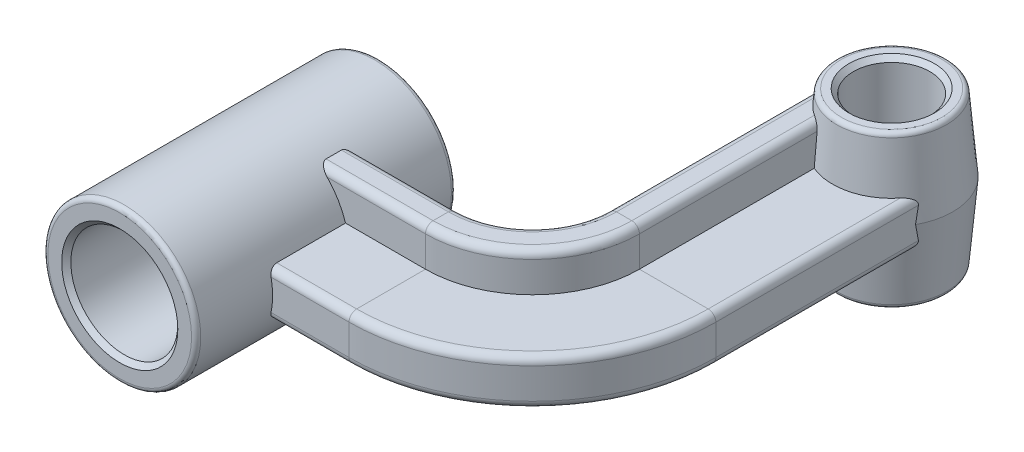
ISO-10303-21;
HEADER;
FILE_DESCRIPTION(('STEP AP214'),'2;1');
FILE_NAME('part.step','',(''),(''),'','','');
FILE_SCHEMA(('AUTOMOTIVE_DESIGN { 1 0 10303 214 1 1 1 1 }'));
ENDSEC;
DATA;
#1=APPLICATION_CONTEXT('core data for automotive mechanical design processes');
#2=APPLICATION_PROTOCOL_DEFINITION('international standard','automotive_design',2000,#1);
#3=PRODUCT_CONTEXT('',#1,'mechanical');
#4=PRODUCT('Part','Part','',(#3));
#5=PRODUCT_RELATED_PRODUCT_CATEGORY('part','',(#4));
#6=PRODUCT_DEFINITION_FORMATION('','',#4);
#7=PRODUCT_DEFINITION_CONTEXT('part definition',#1,'design');
#8=PRODUCT_DEFINITION('design','',#6,#7);
#9=PRODUCT_DEFINITION_SHAPE('','',#8);
#10=(LENGTH_UNIT() NAMED_UNIT(*) SI_UNIT(.MILLI.,.METRE.));
#11=(NAMED_UNIT(*) PLANE_ANGLE_UNIT() SI_UNIT($,.RADIAN.));
#12=(NAMED_UNIT(*) SI_UNIT($,.STERADIAN.) SOLID_ANGLE_UNIT());
#13=UNCERTAINTY_MEASURE_WITH_UNIT(LENGTH_MEASURE(1.E-05),#10,'distance_accuracy_value','');
#14=(GEOMETRIC_REPRESENTATION_CONTEXT(3) GLOBAL_UNCERTAINTY_ASSIGNED_CONTEXT((#13)) GLOBAL_UNIT_ASSIGNED_CONTEXT((#10,
#11,#12)) REPRESENTATION_CONTEXT('',''));
#15=CARTESIAN_POINT('',(0.,0.,0.));
#16=DIRECTION('',(0.,0.,1.));
#17=DIRECTION('',(1.,0.,0.));
#18=AXIS2_PLACEMENT_3D('',#15,#16,#17);
#19=CARTESIAN_POINT('',(215.,10.,-50.0000000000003));
#20=DIRECTION('',(0.,0.,-1.));
#21=DIRECTION('',(-1.,0.,0.));
#22=AXIS2_PLACEMENT_3D('',#19,#20,#21);
#23=CYLINDRICAL_SURFACE('',#22,5.);
#24=DIRECTION('',(0.,0.,-1.));
#25=VECTOR('',#24,1.);
#26=CARTESIAN_POINT('',(220.,9.99999999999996,-50.0000000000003));
#27=LINE('',#26,#25);
#28=CARTESIAN_POINT('',(220.,9.99999999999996,-50.0000000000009));
#29=VERTEX_POINT('',#28);
#30=CARTESIAN_POINT('',(220.,9.99999999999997,-182.513591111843));
#31=VERTEX_POINT('',#30);
#32=EDGE_CURVE('E1424',#29,#31,#27,.T.);
#33=ORIENTED_EDGE('',*,*,#32,.T.);
#34=CARTESIAN_POINT('',(219.999999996,9.99980000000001,-182.513551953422));
#35=CARTESIAN_POINT('',(220.000012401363,10.062688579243,-182.525889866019));
#36=CARTESIAN_POINT('',(219.998818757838,10.1260426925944,-182.535910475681));
#37=CARTESIAN_POINT('',(219.993986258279,10.2532301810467,-182.551150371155));
#38=CARTESIAN_POINT('',(219.99034745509,10.3170635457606,-182.556369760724));
#39=CARTESIAN_POINT('',(219.980626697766,10.4443001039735,-182.561821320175));
#40=CARTESIAN_POINT('',(219.974562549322,10.5077030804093,-182.562089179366));
#41=CARTESIAN_POINT('',(219.960044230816,10.6340447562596,-182.557745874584));
#42=CARTESIAN_POINT('',(219.951590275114,10.6969834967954,-182.553135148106));
#43=CARTESIAN_POINT('',(219.922764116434,10.8844896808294,-182.532135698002));
#44=CARTESIAN_POINT('',(219.898923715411,11.0077974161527,-182.508581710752));
#45=CARTESIAN_POINT('',(219.843301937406,11.2480925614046,-182.444717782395));
#46=CARTESIAN_POINT('',(219.811508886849,11.3650703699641,-182.404383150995));
#47=CARTESIAN_POINT('',(219.723094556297,11.6507537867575,-182.285353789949));
#48=CARTESIAN_POINT('',(219.662203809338,11.8143545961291,-182.197638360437));
#49=CARTESIAN_POINT('',(219.529863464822,12.1233986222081,-182.000703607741));
#50=CARTESIAN_POINT('',(219.458380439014,12.2687815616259,-181.891415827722));
#51=CARTESIAN_POINT('',(219.316081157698,12.5280017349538,-181.671376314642));
#52=CARTESIAN_POINT('',(219.246049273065,12.6435500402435,-181.562095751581));
#53=CARTESIAN_POINT('',(219.101143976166,12.8632062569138,-181.335442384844));
#54=CARTESIAN_POINT('',(219.026266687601,12.9673048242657,-181.218063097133));
#55=CARTESIAN_POINT('',(218.872376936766,13.1655109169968,-180.977314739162));
#56=CARTESIAN_POINT('',(218.793356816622,13.2595988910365,-180.853934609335));
#57=CARTESIAN_POINT('',(218.631807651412,13.4386794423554,-180.602899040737));
#58=CARTESIAN_POINT('',(218.549277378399,13.5236687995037,-180.475242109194));
#59=CARTESIAN_POINT('',(218.387329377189,13.679355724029,-180.226386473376));
#60=CARTESIAN_POINT('',(218.308134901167,13.7506457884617,-180.105411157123));
#61=CARTESIAN_POINT('',(218.147259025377,13.8866239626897,-179.861409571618));
#62=CARTESIAN_POINT('',(218.065577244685,13.95131105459,-179.738382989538));
#63=CARTESIAN_POINT('',(217.816939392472,14.136132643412,-179.366858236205));
#64=CARTESIAN_POINT('',(217.646467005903,14.2469553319,-179.116032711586));
#65=CARTESIAN_POINT('',(217.297143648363,14.4456112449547,-178.611221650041));
#66=CARTESIAN_POINT('',(217.118292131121,14.5334429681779,-178.357235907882));
#67=CARTESIAN_POINT('',(216.753007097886,14.6868087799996,-177.848221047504));
#68=CARTESIAN_POINT('',(216.566577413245,14.7523539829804,-177.593192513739));
#69=CARTESIAN_POINT('',(216.155203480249,14.8701707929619,-177.041226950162));
#70=CARTESIAN_POINT('',(215.928999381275,14.9184383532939,-176.744353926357));
#71=CARTESIAN_POINT('',(215.58417084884,14.9671049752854,-176.301859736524));
#72=CARTESIAN_POINT('',(215.468543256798,14.9793704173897,-176.155120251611));
#73=CARTESIAN_POINT('',(215.235476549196,14.9958166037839,-175.862579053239));
#74=CARTESIAN_POINT('',(215.11803703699,14.9999955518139,-175.716777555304));
#75=CARTESIAN_POINT('',(214.9998,14.999999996,-175.571577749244));
#76=B_SPLINE_CURVE_WITH_KNOTS('',3,(#34,#35,#36,#37,#38,#39,#40,#41,#42,#43,#44,#45,#46,#47,#48,
#49,#50,#51,#52,#53,#54,#55,#56,#57,#58,#59,#60,#61,#62,#63,#64,#65,#66,#67,#68,#69,#70,#71,#72,
#73,#74,#75),.UNSPECIFIED.,.F.,.F.,(4,2,2,2,2,2,2,2,2,2,2,2,2,2,2,2,2,2,2,2,4),(0.,
0.192223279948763,0.384442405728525,0.575275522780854,0.766091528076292,1.14757394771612,
1.52961965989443,2.11234617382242,2.69695251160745,3.21753342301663,3.73853607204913,
4.26053828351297,4.78272463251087,5.2661749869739,5.74969975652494,6.71722061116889,
7.68480463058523,8.6519054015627,9.7793920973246,10.3409040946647,10.9025408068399),.UNSPECIFIED.);
#77=CARTESIAN_POINT('',(215.,15.,-175.57182336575));
#78=VERTEX_POINT('',#77);
#79=EDGE_CURVE('E259',#31,#78,#76,.T.);
#80=ORIENTED_EDGE('',*,*,#79,.T.);
#81=DIRECTION('',(0.,0.,-1.));
#82=VECTOR('',#81,1.);
#83=CARTESIAN_POINT('',(215.,15.,-50.0000000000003));
#84=LINE('',#83,#82);
#85=CARTESIAN_POINT('',(215.,15.,-50.0000000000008));
#86=VERTEX_POINT('',#85);
#87=EDGE_CURVE('E1441',#86,#78,#84,.T.);
#88=ORIENTED_EDGE('',*,*,#87,.F.);
#89=CARTESIAN_POINT('',(215.,10.,-50.0000000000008));
#90=DIRECTION('',(0.,0.,-1.));
#91=DIRECTION('',(-1.,0.,0.));
#92=AXIS2_PLACEMENT_3D('',#89,#90,#91);
#93=CIRCLE('',#92,5.);
#94=EDGE_CURVE('E1445',#86,#29,#93,.T.);
#95=ORIENTED_EDGE('',*,*,#94,.T.);
#96=EDGE_LOOP('',(#33,#80,#88,#95));
#97=FACE_BOUND('',#96,.T.);
#98=ADVANCED_FACE('F49',(#97),#23,.T.);
#99=CARTESIAN_POINT('',(155.,35.,-50.0000000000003));
#100=DIRECTION('',(0.,0.,-1.));
#101=DIRECTION('',(-1.,0.,0.));
#102=AXIS2_PLACEMENT_3D('',#99,#100,#101);
#103=CYLINDRICAL_SURFACE('',#102,5.);
#104=DIRECTION('',(0.,0.,-1.));
#105=VECTOR('',#104,1.);
#106=CARTESIAN_POINT('',(155.,40.,-50.0000000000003));
#107=LINE('',#106,#105);
#108=CARTESIAN_POINT('',(155.,40.,-50.0000000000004));
#109=VERTEX_POINT('',#108);
#110=CARTESIAN_POINT('',(155.,40.,-179.208581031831));
#111=VERTEX_POINT('',#110);
#112=EDGE_CURVE('E1226',#109,#111,#107,.T.);
#113=ORIENTED_EDGE('',*,*,#112,.T.);
#114=CARTESIAN_POINT('',(155.0002,39.999999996,-179.208292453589));
#115=CARTESIAN_POINT('',(154.879630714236,39.9999923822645,-179.3822510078));
#116=CARTESIAN_POINT('',(154.760279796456,39.9956488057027,-179.557030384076));
#117=CARTESIAN_POINT('',(154.524227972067,39.9787218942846,-179.907937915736));
#118=CARTESIAN_POINT('',(154.407526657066,39.9661398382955,-180.084065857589));
#119=CARTESIAN_POINT('',(154.176964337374,39.9331699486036,-180.437409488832));
#120=CARTESIAN_POINT('',(154.063102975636,39.9127831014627,-180.614625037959));
#121=CARTESIAN_POINT('',(153.83834894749,39.8645425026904,-180.969916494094));
#122=CARTESIAN_POINT('',(153.727456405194,39.836688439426,-181.147992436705));
#123=CARTESIAN_POINT('',(153.399133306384,39.7422766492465,-181.68360694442));
#124=CARTESIAN_POINT('',(153.186321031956,39.6649082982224,-182.042127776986));
#125=CARTESIAN_POINT('',(152.773780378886,39.482726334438,-182.759618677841));
#126=CARTESIAN_POINT('',(152.574049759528,39.3779174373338,-183.118588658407));
#127=CARTESIAN_POINT('',(152.269504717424,39.1906451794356,-183.68352778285));
#128=CARTESIAN_POINT('',(152.160189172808,39.1174030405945,-183.890167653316));
#129=CARTESIAN_POINT('',(151.946141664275,38.9612517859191,-184.302170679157));
#130=CARTESIAN_POINT('',(151.84140941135,38.878343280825,-184.507533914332));
#131=CARTESIAN_POINT('',(151.636599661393,38.7021339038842,-184.91620526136));
#132=CARTESIAN_POINT('',(151.536523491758,38.6088300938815,-185.119512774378));
#133=CARTESIAN_POINT('',(151.341218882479,38.4106746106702,-185.522791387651));
#134=CARTESIAN_POINT('',(151.245989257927,38.3058257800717,-185.722763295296));
#135=CARTESIAN_POINT('',(151.095663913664,38.1247851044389,-186.042889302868));
#136=CARTESIAN_POINT('',(151.038999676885,38.052734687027,-186.164652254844));
#137=CARTESIAN_POINT('',(150.927767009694,37.9026966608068,-186.405435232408));
#138=CARTESIAN_POINT('',(150.873198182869,37.8247101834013,-186.524455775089));
#139=CARTESIAN_POINT('',(150.766419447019,37.6620016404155,-186.75856551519));
#140=CARTESIAN_POINT('',(150.71420545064,37.5772920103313,-186.873661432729));
#141=CARTESIAN_POINT('',(150.612349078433,37.3997898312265,-187.098590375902));
#142=CARTESIAN_POINT('',(150.562705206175,37.307002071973,-187.208426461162));
#143=CARTESIAN_POINT('',(150.466663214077,37.1120214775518,-187.420104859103));
#144=CARTESIAN_POINT('',(150.420252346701,37.0098697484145,-187.521978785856));
#145=CARTESIAN_POINT('',(150.331315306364,36.7936153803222,-187.714496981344));
#146=CARTESIAN_POINT('',(150.288789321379,36.6795121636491,-187.805140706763));
#147=CARTESIAN_POINT('',(150.217879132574,36.4633234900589,-187.951106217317));
#148=CARTESIAN_POINT('',(150.188420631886,36.3639324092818,-188.009831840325));
#149=CARTESIAN_POINT('',(150.134349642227,36.1562313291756,-188.11155797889));
#150=CARTESIAN_POINT('',(150.109723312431,36.0479481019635,-188.154603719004));
#151=CARTESIAN_POINT('',(150.071758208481,35.8487151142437,-188.212420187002));
#152=CARTESIAN_POINT('',(150.057127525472,35.759233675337,-188.231340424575));
#153=CARTESIAN_POINT('',(150.032641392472,35.5776731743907,-188.254312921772));
#154=CARTESIAN_POINT('',(150.022784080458,35.4855951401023,-188.258370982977));
#155=CARTESIAN_POINT('',(150.010276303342,35.3272752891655,-188.252106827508));
#156=CARTESIAN_POINT('',(150.006385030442,35.2609542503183,-188.245462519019));
#157=CARTESIAN_POINT('',(150.001235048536,35.1293578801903,-188.224654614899));
#158=CARTESIAN_POINT('',(149.999977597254,35.0640830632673,-188.210487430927));
#159=CARTESIAN_POINT('',(150.000000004,34.9998,-188.192819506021));
#160=B_SPLINE_CURVE_WITH_KNOTS('',3,(#114,#115,#116,#117,#118,#119,#120,#121,#122,#123,#124,
#125,#126,#127,#128,#129,#130,#131,#132,#133,#134,#135,#136,#137,#138,#139,#140,#141,#142,#143,
#144,#145,#146,#147,#148,#149,#150,#151,#152,#153,#154,#155,#156,#157,#158,#159),.UNSPECIFIED.,
.F.,.F.,(4,2,2,2,2,2,2,2,2,2,2,2,2,2,2,2,2,2,2,2,2,2,4),(0.,0.634891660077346,1.26968478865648,
1.90439770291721,2.53913711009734,3.81006540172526,5.08077542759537,5.81551017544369,
6.55019852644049,7.28509506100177,8.01981105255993,8.47691261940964,8.93392728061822,
9.39011548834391,9.84603502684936,10.3000411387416,10.754069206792,11.1104350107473,
11.4657646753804,11.7424460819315,12.0190194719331,12.2188465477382,12.4187690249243),.UNSPECIFIED.);
#161=CARTESIAN_POINT('',(150.,35.,-188.192874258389));
#162=VERTEX_POINT('',#161);
#163=EDGE_CURVE('E547',#111,#162,#160,.T.);
#164=ORIENTED_EDGE('',*,*,#163,.T.);
#165=DIRECTION('',(0.,0.,-1.));
#166=VECTOR('',#165,1.);
#167=CARTESIAN_POINT('',(150.,35.,-50.0000000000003));
#168=LINE('',#167,#166);
#169=CARTESIAN_POINT('',(150.,35.,-50.0000000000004));
#170=VERTEX_POINT('',#169);
#171=EDGE_CURVE('E1183',#170,#162,#168,.T.);
#172=ORIENTED_EDGE('',*,*,#171,.F.);
#173=CARTESIAN_POINT('',(155.,35.,-50.0000000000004));
#174=DIRECTION('',(0.,0.,-1.));
#175=DIRECTION('',(1.,0.,0.));
#176=AXIS2_PLACEMENT_3D('',#173,#174,#175);
#177=CIRCLE('',#176,5.);
#178=EDGE_CURVE('E1222',#170,#109,#177,.T.);
#179=ORIENTED_EDGE('',*,*,#178,.T.);
#180=EDGE_LOOP('',(#113,#164,#172,#179));
#181=FACE_BOUND('',#180,.T.);
#182=ADVANCED_FACE('F493',(#181),#103,.T.);
#183=CARTESIAN_POINT('',(165.,35.,-50.0000000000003));
#184=DIRECTION('',(0.,0.,-1.));
#185=DIRECTION('',(-1.,0.,0.));
#186=AXIS2_PLACEMENT_3D('',#183,#184,#185);
#187=CYLINDRICAL_SURFACE('',#186,5.);
#188=DIRECTION('',(0.,0.,-1.));
#189=VECTOR('',#188,1.);
#190=CARTESIAN_POINT('',(170.,35.,-50.0000000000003));
#191=LINE('',#190,#189);
#192=CARTESIAN_POINT('',(170.,35.,-50.0000000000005));
#193=VERTEX_POINT('',#192);
#194=CARTESIAN_POINT('',(170.,35.,-166.244878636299));
#195=VERTEX_POINT('',#194);
#196=EDGE_CURVE('E1264',#193,#195,#191,.T.);
#197=ORIENTED_EDGE('',*,*,#196,.T.);
#198=CARTESIAN_POINT('',(169.999999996,34.9997999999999,-166.24485949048));
#199=CARTESIAN_POINT('',(170.000026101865,35.1351383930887,-166.257811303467));
#200=CARTESIAN_POINT('',(169.99451699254,35.2702286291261,-166.273187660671));
#201=CARTESIAN_POINT('',(169.972697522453,35.5388664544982,-166.308633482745));
#202=CARTESIAN_POINT('',(169.956390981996,35.6724145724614,-166.328701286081));
#203=CARTESIAN_POINT('',(169.913321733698,35.9365512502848,-166.373304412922));
#204=CARTESIAN_POINT('',(169.886596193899,36.0671486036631,-166.397823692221));
#205=CARTESIAN_POINT('',(169.823079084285,36.3249646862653,-166.451219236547));
#206=CARTESIAN_POINT('',(169.786286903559,36.4521832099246,-166.480095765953));
#207=CARTESIAN_POINT('',(169.703162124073,36.7022354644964,-166.54200159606));
#208=CARTESIAN_POINT('',(169.656841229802,36.825074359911,-166.575025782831));
#209=CARTESIAN_POINT('',(169.555161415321,37.0658133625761,-166.645096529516));
#210=CARTESIAN_POINT('',(169.499799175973,37.183711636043,-166.682144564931));
#211=CARTESIAN_POINT('',(169.380641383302,37.4138720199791,-166.760086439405));
#212=CARTESIAN_POINT('',(169.316843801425,37.5261327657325,-166.80098120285));
#213=CARTESIAN_POINT('',(169.181455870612,37.7444367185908,-166.886441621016));
#214=CARTESIAN_POINT('',(169.109862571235,37.8504775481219,-166.931008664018));
#215=CARTESIAN_POINT('',(168.955882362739,38.0608503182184,-167.025896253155));
#216=CARTESIAN_POINT('',(168.873137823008,38.1648418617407,-167.076391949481));
#217=CARTESIAN_POINT('',(168.700643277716,38.3649238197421,-167.180988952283));
#218=CARTESIAN_POINT('',(168.610890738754,38.4610113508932,-167.235091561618));
#219=CARTESIAN_POINT('',(168.332399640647,38.736741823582,-167.402438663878));
#220=CARTESIAN_POINT('',(168.134295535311,38.9040308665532,-167.52080290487));
#221=CARTESIAN_POINT('',(167.699760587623,39.2178172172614,-167.781138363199));
#222=CARTESIAN_POINT('',(167.461475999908,39.3607408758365,-167.924285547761));
#223=CARTESIAN_POINT('',(166.97040478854,39.603545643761,-168.222138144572));
#224=CARTESIAN_POINT('',(166.717603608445,39.7033826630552,-168.376855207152));
#225=CARTESIAN_POINT('',(166.220596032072,39.8552399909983,-168.68511851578));
#226=CARTESIAN_POINT('',(165.976848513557,39.9098719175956,-168.838126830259));
#227=CARTESIAN_POINT('',(165.610308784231,39.9641465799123,-169.071485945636));
#228=CARTESIAN_POINT('',(165.48812009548,39.9776262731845,-169.149819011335));
#229=CARTESIAN_POINT('',(165.243806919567,39.9955518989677,-169.307565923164));
#230=CARTESIAN_POINT('',(165.121682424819,39.999999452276,-169.38697957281));
#231=CARTESIAN_POINT('',(164.9998,39.999999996,-169.466819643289));
#232=B_SPLINE_CURVE_WITH_KNOTS('',3,(#198,#199,#200,#201,#202,#203,#204,#205,#206,#207,#208,
#209,#210,#211,#212,#213,#214,#215,#216,#217,#218,#219,#220,#221,#222,#223,#224,#225,#226,#227,
#228,#229,#230,#231),.UNSPECIFIED.,.F.,.F.,(4,2,2,2,2,2,2,2,2,2,2,2,2,2,2,2,4),(0.,
0.40771261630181,0.815281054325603,1.22140867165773,1.62756094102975,2.03321726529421,
2.43902284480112,2.84492619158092,3.25098369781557,3.67700695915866,4.10318494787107,
4.9548406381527,5.88883199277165,6.82377683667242,7.69994167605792,8.13699688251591,
8.5739736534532),.UNSPECIFIED.);
#233=CARTESIAN_POINT('',(165.,40.,-169.46668863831));
#234=VERTEX_POINT('',#233);
#235=EDGE_CURVE('E66',#195,#234,#232,.T.);
#236=ORIENTED_EDGE('',*,*,#235,.T.);
#237=DIRECTION('',(0.,0.,-1.));
#238=VECTOR('',#237,1.);
#239=CARTESIAN_POINT('',(165.,40.,-50.0000000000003));
#240=LINE('',#239,#238);
#241=CARTESIAN_POINT('',(165.,40.,-50.0000000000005));
#242=VERTEX_POINT('',#241);
#243=EDGE_CURVE('E1245',#242,#234,#240,.T.);
#244=ORIENTED_EDGE('',*,*,#243,.F.);
#245=CARTESIAN_POINT('',(165.,35.,-50.0000000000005));
#246=DIRECTION('',(0.,0.,-1.));
#247=DIRECTION('',(-1.,0.,0.));
#248=AXIS2_PLACEMENT_3D('',#245,#246,#247);
#249=CIRCLE('',#248,5.);
#250=EDGE_CURVE('E1260',#242,#193,#249,.T.);
#251=ORIENTED_EDGE('',*,*,#250,.T.);
#252=EDGE_LOOP('',(#197,#236,#244,#251));
#253=FACE_BOUND('',#252,.T.);
#254=ADVANCED_FACE('F500',(#253),#187,.T.);
#255=CARTESIAN_POINT('',(170.,15.,-50.0000000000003));
#256=DIRECTION('',(1.,0.,0.));
#257=DIRECTION('',(0.,1.,0.));
#258=AXIS2_PLACEMENT_3D('',#255,#256,#257);
#259=PLANE('',#258);
#260=DIRECTION('',(0.,0.,-1.));
#261=VECTOR('',#260,1.);
#262=CARTESIAN_POINT('',(170.,15.,-50.0000000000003));
#263=LINE('',#262,#261);
#264=CARTESIAN_POINT('',(170.,15.,-50.0000000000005));
#265=VERTEX_POINT('',#264);
#266=CARTESIAN_POINT('',(170.,15.,-164.338594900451));
#267=VERTEX_POINT('',#266);
#268=EDGE_CURVE('E1290',#265,#267,#263,.T.);
#269=ORIENTED_EDGE('',*,*,#268,.T.);
#270=CARTESIAN_POINT('',(170.,-29.7215595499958,-160.127885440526));
#271=CARTESIAN_POINT('',(170.,-23.2190455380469,-160.735727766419));
#272=CARTESIAN_POINT('',(170.,-16.71668720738,-161.345239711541));
#273=CARTESIAN_POINT('',(170.,-3.712339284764,-162.56820571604));
#274=CARTESIAN_POINT('',(170.,2.78965030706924,-163.181659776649));
#275=CARTESIAN_POINT('',(170.,15.7931849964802,-164.4131111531));
#276=CARTESIAN_POINT('',(170.,22.2947300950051,-165.031108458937));
#277=CARTESIAN_POINT('',(170.,35.2973111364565,-166.272429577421));
#278=CARTESIAN_POINT('',(170.,41.798347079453,-166.895753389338));
#279=CARTESIAN_POINT('',(170.,53.5365963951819,-168.026954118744));
#280=CARTESIAN_POINT('',(170.,58.7739160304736,-168.533727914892));
#281=CARTESIAN_POINT('',(170.,69.2480985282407,-169.552019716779));
#282=CARTESIAN_POINT('',(170.,74.4849613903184,-170.063537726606));
#283=CARTESIAN_POINT('',(170.,79.7215595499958,-170.577758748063));
#284=B_SPLINE_CURVE_WITH_KNOTS('',3,(#270,#271,#272,#273,#274,#275,#276,#277,#278,#279,#280,
#281,#282,#283),.UNSPECIFIED.,.F.,.F.,(4,2,2,2,2,2,4),(0.,19.5925868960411,39.1851799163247,
58.7777298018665,78.370276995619,94.1556172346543,109.940971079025),.UNSPECIFIED.);
#285=EDGE_CURVE('E529',#267,#195,#284,.T.);
#286=ORIENTED_EDGE('',*,*,#285,.T.);
#287=ORIENTED_EDGE('',*,*,#196,.F.);
#288=DIRECTION('',(0.,-1.,0.));
#289=VECTOR('',#288,1.);
#290=CARTESIAN_POINT('',(170.,15.,-50.0000000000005));
#291=LINE('',#290,#289);
#292=EDGE_CURVE('E1279',#193,#265,#291,.T.);
#293=ORIENTED_EDGE('',*,*,#292,.T.);
#294=EDGE_LOOP('',(#269,#286,#287,#293));
#295=FACE_BOUND('',#294,.T.);
#296=ADVANCED_FACE('F409',(#295),#259,.T.);
#297=CARTESIAN_POINT('',(0.,0.,-50.));
#298=DIRECTION('',(0.,0.,1.));
#299=DIRECTION('',(1.,0.,0.));
#300=AXIS2_PLACEMENT_3D('',#297,#298,#299);
#301=CYLINDRICAL_SURFACE('',#300,50.);
#302=CARTESIAN_POINT('',(0.,0.,-47.));
#303=DIRECTION('',(0.,0.,1.));
#304=DIRECTION('',(1.,0.,0.));
#305=AXIS2_PLACEMENT_3D('',#302,#303,#304);
#306=CIRCLE('',#305,50.);
#307=CARTESIAN_POINT('',(50.,0.,-47.));
#308=VERTEX_POINT('',#307);
#309=EDGE_CURVE('E640',#308,#308,#306,.T.);
#310=ORIENTED_EDGE('',*,*,#309,.T.);
#311=EDGE_LOOP('',(#310));
#312=FACE_BOUND('',#311,.T.);
#313=CARTESIAN_POINT('',(0.,0.,117.));
#314=DIRECTION('',(0.,0.,1.));
#315=DIRECTION('',(1.,0.,0.));
#316=AXIS2_PLACEMENT_3D('',#313,#314,#315);
#317=CIRCLE('',#316,50.);
#318=CARTESIAN_POINT('',(50.,0.,117.));
#319=VERTEX_POINT('',#318);
#320=EDGE_CURVE('E702',#319,#319,#317,.F.);
#321=ORIENTED_EDGE('',*,*,#320,.T.);
#322=EDGE_LOOP('',(#321));
#323=FACE_BOUND('',#322,.T.);
#324=DIRECTION('',(0.,0.,1.));
#325=VECTOR('',#324,1.);
#326=CARTESIAN_POINT('',(47.6969600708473,15.,-50.));
#327=LINE('',#326,#325);
#328=CARTESIAN_POINT('',(47.6969600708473,15.,20.));
#329=VERTEX_POINT('',#328);
#330=CARTESIAN_POINT('',(47.6969600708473,15.,65.));
#331=VERTEX_POINT('',#330);
#332=EDGE_CURVE('E1480',#329,#331,#327,.T.);
#333=ORIENTED_EDGE('',*,*,#332,.F.);
#334=CARTESIAN_POINT('',(0.,0.,20.));
#335=DIRECTION('',(0.,0.,1.));
#336=DIRECTION('',(0.,-1.,0.));
#337=AXIS2_PLACEMENT_3D('',#334,#335,#336);
#338=CIRCLE('',#337,50.);
#339=CARTESIAN_POINT('',(35.7071421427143,35.,20.));
#340=VERTEX_POINT('',#339);
#341=EDGE_CURVE('E1283',#340,#329,#338,.F.);
#342=ORIENTED_EDGE('',*,*,#341,.F.);
#343=CARTESIAN_POINT('',(30.,40.,15.));
#344=CARTESIAN_POINT('',(29.9999494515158,40.0000334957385,15.104514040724));
#345=CARTESIAN_POINT('',(30.0043673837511,39.9967244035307,15.2089911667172));
#346=CARTESIAN_POINT('',(30.0217469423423,39.9836831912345,15.416680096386));
#347=CARTESIAN_POINT('',(30.034696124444,39.9739604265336,15.5198935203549));
#348=CARTESIAN_POINT('',(30.0685303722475,39.9485155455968,15.7228742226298));
#349=CARTESIAN_POINT('',(30.089312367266,39.9328713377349,15.8226686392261));
#350=CARTESIAN_POINT('',(30.1381772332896,39.8960049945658,16.019392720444));
#351=CARTESIAN_POINT('',(30.1662622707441,39.8747812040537,16.1163215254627));
#352=CARTESIAN_POINT('',(30.2600185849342,39.8037358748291,16.4007454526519));
#353=CARTESIAN_POINT('',(30.3354317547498,39.7463610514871,16.5832262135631));
#354=CARTESIAN_POINT('',(30.5064847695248,39.6152240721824,16.9325561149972));
#355=CARTESIAN_POINT('',(30.6021962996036,39.5414037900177,17.099346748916));
#356=CARTESIAN_POINT('',(30.7878868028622,39.3969161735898,17.3848147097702));
#357=CARTESIAN_POINT('',(30.8751950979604,39.3285619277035,17.5064495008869));
#358=CARTESIAN_POINT('',(31.0573374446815,39.1848854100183,17.7396170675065));
#359=CARTESIAN_POINT('',(31.152175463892,39.109559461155,17.8511444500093));
#360=CARTESIAN_POINT('',(31.3478474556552,38.9528971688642,18.0646642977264));
#361=CARTESIAN_POINT('',(31.4486913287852,38.8715508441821,18.1666402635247));
#362=CARTESIAN_POINT('',(31.6549699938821,38.7037540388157,18.3613575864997));
#363=CARTESIAN_POINT('',(31.7604062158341,38.6173019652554,18.4540960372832));
#364=CARTESIAN_POINT('',(32.0295385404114,38.3946966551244,18.6758386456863));
#365=CARTESIAN_POINT('',(32.195522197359,38.2556828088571,18.7992158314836));
#366=CARTESIAN_POINT('',(32.5329953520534,37.9691098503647,19.0271470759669));
#367=CARTESIAN_POINT('',(32.7044876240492,37.821546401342,19.1316914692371));
#368=CARTESIAN_POINT('',(33.0511346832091,37.5190013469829,19.3228073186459));
#369=CARTESIAN_POINT('',(33.2262920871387,37.3640143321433,19.4093654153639));
#370=CARTESIAN_POINT('',(33.5786073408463,37.047714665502,19.5648558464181));
#371=CARTESIAN_POINT('',(33.7557647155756,36.8864034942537,19.6337922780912));
#372=CARTESIAN_POINT('',(34.0820309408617,36.5849175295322,19.7444132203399));
#373=CARTESIAN_POINT('',(34.2310227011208,36.4455644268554,19.7887053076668));
#374=CARTESIAN_POINT('',(34.5289195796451,36.1634593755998,19.8649465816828));
#375=CARTESIAN_POINT('',(34.677824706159,36.020707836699,19.8968972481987));
#376=CARTESIAN_POINT('',(34.9742273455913,35.7329795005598,19.9481309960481));
#377=CARTESIAN_POINT('',(35.1217281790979,35.5880171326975,19.9674757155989));
#378=CARTESIAN_POINT('',(35.415505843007,35.2956806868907,19.9934016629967));
#379=CARTESIAN_POINT('',(35.5617824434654,35.1483061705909,19.9999805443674));
#380=CARTESIAN_POINT('',(35.7071421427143,35.,20.));
#381=B_SPLINE_CURVE_WITH_KNOTS('',3,(#343,#344,#345,#346,#347,#348,#349,#350,#351,#352,#353,
#354,#355,#356,#357,#358,#359,#360,#361,#362,#363,#364,#365,#366,#367,#368,#369,#370,#371,#372,
#373,#374,#375,#376,#377,#378,#379,#380),.UNSPECIFIED.,.F.,.F.,(4,2,2,2,2,2,2,2,2,2,2,2,2,2,2,2,
2,2,4),(0.,0.313337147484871,0.626218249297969,0.935118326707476,1.24411014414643,
1.85801026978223,2.47411564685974,2.96721350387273,3.46057293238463,3.95476946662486,
4.44912100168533,5.19560208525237,5.9424651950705,6.68988107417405,7.43712300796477,
8.0630162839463,8.68883448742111,9.31156925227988,9.9344184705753),.UNSPECIFIED.);
#382=CARTESIAN_POINT('',(30.,40.,15.));
#383=VERTEX_POINT('',#382);
#384=EDGE_CURVE('E417',#383,#340,#381,.T.);
#385=ORIENTED_EDGE('',*,*,#384,.F.);
#386=DIRECTION('',(0.,0.,1.));
#387=VECTOR('',#386,1.);
#388=CARTESIAN_POINT('',(30.,40.,-50.));
#389=LINE('',#388,#387);
#390=CARTESIAN_POINT('',(30.,40.,5.00000000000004));
#391=VERTEX_POINT('',#390);
#392=EDGE_CURVE('E1297',#391,#383,#389,.T.);
#393=ORIENTED_EDGE('',*,*,#392,.F.);
#394=CARTESIAN_POINT('',(35.7071421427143,35.,0.));
#395=CARTESIAN_POINT('',(35.6088364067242,35.1002930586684,4.27088183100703E-06));
#396=CARTESIAN_POINT('',(35.5101221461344,35.2001550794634,0.00301734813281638));
#397=CARTESIAN_POINT('',(35.3120426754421,35.3988602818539,0.0149397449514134));
#398=CARTESIAN_POINT('',(35.2126775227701,35.4977035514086,0.0238485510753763));
#399=CARTESIAN_POINT('',(34.9138056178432,35.7925193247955,0.0592401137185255));
#400=CARTESIAN_POINT('',(34.7135455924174,35.9867541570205,0.0943879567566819));
#401=CARTESIAN_POINT('',(34.3108079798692,36.3709587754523,0.187526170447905));
#402=CARTESIAN_POINT('',(34.1083264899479,36.5608753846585,0.245716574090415));
#403=CARTESIAN_POINT('',(33.7045020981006,36.9334800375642,0.384679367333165));
#404=CARTESIAN_POINT('',(33.5031589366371,37.1161697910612,0.465446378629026));
#405=CARTESIAN_POINT('',(33.145547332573,37.4355109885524,0.630397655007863));
#406=CARTESIAN_POINT('',(32.9887115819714,37.5737589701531,0.710284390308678));
#407=CARTESIAN_POINT('',(32.6780357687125,37.8442646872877,0.884656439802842));
#408=CARTESIAN_POINT('',(32.5241951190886,37.9765236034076,0.979138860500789));
#409=CARTESIAN_POINT('',(32.2213237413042,38.2338286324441,1.18303457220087));
#410=CARTESIAN_POINT('',(32.0722804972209,38.3588943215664,1.29240431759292));
#411=CARTESIAN_POINT('',(31.7804723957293,38.601003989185,1.52707929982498));
#412=CARTESIAN_POINT('',(31.6377043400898,38.7180520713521,1.65237628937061));
#413=CARTESIAN_POINT('',(31.3305491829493,38.9672136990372,1.94932996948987));
#414=CARTESIAN_POINT('',(31.1682473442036,39.097037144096,2.12513574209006));
#415=CARTESIAN_POINT('',(30.8630597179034,39.3383945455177,2.50425048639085));
#416=CARTESIAN_POINT('',(30.7201557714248,39.4499456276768,2.7075333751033));
#417=CARTESIAN_POINT('',(30.4933362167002,39.6253966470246,3.09230728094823));
#418=CARTESIAN_POINT('',(30.4034322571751,39.6943445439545,3.26786079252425));
#419=CARTESIAN_POINT('',(30.2860202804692,39.783908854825,3.54277841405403));
#420=CARTESIAN_POINT('',(30.2498207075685,39.8114312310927,3.63623912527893));
#421=CARTESIAN_POINT('',(30.1839572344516,39.8613902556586,3.82673022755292));
#422=CARTESIAN_POINT('',(30.1542893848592,39.8838299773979,3.92375841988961));
#423=CARTESIAN_POINT('',(30.1075563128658,39.9191148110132,4.10071827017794));
#424=CARTESIAN_POINT('',(30.0891547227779,39.9329834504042,4.18009563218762));
#425=CARTESIAN_POINT('',(30.0573045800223,39.9569623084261,4.34038657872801));
#426=CARTESIAN_POINT('',(30.0438547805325,39.9670734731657,4.42129977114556));
#427=CARTESIAN_POINT('',(30.0221007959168,39.9834173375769,4.5848527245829));
#428=CARTESIAN_POINT('',(30.013837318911,39.9896193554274,4.66750100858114));
#429=CARTESIAN_POINT('',(30.0027741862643,39.9979193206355,4.8334285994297));
#430=CARTESIAN_POINT('',(29.9999786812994,40.0000141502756,4.91670833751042));
#431=CARTESIAN_POINT('',(30.,40.,5.00000000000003));
#432=B_SPLINE_CURVE_WITH_KNOTS('',3,(#394,#395,#396,#397,#398,#399,#400,#401,#402,#403,#404,
#405,#406,#407,#408,#409,#410,#411,#412,#413,#414,#415,#416,#417,#418,#419,#420,#421,#422,#423,
#424,#425,#426,#427,#428,#429,#430,#431),.UNSPECIFIED.,.F.,.F.,(4,2,2,2,2,2,2,2,2,2,2,2,2,2,2,2,
2,2,4),(0.,0.421238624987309,0.842440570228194,1.6849434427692,2.53492633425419,
3.38470691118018,4.05562249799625,4.72640525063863,5.39526650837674,6.06378282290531,
6.87825438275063,7.69195815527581,8.31630356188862,8.62778817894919,8.93908393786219,
9.18681916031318,9.43449196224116,9.68408523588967,9.93386789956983),.UNSPECIFIED.);
#433=CARTESIAN_POINT('',(35.7071421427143,35.,0.));
#434=VERTEX_POINT('',#433);
#435=EDGE_CURVE('E429',#434,#391,#432,.T.);
#436=ORIENTED_EDGE('',*,*,#435,.F.);
#437=CARTESIAN_POINT('',(0.,0.,0.));
#438=DIRECTION('',(0.,0.,-1.));
#439=DIRECTION('',(-1.,0.,0.));
#440=AXIS2_PLACEMENT_3D('',#437,#438,#439);
#441=CIRCLE('',#440,50.);
#442=CARTESIAN_POINT('',(35.7071421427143,-35.,0.));
#443=VERTEX_POINT('',#442);
#444=EDGE_CURVE('E1304',#443,#434,#441,.F.);
#445=ORIENTED_EDGE('',*,*,#444,.F.);
#446=CARTESIAN_POINT('',(30.,-40.,5.00000000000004));
#447=CARTESIAN_POINT('',(29.9999494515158,-40.0000334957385,4.89548595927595));
#448=CARTESIAN_POINT('',(30.0043673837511,-39.9967244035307,4.7910088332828));
#449=CARTESIAN_POINT('',(30.0217469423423,-39.9836831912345,4.58331990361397));
#450=CARTESIAN_POINT('',(30.0346961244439,-39.9739604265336,4.48010647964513));
#451=CARTESIAN_POINT('',(30.0685303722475,-39.9485155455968,4.27712577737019));
#452=CARTESIAN_POINT('',(30.089312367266,-39.9328713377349,4.17733136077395));
#453=CARTESIAN_POINT('',(30.1381772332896,-39.8960049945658,3.98060727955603));
#454=CARTESIAN_POINT('',(30.1662622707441,-39.8747812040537,3.88367847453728));
#455=CARTESIAN_POINT('',(30.2600185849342,-39.8037358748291,3.59925454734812));
#456=CARTESIAN_POINT('',(30.3354317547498,-39.7463610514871,3.41677378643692));
#457=CARTESIAN_POINT('',(30.5064847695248,-39.6152240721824,3.06744388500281));
#458=CARTESIAN_POINT('',(30.6021962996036,-39.5414037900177,2.90065325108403));
#459=CARTESIAN_POINT('',(30.7878868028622,-39.3969161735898,2.6151852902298));
#460=CARTESIAN_POINT('',(30.8751950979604,-39.3285619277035,2.49355049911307));
#461=CARTESIAN_POINT('',(31.0573374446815,-39.1848854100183,2.26038293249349));
#462=CARTESIAN_POINT('',(31.152175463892,-39.109559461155,2.1488555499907));
#463=CARTESIAN_POINT('',(31.3478474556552,-38.9528971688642,1.93533570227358));
#464=CARTESIAN_POINT('',(31.4486913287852,-38.8715508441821,1.83335973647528));
#465=CARTESIAN_POINT('',(31.6549699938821,-38.7037540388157,1.63864241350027));
#466=CARTESIAN_POINT('',(31.7604062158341,-38.6173019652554,1.54590396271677));
#467=CARTESIAN_POINT('',(32.0295385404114,-38.3946966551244,1.32416135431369));
#468=CARTESIAN_POINT('',(32.1955221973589,-38.2556828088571,1.20078416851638));
#469=CARTESIAN_POINT('',(32.5329953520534,-37.9691098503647,0.972852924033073));
#470=CARTESIAN_POINT('',(32.7044876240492,-37.821546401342,0.868308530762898));
#471=CARTESIAN_POINT('',(33.0511346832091,-37.5190013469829,0.67719268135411));
#472=CARTESIAN_POINT('',(33.2262920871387,-37.3640143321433,0.590634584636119));
#473=CARTESIAN_POINT('',(33.5786073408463,-37.0477146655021,0.435144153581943));
#474=CARTESIAN_POINT('',(33.7557647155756,-36.8864034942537,0.36620772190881));
#475=CARTESIAN_POINT('',(34.0820309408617,-36.5849175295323,0.255586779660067));
#476=CARTESIAN_POINT('',(34.2310227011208,-36.4455644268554,0.211294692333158));
#477=CARTESIAN_POINT('',(34.5289195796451,-36.1634593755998,0.135053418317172));
#478=CARTESIAN_POINT('',(34.677824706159,-36.020707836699,0.103102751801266));
#479=CARTESIAN_POINT('',(34.9742273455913,-35.7329795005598,0.0518690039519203));
#480=CARTESIAN_POINT('',(35.1217281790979,-35.5880171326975,0.0325242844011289));
#481=CARTESIAN_POINT('',(35.415505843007,-35.2956806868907,0.00659833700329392));
#482=CARTESIAN_POINT('',(35.5617824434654,-35.1483061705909,1.94556326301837E-05));
#483=CARTESIAN_POINT('',(35.7071421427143,-35.,0.));
#484=B_SPLINE_CURVE_WITH_KNOTS('',3,(#446,#447,#448,#449,#450,#451,#452,#453,#454,#455,#456,
#457,#458,#459,#460,#461,#462,#463,#464,#465,#466,#467,#468,#469,#470,#471,#472,#473,#474,#475,
#476,#477,#478,#479,#480,#481,#482,#483),.UNSPECIFIED.,.F.,.F.,(4,2,2,2,2,2,2,2,2,2,2,2,2,2,2,2,
2,2,4),(0.,0.313337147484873,0.626218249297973,0.935118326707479,1.24411014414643,
1.85801026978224,2.47411564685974,2.96721350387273,3.46057293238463,3.95476946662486,
4.44912100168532,5.19560208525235,5.94246519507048,6.68988107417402,7.43712300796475,
8.06301628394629,8.68883448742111,9.31156925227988,9.9344184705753),.UNSPECIFIED.);
#485=CARTESIAN_POINT('',(30.,-40.,5.00000000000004));
#486=VERTEX_POINT('',#485);
#487=EDGE_CURVE('E437',#486,#443,#484,.T.);
#488=ORIENTED_EDGE('',*,*,#487,.F.);
#489=DIRECTION('',(0.,0.,1.));
#490=VECTOR('',#489,1.);
#491=CARTESIAN_POINT('',(30.,-40.,-50.));
#492=LINE('',#491,#490);
#493=CARTESIAN_POINT('',(30.,-40.,15.));
#494=VERTEX_POINT('',#493);
#495=EDGE_CURVE('E400',#494,#486,#492,.F.);
#496=ORIENTED_EDGE('',*,*,#495,.F.);
#497=CARTESIAN_POINT('',(35.7071421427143,-35.,20.));
#498=CARTESIAN_POINT('',(35.6088364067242,-35.1002930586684,19.9999957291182));
#499=CARTESIAN_POINT('',(35.5101221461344,-35.2001550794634,19.9969826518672));
#500=CARTESIAN_POINT('',(35.3120426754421,-35.3988602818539,19.9850602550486));
#501=CARTESIAN_POINT('',(35.2126775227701,-35.4977035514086,19.9761514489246));
#502=CARTESIAN_POINT('',(34.9138056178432,-35.7925193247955,19.9407598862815));
#503=CARTESIAN_POINT('',(34.7135455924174,-35.9867541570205,19.9056120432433));
#504=CARTESIAN_POINT('',(34.3108079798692,-36.3709587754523,19.8124738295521));
#505=CARTESIAN_POINT('',(34.1083264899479,-36.5608753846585,19.7542834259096));
#506=CARTESIAN_POINT('',(33.7045020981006,-36.9334800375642,19.6153206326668));
#507=CARTESIAN_POINT('',(33.5031589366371,-37.1161697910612,19.534553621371));
#508=CARTESIAN_POINT('',(33.145547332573,-37.4355109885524,19.3696023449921));
#509=CARTESIAN_POINT('',(32.9887115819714,-37.5737589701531,19.2897156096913));
#510=CARTESIAN_POINT('',(32.6780357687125,-37.8442646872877,19.1153435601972));
#511=CARTESIAN_POINT('',(32.5241951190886,-37.9765236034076,19.0208611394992));
#512=CARTESIAN_POINT('',(32.2213237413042,-38.2338286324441,18.8169654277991));
#513=CARTESIAN_POINT('',(32.0722804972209,-38.3588943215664,18.7075956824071));
#514=CARTESIAN_POINT('',(31.7804723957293,-38.601003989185,18.472920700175));
#515=CARTESIAN_POINT('',(31.6377043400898,-38.7180520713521,18.3476237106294));
#516=CARTESIAN_POINT('',(31.3305491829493,-38.9672136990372,18.0506700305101));
#517=CARTESIAN_POINT('',(31.1682473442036,-39.097037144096,17.8748642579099));
#518=CARTESIAN_POINT('',(30.8630597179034,-39.3383945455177,17.4957495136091));
#519=CARTESIAN_POINT('',(30.7201557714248,-39.4499456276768,17.2924666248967));
#520=CARTESIAN_POINT('',(30.4933362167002,-39.6253966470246,16.9076927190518));
#521=CARTESIAN_POINT('',(30.4034322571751,-39.6943445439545,16.7321392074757));
#522=CARTESIAN_POINT('',(30.2860202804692,-39.783908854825,16.457221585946));
#523=CARTESIAN_POINT('',(30.2498207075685,-39.8114312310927,16.3637608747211));
#524=CARTESIAN_POINT('',(30.1839572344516,-39.8613902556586,16.1732697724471));
#525=CARTESIAN_POINT('',(30.1542893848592,-39.8838299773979,16.0762415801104));
#526=CARTESIAN_POINT('',(30.1075563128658,-39.9191148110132,15.8992817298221));
#527=CARTESIAN_POINT('',(30.0891547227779,-39.9329834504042,15.8199043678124));
#528=CARTESIAN_POINT('',(30.0573045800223,-39.9569623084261,15.659613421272));
#529=CARTESIAN_POINT('',(30.0438547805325,-39.9670734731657,15.5787002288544));
#530=CARTESIAN_POINT('',(30.0221007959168,-39.9834173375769,15.4151472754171));
#531=CARTESIAN_POINT('',(30.013837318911,-39.9896193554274,15.3324989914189));
#532=CARTESIAN_POINT('',(30.0027741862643,-39.9979193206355,15.1665714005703));
#533=CARTESIAN_POINT('',(29.9999786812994,-40.0000141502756,15.0832916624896));
#534=CARTESIAN_POINT('',(30.,-40.,15.));
#535=B_SPLINE_CURVE_WITH_KNOTS('',3,(#497,#498,#499,#500,#501,#502,#503,#504,#505,#506,#507,
#508,#509,#510,#511,#512,#513,#514,#515,#516,#517,#518,#519,#520,#521,#522,#523,#524,#525,#526,
#527,#528,#529,#530,#531,#532,#533,#534),.UNSPECIFIED.,.F.,.F.,(4,2,2,2,2,2,2,2,2,2,2,2,2,2,2,2,
2,2,4),(0.,0.421238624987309,0.842440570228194,1.6849434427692,2.53492633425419,
3.38470691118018,4.05562249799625,4.72640525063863,5.39526650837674,6.06378282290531,
6.87825438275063,7.69195815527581,8.31630356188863,8.62778817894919,8.9390839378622,
9.18681916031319,9.43449196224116,9.68408523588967,9.93386789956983),.UNSPECIFIED.);
#536=CARTESIAN_POINT('',(35.7071421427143,-35.,20.));
#537=VERTEX_POINT('',#536);
#538=EDGE_CURVE('E389',#537,#494,#535,.T.);
#539=ORIENTED_EDGE('',*,*,#538,.F.);
#540=CARTESIAN_POINT('',(0.,0.,20.));
#541=DIRECTION('',(0.,0.,1.));
#542=DIRECTION('',(0.,-1.,0.));
#543=AXIS2_PLACEMENT_3D('',#540,#541,#542);
#544=CIRCLE('',#543,50.);
#545=CARTESIAN_POINT('',(45.8257569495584,-20.,20.));
#546=VERTEX_POINT('',#545);
#547=EDGE_CURVE('E399',#546,#537,#544,.F.);
#548=ORIENTED_EDGE('',*,*,#547,.F.);
#549=CARTESIAN_POINT('',(47.6969600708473,-15.,25.));
#550=CARTESIAN_POINT('',(47.696961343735,-14.9999819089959,24.8645396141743));
#551=CARTESIAN_POINT('',(47.6952289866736,-15.0055040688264,24.7290829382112));
#552=CARTESIAN_POINT('',(47.6883063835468,-15.0274974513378,24.4591650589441));
#553=CARTESIAN_POINT('',(47.6831165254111,-15.0439674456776,24.3247037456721));
#554=CARTESIAN_POINT('',(47.6693004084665,-15.0876867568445,24.0579678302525));
#555=CARTESIAN_POINT('',(47.6606801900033,-15.1149171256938,23.9256898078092));
#556=CARTESIAN_POINT('',(47.6400218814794,-15.1799039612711,23.6640192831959));
#557=CARTESIAN_POINT('',(47.6279837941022,-15.2176604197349,23.5346267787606));
#558=CARTESIAN_POINT('',(47.6005171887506,-15.3033585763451,23.2796363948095));
#559=CARTESIAN_POINT('',(47.5850887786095,-15.3512999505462,23.1540383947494));
#560=CARTESIAN_POINT('',(47.5508725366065,-15.4569597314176,22.907445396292));
#561=CARTESIAN_POINT('',(47.5320834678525,-15.5146817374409,22.7864521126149));
#562=CARTESIAN_POINT('',(47.491205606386,-15.6393634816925,22.5499565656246));
#563=CARTESIAN_POINT('',(47.4691178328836,-15.7063203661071,22.4344526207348));
#564=CARTESIAN_POINT('',(47.4216926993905,-15.8489339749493,22.2095908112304));
#565=CARTESIAN_POINT('',(47.3963541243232,-15.9245939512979,22.1002352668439));
#566=CARTESIAN_POINT('',(47.342120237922,-16.0851151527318,21.886840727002));
#567=CARTESIAN_POINT('',(47.3131785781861,-16.1700941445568,21.7829021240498));
#568=CARTESIAN_POINT('',(47.2521253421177,-16.3476440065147,21.582660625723));
#569=CARTESIAN_POINT('',(47.2200126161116,-16.4402176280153,21.4863605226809));
#570=CARTESIAN_POINT('',(47.1527521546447,-16.632146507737,21.3019918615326));
#571=CARTESIAN_POINT('',(47.1176053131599,-16.7314997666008,21.2139208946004));
#572=CARTESIAN_POINT('',(47.044391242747,-16.9362653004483,21.0463891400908));
#573=CARTESIAN_POINT('',(47.0063229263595,-17.0416798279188,20.9669315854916));
#574=CARTESIAN_POINT('',(46.9257407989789,-17.2623640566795,20.8138157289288));
#575=CARTESIAN_POINT('',(46.8831066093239,-17.3778623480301,20.7405495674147));
#576=CARTESIAN_POINT('',(46.7950300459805,-17.6136610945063,20.6040958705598));
#577=CARTESIAN_POINT('',(46.7495866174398,-17.7339633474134,20.540912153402));
#578=CARTESIAN_POINT('',(46.6093325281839,-18.1007825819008,20.3668473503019));
#579=CARTESIAN_POINT('',(46.5105633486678,-18.3533076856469,20.2713868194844));
#580=CARTESIAN_POINT('',(46.3161482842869,-18.8381232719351,20.1310709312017));
#581=CARTESIAN_POINT('',(46.2213956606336,-19.0695044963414,20.0817389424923));
#582=CARTESIAN_POINT('',(46.0755228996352,-19.4180863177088,20.0325934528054));
#583=CARTESIAN_POINT('',(46.0263132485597,-19.5344434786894,20.0203535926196));
#584=CARTESIAN_POINT('',(45.9268067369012,-19.7672578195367,20.0040572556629));
#585=CARTESIAN_POINT('',(45.8765099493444,-19.8837149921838,20.0000002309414));
#586=CARTESIAN_POINT('',(45.8257569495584,-20.,20.));
#587=B_SPLINE_CURVE_WITH_KNOTS('',3,(#549,#550,#551,#552,#553,#554,#555,#556,#557,#558,#559,
#560,#561,#562,#563,#564,#565,#566,#567,#568,#569,#570,#571,#572,#573,#574,#575,#576,#577,#578,
#579,#580,#581,#582,#583,#584,#585,#586),.UNSPECIFIED.,.F.,.F.,(4,2,2,2,2,2,2,2,2,2,2,2,2,2,2,2,
2,2,4),(0.,0.40625205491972,0.812458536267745,1.21795289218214,1.62344692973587,
2.02892807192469,2.43455875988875,2.84006437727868,3.24572200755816,3.65727650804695,
4.06898076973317,4.48056413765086,4.89230145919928,5.32160812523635,5.75107698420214,
6.6096552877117,7.37188733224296,7.75242900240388,8.13294518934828),.UNSPECIFIED.);
#588=CARTESIAN_POINT('',(47.6969600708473,-15.,25.));
#589=VERTEX_POINT('',#588);
#590=EDGE_CURVE('E444',#589,#546,#587,.T.);
#591=ORIENTED_EDGE('',*,*,#590,.F.);
#592=DIRECTION('',(0.,0.,1.));
#593=VECTOR('',#592,1.);
#594=CARTESIAN_POINT('',(47.6969600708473,-15.,-50.));
#595=LINE('',#594,#593);
#596=CARTESIAN_POINT('',(47.6969600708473,-15.,65.));
#597=VERTEX_POINT('',#596);
#598=EDGE_CURVE('E460',#597,#589,#595,.F.);
#599=ORIENTED_EDGE('',*,*,#598,.F.);
#600=CARTESIAN_POINT('',(48.9897948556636,-9.99999999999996,70.));
#601=CARTESIAN_POINT('',(48.9603521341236,-10.1442719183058,70.0000135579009));
#602=CARTESIAN_POINT('',(48.9302611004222,-10.2884035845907,69.9937563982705));
#603=CARTESIAN_POINT('',(48.8690411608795,-10.5753563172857,69.9688697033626));
#604=CARTESIAN_POINT('',(48.8379123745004,-10.7181775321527,69.9502415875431));
#605=CARTESIAN_POINT('',(48.7748910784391,-11.0014127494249,69.9007994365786));
#606=CARTESIAN_POINT('',(48.7429991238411,-11.1418283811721,69.8699940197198));
#607=CARTESIAN_POINT('',(48.6787215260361,-11.4193849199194,69.7964524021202));
#608=CARTESIAN_POINT('',(48.6463358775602,-11.5565257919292,69.7537160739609));
#609=CARTESIAN_POINT('',(48.581387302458,-11.8265844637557,69.6566274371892));
#610=CARTESIAN_POINT('',(48.54882438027,-11.9595023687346,69.6022754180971));
#611=CARTESIAN_POINT('',(48.4838472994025,-12.2202541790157,69.4823068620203));
#612=CARTESIAN_POINT('',(48.4514331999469,-12.3480861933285,69.4166861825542));
#613=CARTESIAN_POINT('',(48.3871375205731,-12.597679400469,69.2746544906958));
#614=CARTESIAN_POINT('',(48.3552557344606,-12.7194429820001,69.1982477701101));
#615=CARTESIAN_POINT('',(48.2923753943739,-12.9561368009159,69.0350865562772));
#616=CARTESIAN_POINT('',(48.2613771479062,-13.0710646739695,68.9483285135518));
#617=CARTESIAN_POINT('',(48.2006100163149,-13.2934006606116,68.76487970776));
#618=CARTESIAN_POINT('',(48.170843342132,-13.4007954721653,68.6681720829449));
#619=CARTESIAN_POINT('',(48.1129929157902,-13.6070344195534,68.4655730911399));
#620=CARTESIAN_POINT('',(48.084909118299,-13.7058787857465,68.3596819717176));
#621=CARTESIAN_POINT('',(48.0308112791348,-13.8942714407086,68.1393730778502));
#622=CARTESIAN_POINT('',(48.0047979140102,-13.9838166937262,68.0249525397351));
#623=CARTESIAN_POINT('',(47.9552507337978,-14.152797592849,67.7884378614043));
#624=CARTESIAN_POINT('',(47.9317159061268,-14.2322373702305,67.6663468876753));
#625=CARTESIAN_POINT('',(47.8880400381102,-14.3785014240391,67.4184530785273));
#626=CARTESIAN_POINT('',(47.8678288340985,-14.4455915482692,67.2928194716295));
#627=CARTESIAN_POINT('',(47.8304342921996,-14.5689295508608,67.0359689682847));
#628=CARTESIAN_POINT('',(47.8132496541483,-14.6251820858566,66.9047544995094));
#629=CARTESIAN_POINT('',(47.7821954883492,-14.7263232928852,66.6377512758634));
#630=CARTESIAN_POINT('',(47.7683233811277,-14.7712208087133,66.5019661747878));
#631=CARTESIAN_POINT('',(47.7441190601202,-14.8492676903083,66.2268066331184));
#632=CARTESIAN_POINT('',(47.7337855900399,-14.8824212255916,66.0874334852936));
#633=CARTESIAN_POINT('',(47.7159290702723,-14.9395839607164,65.7909822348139));
#634=CARTESIAN_POINT('',(47.7088280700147,-14.9622253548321,65.6336127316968));
#635=CARTESIAN_POINT('',(47.699336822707,-14.9924415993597,65.3174948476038));
#636=CARTESIAN_POINT('',(47.696940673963,-15.0000353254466,65.1587484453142));
#637=CARTESIAN_POINT('',(47.6969600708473,-15.,65.));
#638=B_SPLINE_CURVE_WITH_KNOTS('',3,(#600,#601,#602,#603,#604,#605,#606,#607,#608,#609,#610,
#611,#612,#613,#614,#615,#616,#617,#618,#619,#620,#621,#622,#623,#624,#625,#626,#627,#628,#629,
#630,#631,#632,#633,#634,#635,#636,#637),.UNSPECIFIED.,.F.,.F.,(4,2,2,2,2,2,2,2,2,2,2,2,2,2,2,2,
2,2,4),(0.,0.441591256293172,0.883131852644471,1.32436051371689,1.76559388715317,
2.20681626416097,2.64820118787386,3.08941097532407,3.53077249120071,3.97289471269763,
4.41500501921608,4.85725920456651,5.29933200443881,5.73034735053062,6.16117708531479,
6.5916702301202,7.02201038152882,7.49865596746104,7.97470327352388),.UNSPECIFIED.);
#639=CARTESIAN_POINT('',(48.9897948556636,-9.99999999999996,70.));
#640=VERTEX_POINT('',#639);
#641=EDGE_CURVE('E451',#640,#597,#638,.T.);
#642=ORIENTED_EDGE('',*,*,#641,.F.);
#643=CARTESIAN_POINT('',(0.,0.,70.));
#644=DIRECTION('',(0.,0.,1.));
#645=DIRECTION('',(1.,0.,0.));
#646=AXIS2_PLACEMENT_3D('',#643,#644,#645);
#647=CIRCLE('',#646,50.);
#648=CARTESIAN_POINT('',(48.9897948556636,9.99999999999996,70.));
#649=VERTEX_POINT('',#648);
#650=EDGE_CURVE('E459',#649,#640,#647,.F.);
#651=ORIENTED_EDGE('',*,*,#650,.F.);
#652=CARTESIAN_POINT('',(47.6969600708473,15.,65.));
#653=CARTESIAN_POINT('',(47.6969497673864,15.0000183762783,65.1364038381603));
#654=CARTESIAN_POINT('',(47.6987150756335,14.9944190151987,65.2728022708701));
#655=CARTESIAN_POINT('',(47.7057217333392,14.9721196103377,65.5445763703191));
#656=CARTESIAN_POINT('',(47.7109624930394,14.955421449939,65.679952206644));
#657=CARTESIAN_POINT('',(47.7248293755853,14.9111088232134,65.9484151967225));
#658=CARTESIAN_POINT('',(47.7334478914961,14.8835188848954,66.0815067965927));
#659=CARTESIAN_POINT('',(47.7539283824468,14.8176759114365,66.3447700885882));
#660=CARTESIAN_POINT('',(47.765790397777,14.7794227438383,66.4749417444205));
#661=CARTESIAN_POINT('',(47.7925680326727,14.6926001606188,66.7314241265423));
#662=CARTESIAN_POINT('',(47.8074826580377,14.6440341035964,66.8577360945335));
#663=CARTESIAN_POINT('',(47.8401475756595,14.5369670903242,67.1057493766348));
#664=CARTESIAN_POINT('',(47.8578989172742,14.47846245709,67.227448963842));
#665=CARTESIAN_POINT('',(47.8959728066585,14.3520084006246,67.4653949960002));
#666=CARTESIAN_POINT('',(47.9162950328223,14.2840601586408,67.5816421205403));
#667=CARTESIAN_POINT('',(47.9592374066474,14.1392098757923,67.8080259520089));
#668=CARTESIAN_POINT('',(47.9818584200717,14.0623044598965,67.9181603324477));
#669=CARTESIAN_POINT('',(48.0296381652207,13.8982485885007,68.1340792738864));
#670=CARTESIAN_POINT('',(48.0548432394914,13.8109034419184,68.2397058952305));
#671=CARTESIAN_POINT('',(48.1070109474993,13.6280797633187,68.443222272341));
#672=CARTESIAN_POINT('',(48.1339742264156,13.5325982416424,68.5411091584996));
#673=CARTESIAN_POINT('',(48.2169966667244,13.234935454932,68.8222432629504));
#674=CARTESIAN_POINT('',(48.2752234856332,13.0214170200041,68.9931198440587));
#675=CARTESIAN_POINT('',(48.3970862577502,12.5610890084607,69.3036117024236));
#676=CARTESIAN_POINT('',(48.4608455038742,12.3132874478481,69.4416976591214));
#677=CARTESIAN_POINT('',(48.5888476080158,11.7980598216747,69.6740482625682));
#678=CARTESIAN_POINT('',(48.6530902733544,11.5306412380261,69.7683295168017));
#679=CARTESIAN_POINT('',(48.7636167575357,11.0523214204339,69.8925880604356));
#680=CARTESIAN_POINT('',(48.8103547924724,10.8441151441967,69.9327730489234));
#681=CARTESIAN_POINT('',(48.9017954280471,10.4240699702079,69.9864863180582));
#682=CARTESIAN_POINT('',(48.9464999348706,10.2122347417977,70.0000400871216));
#683=CARTESIAN_POINT('',(48.9897948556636,9.99999999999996,70.));
#684=B_SPLINE_CURVE_WITH_KNOTS('',3,(#652,#653,#654,#655,#656,#657,#658,#659,#660,#661,#662,
#663,#664,#665,#666,#667,#668,#669,#670,#671,#672,#673,#674,#675,#676,#677,#678,#679,#680,#681,
#682,#683),.UNSPECIFIED.,.F.,.F.,(4,2,2,2,2,2,2,2,2,2,2,2,2,2,2,4),(0.,0.409076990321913,
0.81808458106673,1.22617630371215,1.63427309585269,2.04223718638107,2.45035254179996,
2.8584168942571,3.26663550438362,3.6842272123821,4.10197302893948,4.93687401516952,
5.805272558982,6.67334160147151,7.3231553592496,7.97234688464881),.UNSPECIFIED.);
#685=EDGE_CURVE('E74',#331,#649,#684,.T.);
#686=ORIENTED_EDGE('',*,*,#685,.F.);
#687=EDGE_LOOP('',(#333,#342,#385,#393,#436,#445,#488,#496,#539,#548,#591,#599,#642,#651,#686));
#688=FACE_BOUND('',#687,.T.);
#689=ADVANCED_FACE('F403',(#312,#323,#688),#301,.T.);
#690=CARTESIAN_POINT('',(0.,0.,-50.));
#691=DIRECTION('',(0.,0.,1.));
#692=DIRECTION('',(1.,0.,0.));
#693=AXIS2_PLACEMENT_3D('',#690,#691,#692);
#694=PLANE('',#693);
#695=CARTESIAN_POINT('',(0.,0.,-50.));
#696=DIRECTION('',(0.,0.,1.));
#697=DIRECTION('',(1.,0.,0.));
#698=AXIS2_PLACEMENT_3D('',#695,#696,#697);
#699=CIRCLE('',#698,37.9999999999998);
#700=CARTESIAN_POINT('',(37.9999999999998,0.,-50.));
#701=VERTEX_POINT('',#700);
#702=EDGE_CURVE('E631',#701,#701,#699,.T.);
#703=ORIENTED_EDGE('',*,*,#702,.T.);
#704=EDGE_LOOP('',(#703));
#705=FACE_BOUND('',#704,.T.);
#706=CARTESIAN_POINT('',(0.,0.,-50.));
#707=DIRECTION('',(0.,0.,1.));
#708=DIRECTION('',(1.,0.,0.));
#709=AXIS2_PLACEMENT_3D('',#706,#707,#708);
#710=CIRCLE('',#709,47.);
#711=CARTESIAN_POINT('',(47.,0.,-50.));
#712=VERTEX_POINT('',#711);
#713=EDGE_CURVE('E632',#712,#712,#710,.F.);
#714=ORIENTED_EDGE('',*,*,#713,.T.);
#715=EDGE_LOOP('',(#714));
#716=FACE_BOUND('',#715,.T.);
#717=ADVANCED_FACE('F408',(#705,#716),#694,.F.);
#718=CARTESIAN_POINT('',(0.,0.,120.));
#719=DIRECTION('',(0.,0.,1.));
#720=DIRECTION('',(1.,0.,0.));
#721=AXIS2_PLACEMENT_3D('',#718,#719,#720);
#722=PLANE('',#721);
#723=CARTESIAN_POINT('',(0.,0.,120.));
#724=DIRECTION('',(0.,0.,1.));
#725=DIRECTION('',(1.,0.,0.));
#726=AXIS2_PLACEMENT_3D('',#723,#724,#725);
#727=CIRCLE('',#726,38.0000000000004);
#728=CARTESIAN_POINT('',(38.0000000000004,0.,120.));
#729=VERTEX_POINT('',#728);
#730=EDGE_CURVE('E625',#729,#729,#727,.F.);
#731=ORIENTED_EDGE('',*,*,#730,.T.);
#732=EDGE_LOOP('',(#731));
#733=FACE_BOUND('',#732,.T.);
#734=CARTESIAN_POINT('',(0.,0.,120.));
#735=DIRECTION('',(0.,0.,1.));
#736=DIRECTION('',(1.,0.,0.));
#737=AXIS2_PLACEMENT_3D('',#734,#735,#736);
#738=CIRCLE('',#737,47.);
#739=CARTESIAN_POINT('',(47.,0.,120.));
#740=VERTEX_POINT('',#739);
#741=EDGE_CURVE('E628',#740,#740,#738,.T.);
#742=ORIENTED_EDGE('',*,*,#741,.T.);
#743=EDGE_LOOP('',(#742));
#744=FACE_BOUND('',#743,.T.);
#745=ADVANCED_FACE('F590',(#733,#744),#722,.T.);
#746=CARTESIAN_POINT('',(0.,15.,65.));
#747=DIRECTION('',(0.,1.,0.));
#748=DIRECTION('',(0.,0.,1.));
#749=AXIS2_PLACEMENT_3D('',#746,#747,#748);
#750=PLANE('',#749);
#751=DIRECTION('',(1.,0.,0.));
#752=VECTOR('',#751,1.);
#753=CARTESIAN_POINT('',(0.,15.,20.));
#754=LINE('',#753,#752);
#755=CARTESIAN_POINT('',(99.9999999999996,15.,20.));
#756=VERTEX_POINT('',#755);
#757=EDGE_CURVE('E279',#329,#756,#754,.T.);
#758=ORIENTED_EDGE('',*,*,#757,.F.);
#759=ORIENTED_EDGE('',*,*,#332,.T.);
#760=DIRECTION('',(1.,0.,0.));
#761=VECTOR('',#760,1.);
#762=CARTESIAN_POINT('',(0.,15.,65.));
#763=LINE('',#762,#761);
#764=CARTESIAN_POINT('',(99.9999999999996,15.,65.));
#765=VERTEX_POINT('',#764);
#766=EDGE_CURVE('E1456',#331,#765,#763,.T.);
#767=ORIENTED_EDGE('',*,*,#766,.T.);
#768=DIRECTION('',(0.,0.,1.));
#769=VECTOR('',#768,1.);
#770=CARTESIAN_POINT('',(99.9999999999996,15.,65.));
#771=LINE('',#770,#769);
#772=EDGE_CURVE('E284',#756,#765,#771,.T.);
#773=ORIENTED_EDGE('',*,*,#772,.F.);
#774=EDGE_LOOP('',(#758,#759,#767,#773));
#775=FACE_BOUND('',#774,.T.);
#776=ADVANCED_FACE('F312',(#775),#750,.T.);
#777=CARTESIAN_POINT('',(0.,10.,65.));
#778=DIRECTION('',(1.,0.,0.));
#779=DIRECTION('',(0.,0.,-1.));
#780=AXIS2_PLACEMENT_3D('',#777,#778,#779);
#781=CYLINDRICAL_SURFACE('',#780,5.);
#782=ORIENTED_EDGE('',*,*,#766,.F.);
#783=ORIENTED_EDGE('',*,*,#685,.T.);
#784=DIRECTION('',(1.,0.,0.));
#785=VECTOR('',#784,1.);
#786=CARTESIAN_POINT('',(0.,9.99999999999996,70.));
#787=LINE('',#786,#785);
#788=CARTESIAN_POINT('',(99.9999999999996,9.99999999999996,70.));
#789=VERTEX_POINT('',#788);
#790=EDGE_CURVE('E1438',#649,#789,#787,.T.);
#791=ORIENTED_EDGE('',*,*,#790,.T.);
#792=CARTESIAN_POINT('',(99.9999999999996,10.,65.));
#793=DIRECTION('',(1.,0.,0.));
#794=DIRECTION('',(0.,0.,-1.));
#795=AXIS2_PLACEMENT_3D('',#792,#793,#794);
#796=CIRCLE('',#795,5.);
#797=EDGE_CURVE('E1452',#765,#789,#796,.T.);
#798=ORIENTED_EDGE('',*,*,#797,.F.);
#799=EDGE_LOOP('',(#782,#783,#791,#798));
#800=FACE_BOUND('',#799,.T.);
#801=ADVANCED_FACE('F619',(#800),#781,.T.);
#802=CARTESIAN_POINT('',(0.,9.99999999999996,70.));
#803=DIRECTION('',(0.,0.,1.));
#804=DIRECTION('',(1.,0.,0.));
#805=AXIS2_PLACEMENT_3D('',#802,#803,#804);
#806=PLANE('',#805);
#807=ORIENTED_EDGE('',*,*,#790,.F.);
#808=ORIENTED_EDGE('',*,*,#650,.T.);
#809=DIRECTION('',(1.,0.,0.));
#810=VECTOR('',#809,1.);
#811=CARTESIAN_POINT('',(0.,-9.99999999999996,70.));
#812=LINE('',#811,#810);
#813=CARTESIAN_POINT('',(99.9999999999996,-9.99999999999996,70.));
#814=VERTEX_POINT('',#813);
#815=EDGE_CURVE('E1421',#640,#814,#812,.T.);
#816=ORIENTED_EDGE('',*,*,#815,.T.);
#817=DIRECTION('',(0.,-1.,0.));
#818=VECTOR('',#817,1.);
#819=CARTESIAN_POINT('',(99.9999999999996,9.99999999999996,70.));
#820=LINE('',#819,#818);
#821=EDGE_CURVE('E1434',#789,#814,#820,.T.);
#822=ORIENTED_EDGE('',*,*,#821,.F.);
#823=EDGE_LOOP('',(#807,#808,#816,#822));
#824=FACE_BOUND('',#823,.T.);
#825=ADVANCED_FACE('F466',(#824),#806,.T.);
#826=CARTESIAN_POINT('',(0.,-10.,65.));
#827=DIRECTION('',(1.,0.,0.));
#828=DIRECTION('',(0.,0.,-1.));
#829=AXIS2_PLACEMENT_3D('',#826,#827,#828);
#830=CYLINDRICAL_SURFACE('',#829,5.);
#831=ORIENTED_EDGE('',*,*,#815,.F.);
#832=ORIENTED_EDGE('',*,*,#641,.T.);
#833=DIRECTION('',(1.,0.,0.));
#834=VECTOR('',#833,1.);
#835=CARTESIAN_POINT('',(0.,-15.,65.));
#836=LINE('',#835,#834);
#837=CARTESIAN_POINT('',(99.9999999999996,-15.,65.));
#838=VERTEX_POINT('',#837);
#839=EDGE_CURVE('E1403',#597,#838,#836,.T.);
#840=ORIENTED_EDGE('',*,*,#839,.T.);
#841=CARTESIAN_POINT('',(99.9999999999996,-10.,65.));
#842=DIRECTION('',(1.,0.,0.));
#843=DIRECTION('',(0.,0.,-1.));
#844=AXIS2_PLACEMENT_3D('',#841,#842,#843);
#845=CIRCLE('',#844,5.);
#846=EDGE_CURVE('E1417',#814,#838,#845,.T.);
#847=ORIENTED_EDGE('',*,*,#846,.F.);
#848=EDGE_LOOP('',(#831,#832,#840,#847));
#849=FACE_BOUND('',#848,.T.);
#850=ADVANCED_FACE('F461',(#849),#830,.T.);
#851=CARTESIAN_POINT('',(0.,-15.,65.));
#852=DIRECTION('',(0.,-1.,0.));
#853=DIRECTION('',(0.,0.,-1.));
#854=AXIS2_PLACEMENT_3D('',#851,#852,#853);
#855=PLANE('',#854);
#856=ORIENTED_EDGE('',*,*,#839,.F.);
#857=ORIENTED_EDGE('',*,*,#598,.T.);
#858=DIRECTION('',(1.,0.,0.));
#859=VECTOR('',#858,1.);
#860=CARTESIAN_POINT('',(0.,-15.,25.));
#861=LINE('',#860,#859);
#862=CARTESIAN_POINT('',(99.9999999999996,-15.,25.));
#863=VERTEX_POINT('',#862);
#864=EDGE_CURVE('E1384',#589,#863,#861,.T.);
#865=ORIENTED_EDGE('',*,*,#864,.T.);
#866=DIRECTION('',(0.,0.,-1.));
#867=VECTOR('',#866,1.);
#868=CARTESIAN_POINT('',(99.9999999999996,-15.,65.));
#869=LINE('',#868,#867);
#870=EDGE_CURVE('E1399',#838,#863,#869,.T.);
#871=ORIENTED_EDGE('',*,*,#870,.F.);
#872=EDGE_LOOP('',(#856,#857,#865,#871));
#873=FACE_BOUND('',#872,.T.);
#874=ADVANCED_FACE('F465',(#873),#855,.T.);
#875=CARTESIAN_POINT('',(0.,-20.,25.));
#876=DIRECTION('',(1.,0.,0.));
#877=DIRECTION('',(0.,0.,-1.));
#878=AXIS2_PLACEMENT_3D('',#875,#876,#877);
#879=CYLINDRICAL_SURFACE('',#878,5.);
#880=ORIENTED_EDGE('',*,*,#864,.F.);
#881=ORIENTED_EDGE('',*,*,#590,.T.);
#882=DIRECTION('',(1.,0.,0.));
#883=VECTOR('',#882,1.);
#884=CARTESIAN_POINT('',(0.,-20.,20.));
#885=LINE('',#884,#883);
#886=CARTESIAN_POINT('',(99.9999999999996,-20.,20.));
#887=VERTEX_POINT('',#886);
#888=EDGE_CURVE('E1365',#546,#887,#885,.T.);
#889=ORIENTED_EDGE('',*,*,#888,.T.);
#890=CARTESIAN_POINT('',(99.9999999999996,-20.,25.));
#891=DIRECTION('',(-1.,0.,0.));
#892=DIRECTION('',(0.,0.,1.));
#893=AXIS2_PLACEMENT_3D('',#890,#891,#892);
#894=CIRCLE('',#893,5.);
#895=EDGE_CURVE('E1380',#863,#887,#894,.T.);
#896=ORIENTED_EDGE('',*,*,#895,.F.);
#897=EDGE_LOOP('',(#880,#881,#889,#896));
#898=FACE_BOUND('',#897,.T.);
#899=ADVANCED_FACE('F372',(#898),#879,.F.);
#900=CARTESIAN_POINT('',(0.,-20.,20.));
#901=DIRECTION('',(0.,0.,1.));
#902=DIRECTION('',(0.,-1.,0.));
#903=AXIS2_PLACEMENT_3D('',#900,#901,#902);
#904=PLANE('',#903);
#905=ORIENTED_EDGE('',*,*,#888,.F.);
#906=ORIENTED_EDGE('',*,*,#547,.T.);
#907=DIRECTION('',(1.,0.,0.));
#908=VECTOR('',#907,1.);
#909=CARTESIAN_POINT('',(0.,-35.,20.));
#910=LINE('',#909,#908);
#911=CARTESIAN_POINT('',(99.9999999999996,-35.,20.));
#912=VERTEX_POINT('',#911);
#913=EDGE_CURVE('E1346',#537,#912,#910,.T.);
#914=ORIENTED_EDGE('',*,*,#913,.T.);
#915=DIRECTION('',(0.,-1.,0.));
#916=VECTOR('',#915,1.);
#917=CARTESIAN_POINT('',(99.9999999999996,-20.,20.));
#918=LINE('',#917,#916);
#919=EDGE_CURVE('E1361',#887,#912,#918,.T.);
#920=ORIENTED_EDGE('',*,*,#919,.F.);
#921=EDGE_LOOP('',(#905,#906,#914,#920));
#922=FACE_BOUND('',#921,.T.);
#923=ADVANCED_FACE('F368',(#922),#904,.T.);
#924=CARTESIAN_POINT('',(0.,-35.,15.));
#925=DIRECTION('',(1.,0.,0.));
#926=DIRECTION('',(0.,0.,-1.));
#927=AXIS2_PLACEMENT_3D('',#924,#925,#926);
#928=CYLINDRICAL_SURFACE('',#927,5.);
#929=ORIENTED_EDGE('',*,*,#913,.F.);
#930=ORIENTED_EDGE('',*,*,#538,.T.);
#931=DIRECTION('',(1.,0.,0.));
#932=VECTOR('',#931,1.);
#933=CARTESIAN_POINT('',(0.,-40.,15.));
#934=LINE('',#933,#932);
#935=CARTESIAN_POINT('',(99.9999999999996,-40.,15.));
#936=VERTEX_POINT('',#935);
#937=EDGE_CURVE('E1317',#494,#936,#934,.T.);
#938=ORIENTED_EDGE('',*,*,#937,.T.);
#939=CARTESIAN_POINT('',(99.9999999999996,-35.,15.));
#940=DIRECTION('',(1.,0.,0.));
#941=DIRECTION('',(0.,0.,-1.));
#942=AXIS2_PLACEMENT_3D('',#939,#940,#941);
#943=CIRCLE('',#942,5.);
#944=EDGE_CURVE('E1343',#912,#936,#943,.T.);
#945=ORIENTED_EDGE('',*,*,#944,.F.);
#946=EDGE_LOOP('',(#929,#930,#938,#945));
#947=FACE_BOUND('',#946,.T.);
#948=ADVANCED_FACE('F371',(#947),#928,.T.);
#949=CARTESIAN_POINT('',(0.,-40.,15.));
#950=DIRECTION('',(0.,-1.,0.));
#951=DIRECTION('',(0.,0.,-1.));
#952=AXIS2_PLACEMENT_3D('',#949,#950,#951);
#953=PLANE('',#952);
#954=ORIENTED_EDGE('',*,*,#937,.F.);
#955=ORIENTED_EDGE('',*,*,#495,.T.);
#956=DIRECTION('',(1.,0.,0.));
#957=VECTOR('',#956,1.);
#958=CARTESIAN_POINT('',(0.,-40.,5.00000000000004));
#959=LINE('',#958,#957);
#960=CARTESIAN_POINT('',(99.9999999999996,-40.,5.00000000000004));
#961=VERTEX_POINT('',#960);
#962=EDGE_CURVE('E1196',#486,#961,#959,.T.);
#963=ORIENTED_EDGE('',*,*,#962,.T.);
#964=DIRECTION('',(0.,0.,-1.));
#965=VECTOR('',#964,1.);
#966=CARTESIAN_POINT('',(99.9999999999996,-40.,15.));
#967=LINE('',#966,#965);
#968=EDGE_CURVE('E1321',#936,#961,#967,.T.);
#969=ORIENTED_EDGE('',*,*,#968,.F.);
#970=EDGE_LOOP('',(#954,#955,#963,#969));
#971=FACE_BOUND('',#970,.T.);
#972=ADVANCED_FACE('F386',(#971),#953,.T.);
#973=CARTESIAN_POINT('',(0.,-35.,5.));
#974=DIRECTION('',(1.,0.,0.));
#975=DIRECTION('',(0.,0.,-1.));
#976=AXIS2_PLACEMENT_3D('',#973,#974,#975);
#977=CYLINDRICAL_SURFACE('',#976,5.);
#978=ORIENTED_EDGE('',*,*,#962,.F.);
#979=ORIENTED_EDGE('',*,*,#487,.T.);
#980=DIRECTION('',(1.,0.,0.));
#981=VECTOR('',#980,1.);
#982=CARTESIAN_POINT('',(0.,-35.,0.));
#983=LINE('',#982,#981);
#984=CARTESIAN_POINT('',(99.9999999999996,-35.,0.));
#985=VERTEX_POINT('',#984);
#986=EDGE_CURVE('E1195',#443,#985,#983,.T.);
#987=ORIENTED_EDGE('',*,*,#986,.T.);
#988=CARTESIAN_POINT('',(99.9999999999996,-35.,5.));
#989=DIRECTION('',(1.,0.,0.));
#990=DIRECTION('',(0.,0.,-1.));
#991=AXIS2_PLACEMENT_3D('',#988,#989,#990);
#992=CIRCLE('',#991,5.);
#993=EDGE_CURVE('E1191',#961,#985,#992,.T.);
#994=ORIENTED_EDGE('',*,*,#993,.F.);
#995=EDGE_LOOP('',(#978,#979,#987,#994));
#996=FACE_BOUND('',#995,.T.);
#997=ADVANCED_FACE('F905',(#996),#977,.T.);
#998=CARTESIAN_POINT('',(0.,-35.,0.));
#999=DIRECTION('',(0.,0.,-1.));
#1000=DIRECTION('',(-1.,0.,0.));
#1001=AXIS2_PLACEMENT_3D('',#998,#999,#1000);
#1002=PLANE('',#1001);
#1003=ORIENTED_EDGE('',*,*,#986,.F.);
#1004=ORIENTED_EDGE('',*,*,#444,.T.);
#1005=DIRECTION('',(1.,0.,0.));
#1006=VECTOR('',#1005,1.);
#1007=CARTESIAN_POINT('',(0.,35.,0.));
#1008=LINE('',#1007,#1006);
#1009=CARTESIAN_POINT('',(99.9999999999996,35.,0.));
#1010=VERTEX_POINT('',#1009);
#1011=EDGE_CURVE('E1211',#434,#1010,#1008,.T.);
#1012=ORIENTED_EDGE('',*,*,#1011,.T.);
#1013=DIRECTION('',(0.,1.,0.));
#1014=VECTOR('',#1013,1.);
#1015=CARTESIAN_POINT('',(99.9999999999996,-35.,0.));
#1016=LINE('',#1015,#1014);
#1017=EDGE_CURVE('E1199',#985,#1010,#1016,.T.);
#1018=ORIENTED_EDGE('',*,*,#1017,.F.);
#1019=EDGE_LOOP('',(#1003,#1004,#1012,#1018));
#1020=FACE_BOUND('',#1019,.T.);
#1021=ADVANCED_FACE('F572',(#1020),#1002,.T.);
#1022=CARTESIAN_POINT('',(0.,35.,5.));
#1023=DIRECTION('',(1.,0.,0.));
#1024=DIRECTION('',(0.,0.,-1.));
#1025=AXIS2_PLACEMENT_3D('',#1022,#1023,#1024);
#1026=CYLINDRICAL_SURFACE('',#1025,5.);
#1027=ORIENTED_EDGE('',*,*,#1011,.F.);
#1028=ORIENTED_EDGE('',*,*,#435,.T.);
#1029=DIRECTION('',(1.,0.,0.));
#1030=VECTOR('',#1029,1.);
#1031=CARTESIAN_POINT('',(0.,40.,5.00000000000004));
#1032=LINE('',#1031,#1030);
#1033=CARTESIAN_POINT('',(99.9999999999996,40.,5.00000000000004));
#1034=VERTEX_POINT('',#1033);
#1035=EDGE_CURVE('E1230',#391,#1034,#1032,.T.);
#1036=ORIENTED_EDGE('',*,*,#1035,.T.);
#1037=CARTESIAN_POINT('',(99.9999999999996,35.,5.));
#1038=DIRECTION('',(1.,0.,0.));
#1039=DIRECTION('',(0.,0.,1.));
#1040=AXIS2_PLACEMENT_3D('',#1037,#1038,#1039);
#1041=CIRCLE('',#1040,5.);
#1042=EDGE_CURVE('E1214',#1010,#1034,#1041,.T.);
#1043=ORIENTED_EDGE('',*,*,#1042,.F.);
#1044=EDGE_LOOP('',(#1027,#1028,#1036,#1043));
#1045=FACE_BOUND('',#1044,.T.);
#1046=ADVANCED_FACE('F566',(#1045),#1026,.T.);
#1047=CARTESIAN_POINT('',(0.,40.,15.));
#1048=DIRECTION('',(0.,1.,0.));
#1049=DIRECTION('',(0.,0.,1.));
#1050=AXIS2_PLACEMENT_3D('',#1047,#1048,#1049);
#1051=PLANE('',#1050);
#1052=ORIENTED_EDGE('',*,*,#1035,.F.);
#1053=ORIENTED_EDGE('',*,*,#392,.T.);
#1054=DIRECTION('',(1.,0.,0.));
#1055=VECTOR('',#1054,1.);
#1056=CARTESIAN_POINT('',(0.,40.,15.));
#1057=LINE('',#1056,#1055);
#1058=CARTESIAN_POINT('',(99.9999999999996,40.,15.));
#1059=VERTEX_POINT('',#1058);
#1060=EDGE_CURVE('E1249',#383,#1059,#1057,.T.);
#1061=ORIENTED_EDGE('',*,*,#1060,.T.);
#1062=DIRECTION('',(0.,0.,1.));
#1063=VECTOR('',#1062,1.);
#1064=CARTESIAN_POINT('',(99.9999999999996,40.,15.));
#1065=LINE('',#1064,#1063);
#1066=EDGE_CURVE('E1233',#1034,#1059,#1065,.T.);
#1067=ORIENTED_EDGE('',*,*,#1066,.F.);
#1068=EDGE_LOOP('',(#1052,#1053,#1061,#1067));
#1069=FACE_BOUND('',#1068,.T.);
#1070=ADVANCED_FACE('F571',(#1069),#1051,.T.);
#1071=CARTESIAN_POINT('',(0.,35.,15.));
#1072=DIRECTION('',(1.,0.,0.));
#1073=DIRECTION('',(0.,0.,-1.));
#1074=AXIS2_PLACEMENT_3D('',#1071,#1072,#1073);
#1075=CYLINDRICAL_SURFACE('',#1074,5.);
#1076=ORIENTED_EDGE('',*,*,#1060,.F.);
#1077=ORIENTED_EDGE('',*,*,#384,.T.);
#1078=DIRECTION('',(1.,0.,0.));
#1079=VECTOR('',#1078,1.);
#1080=CARTESIAN_POINT('',(0.,35.,20.));
#1081=LINE('',#1080,#1079);
#1082=CARTESIAN_POINT('',(99.9999999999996,35.,20.));
#1083=VERTEX_POINT('',#1082);
#1084=EDGE_CURVE('E1268',#340,#1083,#1081,.T.);
#1085=ORIENTED_EDGE('',*,*,#1084,.T.);
#1086=CARTESIAN_POINT('',(99.9999999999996,35.,15.));
#1087=DIRECTION('',(1.,0.,0.));
#1088=DIRECTION('',(0.,0.,-1.));
#1089=AXIS2_PLACEMENT_3D('',#1086,#1087,#1088);
#1090=CIRCLE('',#1089,5.);
#1091=EDGE_CURVE('E1252',#1059,#1083,#1090,.T.);
#1092=ORIENTED_EDGE('',*,*,#1091,.F.);
#1093=EDGE_LOOP('',(#1076,#1077,#1085,#1092));
#1094=FACE_BOUND('',#1093,.T.);
#1095=ADVANCED_FACE('F582',(#1094),#1075,.T.);
#1096=CARTESIAN_POINT('',(0.,15.,20.));
#1097=DIRECTION('',(0.,0.,1.));
#1098=DIRECTION('',(0.,-1.,0.));
#1099=AXIS2_PLACEMENT_3D('',#1096,#1097,#1098);
#1100=PLANE('',#1099);
#1101=ORIENTED_EDGE('',*,*,#1084,.F.);
#1102=ORIENTED_EDGE('',*,*,#341,.T.);
#1103=ORIENTED_EDGE('',*,*,#757,.T.);
#1104=DIRECTION('',(0.,-1.,0.));
#1105=VECTOR('',#1104,1.);
#1106=CARTESIAN_POINT('',(99.9999999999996,15.,20.));
#1107=LINE('',#1106,#1105);
#1108=EDGE_CURVE('E1271',#1083,#756,#1107,.T.);
#1109=ORIENTED_EDGE('',*,*,#1108,.F.);
#1110=EDGE_LOOP('',(#1101,#1102,#1103,#1109));
#1111=FACE_BOUND('',#1110,.T.);
#1112=ADVANCED_FACE('F594',(#1111),#1100,.T.);
#1113=CARTESIAN_POINT('',(99.9999999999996,15.,65.));
#1114=DIRECTION('',(0.,1.,0.));
#1115=DIRECTION('',(0.,0.,1.));
#1116=AXIS2_PLACEMENT_3D('',#1113,#1114,#1115);
#1117=PLANE('',#1116);
#1118=CARTESIAN_POINT('',(100.,15.,-50.));
#1119=DIRECTION('',(0.,1.,0.));
#1120=DIRECTION('',(0.,0.,1.));
#1121=AXIS2_PLACEMENT_3D('',#1118,#1119,#1120);
#1122=CIRCLE('',#1121,115.);
#1123=EDGE_CURVE('E1449',#765,#86,#1122,.T.);
#1124=ORIENTED_EDGE('',*,*,#1123,.T.);
#1125=DIRECTION('',(1.,0.,0.));
#1126=VECTOR('',#1125,1.);
#1127=CARTESIAN_POINT('',(215.,15.,-50.0000000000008));
#1128=LINE('',#1127,#1126);
#1129=EDGE_CURVE('E1466',#265,#86,#1128,.T.);
#1130=ORIENTED_EDGE('',*,*,#1129,.F.);
#1131=CARTESIAN_POINT('',(100.,15.,-50.));
#1132=DIRECTION('',(0.,1.,0.));
#1133=DIRECTION('',(0.,0.,1.));
#1134=AXIS2_PLACEMENT_3D('',#1131,#1132,#1133);
#1135=CIRCLE('',#1134,70.);
#1136=EDGE_CURVE('E1287',#756,#265,#1135,.T.);
#1137=ORIENTED_EDGE('',*,*,#1136,.F.);
#1138=ORIENTED_EDGE('',*,*,#772,.T.);
#1139=EDGE_LOOP('',(#1124,#1130,#1137,#1138));
#1140=FACE_BOUND('',#1139,.T.);
#1141=ADVANCED_FACE('F605',(#1140),#1117,.T.);
#1142=CARTESIAN_POINT('',(100.,10.,-50.));
#1143=DIRECTION('',(0.,1.,0.));
#1144=DIRECTION('',(0.,0.,1.));
#1145=AXIS2_PLACEMENT_3D('',#1142,#1143,#1144);
#1146=TOROIDAL_SURFACE('',#1145,115.,5.);
#1147=CARTESIAN_POINT('',(100.,9.99999999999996,-50.));
#1148=DIRECTION('',(0.,1.,0.));
#1149=DIRECTION('',(0.,0.,1.));
#1150=AXIS2_PLACEMENT_3D('',#1147,#1148,#1149);
#1151=CIRCLE('',#1150,120.);
#1152=EDGE_CURVE('E1431',#789,#29,#1151,.T.);
#1153=ORIENTED_EDGE('',*,*,#1152,.T.);
#1154=ORIENTED_EDGE('',*,*,#94,.F.);
#1155=ORIENTED_EDGE('',*,*,#1123,.F.);
#1156=ORIENTED_EDGE('',*,*,#797,.T.);
#1157=EDGE_LOOP('',(#1153,#1154,#1155,#1156));
#1158=FACE_BOUND('',#1157,.T.);
#1159=ADVANCED_FACE('F506',(#1158),#1146,.T.);
#1160=CARTESIAN_POINT('',(100.,0.,-50.));
#1161=DIRECTION('',(0.,1.,0.));
#1162=DIRECTION('',(0.,0.,1.));
#1163=AXIS2_PLACEMENT_3D('',#1160,#1161,#1162);
#1164=CYLINDRICAL_SURFACE('',#1163,120.);
#1165=CARTESIAN_POINT('',(100.,-9.99999999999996,-50.));
#1166=DIRECTION('',(0.,1.,0.));
#1167=DIRECTION('',(0.,0.,1.));
#1168=AXIS2_PLACEMENT_3D('',#1165,#1166,#1167);
#1169=CIRCLE('',#1168,120.);
#1170=CARTESIAN_POINT('',(220.,-9.99999999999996,-50.0000000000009));
#1171=VERTEX_POINT('',#1170);
#1172=EDGE_CURVE('E1414',#814,#1171,#1169,.T.);
#1173=ORIENTED_EDGE('',*,*,#1172,.T.);
#1174=DIRECTION('',(0.,-1.,0.));
#1175=VECTOR('',#1174,1.);
#1176=CARTESIAN_POINT('',(220.,9.99999999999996,-50.0000000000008));
#1177=LINE('',#1176,#1175);
#1178=EDGE_CURVE('E1428',#29,#1171,#1177,.T.);
#1179=ORIENTED_EDGE('',*,*,#1178,.F.);
#1180=ORIENTED_EDGE('',*,*,#1152,.F.);
#1181=ORIENTED_EDGE('',*,*,#821,.T.);
#1182=EDGE_LOOP('',(#1173,#1179,#1180,#1181));
#1183=FACE_BOUND('',#1182,.T.);
#1184=ADVANCED_FACE('F471',(#1183),#1164,.T.);
#1185=CARTESIAN_POINT('',(100.,-10.,-50.));
#1186=DIRECTION('',(0.,1.,0.));
#1187=DIRECTION('',(0.,0.,1.));
#1188=AXIS2_PLACEMENT_3D('',#1185,#1186,#1187);
#1189=TOROIDAL_SURFACE('',#1188,115.,5.);
#1190=CARTESIAN_POINT('',(100.,-15.,-50.));
#1191=DIRECTION('',(0.,1.,0.));
#1192=DIRECTION('',(0.,0.,1.));
#1193=AXIS2_PLACEMENT_3D('',#1190,#1191,#1192);
#1194=CIRCLE('',#1193,115.);
#1195=CARTESIAN_POINT('',(215.,-15.,-50.0000000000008));
#1196=VERTEX_POINT('',#1195);
#1197=EDGE_CURVE('E1396',#838,#1196,#1194,.T.);
#1198=ORIENTED_EDGE('',*,*,#1197,.T.);
#1199=CARTESIAN_POINT('',(215.,-10.,-50.0000000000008));
#1200=DIRECTION('',(0.,0.,-1.));
#1201=DIRECTION('',(-1.,0.,0.));
#1202=AXIS2_PLACEMENT_3D('',#1199,#1200,#1201);
#1203=CIRCLE('',#1202,5.);
#1204=EDGE_CURVE('E1410',#1171,#1196,#1203,.T.);
#1205=ORIENTED_EDGE('',*,*,#1204,.F.);
#1206=ORIENTED_EDGE('',*,*,#1172,.F.);
#1207=ORIENTED_EDGE('',*,*,#846,.T.);
#1208=EDGE_LOOP('',(#1198,#1205,#1206,#1207));
#1209=FACE_BOUND('',#1208,.T.);
#1210=ADVANCED_FACE('F468',(#1209),#1189,.T.);
#1211=CARTESIAN_POINT('',(99.9999999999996,-15.,65.));
#1212=DIRECTION('',(0.,-1.,0.));
#1213=DIRECTION('',(0.,0.,-1.));
#1214=AXIS2_PLACEMENT_3D('',#1211,#1212,#1213);
#1215=PLANE('',#1214);
#1216=CARTESIAN_POINT('',(100.,-15.,-50.));
#1217=DIRECTION('',(0.,1.,0.));
#1218=DIRECTION('',(0.,0.,1.));
#1219=AXIS2_PLACEMENT_3D('',#1216,#1217,#1218);
#1220=CIRCLE('',#1219,75.);
#1221=CARTESIAN_POINT('',(175.,-15.,-50.0000000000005));
#1222=VERTEX_POINT('',#1221);
#1223=EDGE_CURVE('E1377',#863,#1222,#1220,.T.);
#1224=ORIENTED_EDGE('',*,*,#1223,.T.);
#1225=DIRECTION('',(-1.,0.,0.));
#1226=VECTOR('',#1225,1.);
#1227=CARTESIAN_POINT('',(215.,-15.,-50.0000000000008));
#1228=LINE('',#1227,#1226);
#1229=EDGE_CURVE('E1392',#1196,#1222,#1228,.T.);
#1230=ORIENTED_EDGE('',*,*,#1229,.F.);
#1231=ORIENTED_EDGE('',*,*,#1197,.F.);
#1232=ORIENTED_EDGE('',*,*,#870,.T.);
#1233=EDGE_LOOP('',(#1224,#1230,#1231,#1232));
#1234=FACE_BOUND('',#1233,.T.);
#1235=ADVANCED_FACE('F470',(#1234),#1215,.T.);
#1236=CARTESIAN_POINT('',(100.,-20.,-50.));
#1237=DIRECTION('',(0.,1.,0.));
#1238=DIRECTION('',(0.,0.,1.));
#1239=AXIS2_PLACEMENT_3D('',#1236,#1237,#1238);
#1240=TOROIDAL_SURFACE('',#1239,75.,5.);
#1241=CARTESIAN_POINT('',(100.,-20.,-50.));
#1242=DIRECTION('',(0.,1.,0.));
#1243=DIRECTION('',(0.,0.,1.));
#1244=AXIS2_PLACEMENT_3D('',#1241,#1242,#1243);
#1245=CIRCLE('',#1244,70.);
#1246=CARTESIAN_POINT('',(170.,-20.,-50.0000000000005));
#1247=VERTEX_POINT('',#1246);
#1248=EDGE_CURVE('E1358',#887,#1247,#1245,.T.);
#1249=ORIENTED_EDGE('',*,*,#1248,.T.);
#1250=CARTESIAN_POINT('',(175.,-20.,-50.0000000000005));
#1251=DIRECTION('',(0.,0.,1.));
#1252=DIRECTION('',(1.,0.,0.));
#1253=AXIS2_PLACEMENT_3D('',#1250,#1251,#1252);
#1254=CIRCLE('',#1253,5.);
#1255=EDGE_CURVE('E1373',#1222,#1247,#1254,.T.);
#1256=ORIENTED_EDGE('',*,*,#1255,.F.);
#1257=ORIENTED_EDGE('',*,*,#1223,.F.);
#1258=ORIENTED_EDGE('',*,*,#895,.T.);
#1259=EDGE_LOOP('',(#1249,#1256,#1257,#1258));
#1260=FACE_BOUND('',#1259,.T.);
#1261=ADVANCED_FACE('F366',(#1260),#1240,.F.);
#1262=CARTESIAN_POINT('',(100.,0.,-50.));
#1263=DIRECTION('',(0.,1.,0.));
#1264=DIRECTION('',(0.,0.,1.));
#1265=AXIS2_PLACEMENT_3D('',#1262,#1263,#1264);
#1266=CYLINDRICAL_SURFACE('',#1265,70.);
#1267=CARTESIAN_POINT('',(100.,-35.,-50.));
#1268=DIRECTION('',(0.,1.,0.));
#1269=DIRECTION('',(0.,0.,1.));
#1270=AXIS2_PLACEMENT_3D('',#1267,#1268,#1269);
#1271=CIRCLE('',#1270,70.);
#1272=CARTESIAN_POINT('',(170.,-35.,-50.0000000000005));
#1273=VERTEX_POINT('',#1272);
#1274=EDGE_CURVE('E1338',#912,#1273,#1271,.T.);
#1275=ORIENTED_EDGE('',*,*,#1274,.T.);
#1276=DIRECTION('',(0.,-1.,0.));
#1277=VECTOR('',#1276,1.);
#1278=CARTESIAN_POINT('',(170.,-20.,-50.0000000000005));
#1279=LINE('',#1278,#1277);
#1280=EDGE_CURVE('E1354',#1247,#1273,#1279,.T.);
#1281=ORIENTED_EDGE('',*,*,#1280,.F.);
#1282=ORIENTED_EDGE('',*,*,#1248,.F.);
#1283=ORIENTED_EDGE('',*,*,#919,.T.);
#1284=EDGE_LOOP('',(#1275,#1281,#1282,#1283));
#1285=FACE_BOUND('',#1284,.T.);
#1286=ADVANCED_FACE('F374',(#1285),#1266,.T.);
#1287=CARTESIAN_POINT('',(100.,-35.,-50.));
#1288=DIRECTION('',(0.,1.,0.));
#1289=DIRECTION('',(0.,0.,1.));
#1290=AXIS2_PLACEMENT_3D('',#1287,#1288,#1289);
#1291=TOROIDAL_SURFACE('',#1290,65.,5.);
#1292=CARTESIAN_POINT('',(100.,-40.,-50.));
#1293=DIRECTION('',(0.,1.,0.));
#1294=DIRECTION('',(0.,0.,1.));
#1295=AXIS2_PLACEMENT_3D('',#1292,#1293,#1294);
#1296=CIRCLE('',#1295,64.9999999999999);
#1297=CARTESIAN_POINT('',(165.,-40.,-50.0000000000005));
#1298=VERTEX_POINT('',#1297);
#1299=EDGE_CURVE('E1326',#936,#1298,#1296,.T.);
#1300=ORIENTED_EDGE('',*,*,#1299,.T.);
#1301=CARTESIAN_POINT('',(165.,-35.,-50.0000000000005));
#1302=DIRECTION('',(0.,0.,-1.));
#1303=DIRECTION('',(-1.,0.,0.));
#1304=AXIS2_PLACEMENT_3D('',#1301,#1302,#1303);
#1305=CIRCLE('',#1304,5.);
#1306=EDGE_CURVE('E1331',#1273,#1298,#1305,.T.);
#1307=ORIENTED_EDGE('',*,*,#1306,.F.);
#1308=ORIENTED_EDGE('',*,*,#1274,.F.);
#1309=ORIENTED_EDGE('',*,*,#944,.T.);
#1310=EDGE_LOOP('',(#1300,#1307,#1308,#1309));
#1311=FACE_BOUND('',#1310,.T.);
#1312=ADVANCED_FACE('F376',(#1311),#1291,.T.);
#1313=CARTESIAN_POINT('',(99.9999999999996,-40.,15.));
#1314=DIRECTION('',(0.,-1.,0.));
#1315=DIRECTION('',(0.,0.,-1.));
#1316=AXIS2_PLACEMENT_3D('',#1313,#1314,#1315);
#1317=PLANE('',#1316);
#1318=CARTESIAN_POINT('',(100.,-40.,-50.));
#1319=DIRECTION('',(0.,1.,0.));
#1320=DIRECTION('',(0.,0.,1.));
#1321=AXIS2_PLACEMENT_3D('',#1318,#1319,#1320);
#1322=CIRCLE('',#1321,55.);
#1323=CARTESIAN_POINT('',(155.,-40.,-50.0000000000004));
#1324=VERTEX_POINT('',#1323);
#1325=EDGE_CURVE('E1189',#961,#1324,#1322,.T.);
#1326=ORIENTED_EDGE('',*,*,#1325,.T.);
#1327=DIRECTION('',(-1.,0.,0.));
#1328=VECTOR('',#1327,1.);
#1329=CARTESIAN_POINT('',(165.,-40.,-50.0000000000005));
#1330=LINE('',#1329,#1328);
#1331=EDGE_CURVE('E1177',#1298,#1324,#1330,.T.);
#1332=ORIENTED_EDGE('',*,*,#1331,.F.);
#1333=ORIENTED_EDGE('',*,*,#1299,.F.);
#1334=ORIENTED_EDGE('',*,*,#968,.T.);
#1335=EDGE_LOOP('',(#1326,#1332,#1333,#1334));
#1336=FACE_BOUND('',#1335,.T.);
#1337=ADVANCED_FACE('F1005',(#1336),#1317,.T.);
#1338=CARTESIAN_POINT('',(100.,-35.,-50.));
#1339=DIRECTION('',(0.,1.,0.));
#1340=DIRECTION('',(0.,0.,1.));
#1341=AXIS2_PLACEMENT_3D('',#1338,#1339,#1340);
#1342=TOROIDAL_SURFACE('',#1341,55.,5.);
#1343=CARTESIAN_POINT('',(100.,-35.,-50.));
#1344=DIRECTION('',(0.,1.,0.));
#1345=DIRECTION('',(0.,0.,1.));
#1346=AXIS2_PLACEMENT_3D('',#1343,#1344,#1345);
#1347=CIRCLE('',#1346,50.);
#1348=CARTESIAN_POINT('',(150.,-35.,-50.0000000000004));
#1349=VERTEX_POINT('',#1348);
#1350=EDGE_CURVE('E1203',#985,#1349,#1347,.T.);
#1351=ORIENTED_EDGE('',*,*,#1350,.T.);
#1352=CARTESIAN_POINT('',(155.,-35.,-50.0000000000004));
#1353=DIRECTION('',(0.,0.,-1.));
#1354=DIRECTION('',(-1.,0.,0.));
#1355=AXIS2_PLACEMENT_3D('',#1352,#1353,#1354);
#1356=CIRCLE('',#1355,5.);
#1357=EDGE_CURVE('E1200',#1324,#1349,#1356,.T.);
#1358=ORIENTED_EDGE('',*,*,#1357,.F.);
#1359=ORIENTED_EDGE('',*,*,#1325,.F.);
#1360=ORIENTED_EDGE('',*,*,#993,.T.);
#1361=EDGE_LOOP('',(#1351,#1358,#1359,#1360));
#1362=FACE_BOUND('',#1361,.T.);
#1363=ADVANCED_FACE('F1014',(#1362),#1342,.T.);
#1364=CARTESIAN_POINT('',(100.,0.,-50.));
#1365=DIRECTION('',(0.,1.,0.));
#1366=DIRECTION('',(0.,0.,1.));
#1367=AXIS2_PLACEMENT_3D('',#1364,#1365,#1366);
#1368=CYLINDRICAL_SURFACE('',#1367,50.);
#1369=CARTESIAN_POINT('',(100.,35.,-50.));
#1370=DIRECTION('',(0.,1.,0.));
#1371=DIRECTION('',(0.,0.,1.));
#1372=AXIS2_PLACEMENT_3D('',#1369,#1370,#1371);
#1373=CIRCLE('',#1372,50.);
#1374=EDGE_CURVE('E1218',#1010,#170,#1373,.T.);
#1375=ORIENTED_EDGE('',*,*,#1374,.T.);
#1376=DIRECTION('',(0.,1.,0.));
#1377=VECTOR('',#1376,1.);
#1378=CARTESIAN_POINT('',(150.,-35.,-50.0000000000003));
#1379=LINE('',#1378,#1377);
#1380=EDGE_CURVE('E1206',#1349,#170,#1379,.T.);
#1381=ORIENTED_EDGE('',*,*,#1380,.F.);
#1382=ORIENTED_EDGE('',*,*,#1350,.F.);
#1383=ORIENTED_EDGE('',*,*,#1017,.T.);
#1384=EDGE_LOOP('',(#1375,#1381,#1382,#1383));
#1385=FACE_BOUND('',#1384,.T.);
#1386=ADVANCED_FACE('F564',(#1385),#1368,.F.);
#1387=CARTESIAN_POINT('',(100.,35.,-50.));
#1388=DIRECTION('',(0.,1.,0.));
#1389=DIRECTION('',(0.,0.,1.));
#1390=AXIS2_PLACEMENT_3D('',#1387,#1388,#1389);
#1391=TOROIDAL_SURFACE('',#1390,55.,5.);
#1392=CARTESIAN_POINT('',(100.,40.,-50.));
#1393=DIRECTION('',(0.,1.,0.));
#1394=DIRECTION('',(0.,0.,1.));
#1395=AXIS2_PLACEMENT_3D('',#1392,#1393,#1394);
#1396=CIRCLE('',#1395,55.);
#1397=EDGE_CURVE('E1237',#1034,#109,#1396,.T.);
#1398=ORIENTED_EDGE('',*,*,#1397,.T.);
#1399=ORIENTED_EDGE('',*,*,#178,.F.);
#1400=ORIENTED_EDGE('',*,*,#1374,.F.);
#1401=ORIENTED_EDGE('',*,*,#1042,.T.);
#1402=EDGE_LOOP('',(#1398,#1399,#1400,#1401));
#1403=FACE_BOUND('',#1402,.T.);
#1404=ADVANCED_FACE('F574',(#1403),#1391,.T.);
#1405=CARTESIAN_POINT('',(99.9999999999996,40.,15.));
#1406=DIRECTION('',(0.,1.,0.));
#1407=DIRECTION('',(0.,0.,1.));
#1408=AXIS2_PLACEMENT_3D('',#1405,#1406,#1407);
#1409=PLANE('',#1408);
#1410=CARTESIAN_POINT('',(100.,40.,-50.));
#1411=DIRECTION('',(0.,1.,0.));
#1412=DIRECTION('',(0.,0.,1.));
#1413=AXIS2_PLACEMENT_3D('',#1410,#1411,#1412);
#1414=CIRCLE('',#1413,64.9999999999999);
#1415=EDGE_CURVE('E1256',#1059,#242,#1414,.T.);
#1416=ORIENTED_EDGE('',*,*,#1415,.T.);
#1417=DIRECTION('',(1.,0.,0.));
#1418=VECTOR('',#1417,1.);
#1419=CARTESIAN_POINT('',(165.,40.,-50.0000000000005));
#1420=LINE('',#1419,#1418);
#1421=EDGE_CURVE('E1241',#109,#242,#1420,.T.);
#1422=ORIENTED_EDGE('',*,*,#1421,.F.);
#1423=ORIENTED_EDGE('',*,*,#1397,.F.);
#1424=ORIENTED_EDGE('',*,*,#1066,.T.);
#1425=EDGE_LOOP('',(#1416,#1422,#1423,#1424));
#1426=FACE_BOUND('',#1425,.T.);
#1427=ADVANCED_FACE('F576',(#1426),#1409,.T.);
#1428=CARTESIAN_POINT('',(100.,35.,-50.));
#1429=DIRECTION('',(0.,1.,0.));
#1430=DIRECTION('',(0.,0.,1.));
#1431=AXIS2_PLACEMENT_3D('',#1428,#1429,#1430);
#1432=TOROIDAL_SURFACE('',#1431,65.,5.);
#1433=CARTESIAN_POINT('',(100.,35.,-50.));
#1434=DIRECTION('',(0.,1.,0.));
#1435=DIRECTION('',(0.,0.,1.));
#1436=AXIS2_PLACEMENT_3D('',#1433,#1434,#1435);
#1437=CIRCLE('',#1436,70.);
#1438=EDGE_CURVE('E1275',#1083,#193,#1437,.T.);
#1439=ORIENTED_EDGE('',*,*,#1438,.T.);
#1440=ORIENTED_EDGE('',*,*,#250,.F.);
#1441=ORIENTED_EDGE('',*,*,#1415,.F.);
#1442=ORIENTED_EDGE('',*,*,#1091,.T.);
#1443=EDGE_LOOP('',(#1439,#1440,#1441,#1442));
#1444=FACE_BOUND('',#1443,.T.);
#1445=ADVANCED_FACE('F586',(#1444),#1432,.T.);
#1446=CARTESIAN_POINT('',(100.,0.,-50.));
#1447=DIRECTION('',(0.,1.,0.));
#1448=DIRECTION('',(0.,0.,1.));
#1449=AXIS2_PLACEMENT_3D('',#1446,#1447,#1448);
#1450=CYLINDRICAL_SURFACE('',#1449,70.);
#1451=ORIENTED_EDGE('',*,*,#292,.F.);
#1452=ORIENTED_EDGE('',*,*,#1438,.F.);
#1453=ORIENTED_EDGE('',*,*,#1108,.T.);
#1454=ORIENTED_EDGE('',*,*,#1136,.T.);
#1455=EDGE_LOOP('',(#1451,#1452,#1453,#1454));
#1456=FACE_BOUND('',#1455,.T.);
#1457=ADVANCED_FACE('F597',(#1456),#1450,.T.);
#1458=CARTESIAN_POINT('',(215.,15.,-50.0000000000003));
#1459=DIRECTION('',(0.,1.,0.));
#1460=DIRECTION('',(0.,0.,1.));
#1461=AXIS2_PLACEMENT_3D('',#1458,#1459,#1460);
#1462=PLANE('',#1461);
#1463=ORIENTED_EDGE('',*,*,#87,.T.);
#1464=CARTESIAN_POINT('',(185.,15.,-200.));
#1465=DIRECTION('',(0.,1.,0.));
#1466=DIRECTION('',(0.,0.,1.));
#1467=AXIS2_PLACEMENT_3D('',#1464,#1465,#1466);
#1468=CIRCLE('',#1467,38.6876700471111);
#1469=EDGE_CURVE('E515',#78,#267,#1468,.F.);
#1470=ORIENTED_EDGE('',*,*,#1469,.T.);
#1471=ORIENTED_EDGE('',*,*,#268,.F.);
#1472=ORIENTED_EDGE('',*,*,#1129,.T.);
#1473=EDGE_LOOP('',(#1463,#1470,#1471,#1472));
#1474=FACE_BOUND('',#1473,.T.);
#1475=ADVANCED_FACE('F607',(#1474),#1462,.T.);
#1476=CARTESIAN_POINT('',(220.,9.99999999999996,-50.0000000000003));
#1477=DIRECTION('',(1.,0.,0.));
#1478=DIRECTION('',(0.,0.,-1.));
#1479=AXIS2_PLACEMENT_3D('',#1476,#1477,#1478);
#1480=PLANE('',#1479);
#1481=CARTESIAN_POINT('',(220.,41.2312562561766,-173.98858367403));
#1482=CARTESIAN_POINT('',(220.,39.5669810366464,-174.232692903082));
#1483=CARTESIAN_POINT('',(220.,37.9030214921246,-174.478954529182));
#1484=CARTESIAN_POINT('',(220.,34.5758040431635,-174.976200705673));
#1485=CARTESIAN_POINT('',(220.,32.9125461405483,-175.227185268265));
#1486=CARTESIAN_POINT('',(220.,27.9236296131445,-175.987896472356));
#1487=CARTESIAN_POINT('',(220.,24.5991420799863,-176.505334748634));
#1488=CARTESIAN_POINT('',(220.,17.9441012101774,-177.566657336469));
#1489=CARTESIAN_POINT('',(220.,14.6135597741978,-178.110616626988));
#1490=CARTESIAN_POINT('',(220.,9.62177040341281,-178.949844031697));
#1491=CARTESIAN_POINT('',(220.,7.95856128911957,-179.233458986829));
#1492=CARTESIAN_POINT('',(220.,4.63366510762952,-179.80946565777));
#1493=CARTESIAN_POINT('',(220.,2.97197803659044,-180.101857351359));
#1494=CARTESIAN_POINT('',(220.,-0.326509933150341,-180.692462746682));
#1495=CARTESIAN_POINT('',(220.,-1.96333543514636,-180.990538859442));
#1496=CARTESIAN_POINT('',(220.,-5.23492659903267,-181.597778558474));
#1497=CARTESIAN_POINT('',(220.,-6.86969226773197,-181.906942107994));
#1498=CARTESIAN_POINT('',(220.,-10.1370629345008,-182.538169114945));
#1499=CARTESIAN_POINT('',(220.,-11.7696674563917,-182.860235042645));
#1500=CARTESIAN_POINT('',(220.,-15.0318224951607,-183.519444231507));
#1501=CARTESIAN_POINT('',(220.,-16.6613730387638,-183.856587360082));
#1502=CARTESIAN_POINT('',(220.,-19.9148794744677,-184.548494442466));
#1503=CARTESIAN_POINT('',(220.,-21.5388395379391,-184.90323870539));
#1504=CARTESIAN_POINT('',(220.,-24.7818066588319,-185.63461639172));
#1505=CARTESIAN_POINT('',(220.,-26.400813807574,-186.011249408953));
#1506=CARTESIAN_POINT('',(220.,-29.631804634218,-186.791752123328));
#1507=CARTESIAN_POINT('',(220.,-31.2437902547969,-187.19561370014));
#1508=CARTESIAN_POINT('',(220.,-33.6547100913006,-187.828053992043));
#1509=CARTESIAN_POINT('',(220.,-34.4571453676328,-188.043300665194));
#1510=CARTESIAN_POINT('',(220.,-36.0591628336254,-188.484144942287));
#1511=CARTESIAN_POINT('',(220.,-36.8587450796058,-188.70974234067));
#1512=CARTESIAN_POINT('',(220.,-38.2357452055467,-189.109616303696));
#1513=CARTESIAN_POINT('',(220.,-38.813998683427,-189.281015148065));
#1514=CARTESIAN_POINT('',(220.,-39.9682912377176,-189.631116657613));
#1515=CARTESIAN_POINT('',(220.,-40.5443303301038,-189.80981926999));
#1516=CARTESIAN_POINT('',(220.,-41.6934575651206,-190.175527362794));
#1517=CARTESIAN_POINT('',(220.,-42.2665470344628,-190.362528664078));
#1518=CARTESIAN_POINT('',(220.,-43.4094462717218,-190.746291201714));
#1519=CARTESIAN_POINT('',(220.,-43.9792561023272,-190.943052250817));
#1520=CARTESIAN_POINT('',(220.,-45.1160551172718,-191.34857070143));
#1521=CARTESIAN_POINT('',(220.,-45.6830350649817,-191.557354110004));
#1522=CARTESIAN_POINT('',(220.,-46.8115806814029,-191.988851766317));
#1523=CARTESIAN_POINT('',(220.,-47.3731472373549,-192.211563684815));
#1524=CARTESIAN_POINT('',(220.,-48.4901895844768,-192.674595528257));
#1525=CARTESIAN_POINT('',(220.,-49.0456531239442,-192.914945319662));
#1526=CARTESIAN_POINT('',(220.,-49.8714943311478,-193.291991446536));
#1527=CARTESIAN_POINT('',(220.,-50.1456259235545,-193.420465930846));
#1528=CARTESIAN_POINT('',(220.,-50.6908619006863,-193.683773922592));
#1529=CARTESIAN_POINT('',(220.,-50.9619658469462,-193.818608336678));
#1530=CARTESIAN_POINT('',(220.,-51.2312562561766,-193.957039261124));
#1531=B_SPLINE_CURVE_WITH_KNOTS('',3,(#1481,#1482,#1483,#1484,#1485,#1486,#1487,#1488,#1489,
#1490,#1491,#1492,#1493,#1494,#1495,#1496,#1497,#1498,#1499,#1500,#1501,#1502,#1503,#1504,#1505,
#1506,#1507,#1508,#1509,#1510,#1511,#1512,#1513,#1514,#1515,#1516,#1517,#1518,#1519,#1520,#1521,
#1522,#1523,#1524,#1525,#1526,#1527,#1528,#1529,#1530),.UNSPECIFIED.,.F.,.F.,(4,2,2,2,2,2,2,2,2,
2,2,2,2,2,2,2,2,2,2,2,2,2,2,2,4),(0.,5.04624529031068,10.0925036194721,20.1859720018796,
30.3098496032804,35.3714824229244,40.4331024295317,45.424304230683,50.4154894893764,
55.407634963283,60.3997365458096,65.3863739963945,70.3729189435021,75.357983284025,
77.8503392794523,80.3426457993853,82.1519680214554,83.9612771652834,85.7696852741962,
87.5780587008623,89.3905028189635,91.2026446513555,93.0179291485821,93.9260878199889,
94.8343763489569),.UNSPECIFIED.);
#1532=CARTESIAN_POINT('',(220.,0.,-180.635083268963));
#1533=VERTEX_POINT('',#1532);
#1534=CARTESIAN_POINT('',(220.,-9.99999999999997,-182.513591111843));
#1535=VERTEX_POINT('',#1534);
#1536=EDGE_CURVE('E268',#1533,#1535,#1531,.T.);
#1537=ORIENTED_EDGE('',*,*,#1536,.F.);
#1538=CARTESIAN_POINT('',(220.,-41.2312562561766,-173.98858367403));
#1539=CARTESIAN_POINT('',(220.,-39.5669810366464,-174.232692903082));
#1540=CARTESIAN_POINT('',(220.,-37.9030214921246,-174.478954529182));
#1541=CARTESIAN_POINT('',(220.,-34.5758040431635,-174.976200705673));
#1542=CARTESIAN_POINT('',(220.,-32.9125461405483,-175.227185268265));
#1543=CARTESIAN_POINT('',(220.,-27.9236296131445,-175.987896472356));
#1544=CARTESIAN_POINT('',(220.,-24.5991420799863,-176.505334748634));
#1545=CARTESIAN_POINT('',(220.,-17.9441012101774,-177.566657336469));
#1546=CARTESIAN_POINT('',(220.,-14.6135597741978,-178.110616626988));
#1547=CARTESIAN_POINT('',(220.,-9.62177040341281,-178.949844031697));
#1548=CARTESIAN_POINT('',(220.,-7.95856128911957,-179.233458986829));
#1549=CARTESIAN_POINT('',(220.,-4.63366510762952,-179.80946565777));
#1550=CARTESIAN_POINT('',(220.,-2.97197803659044,-180.101857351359));
#1551=CARTESIAN_POINT('',(220.,0.326509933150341,-180.692462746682));
#1552=CARTESIAN_POINT('',(220.,1.96333543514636,-180.990538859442));
#1553=CARTESIAN_POINT('',(220.,5.23492659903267,-181.597778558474));
#1554=CARTESIAN_POINT('',(220.,6.86969226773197,-181.906942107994));
#1555=CARTESIAN_POINT('',(220.,10.1370629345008,-182.538169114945));
#1556=CARTESIAN_POINT('',(220.,11.7696674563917,-182.860235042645));
#1557=CARTESIAN_POINT('',(220.,15.0318224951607,-183.519444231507));
#1558=CARTESIAN_POINT('',(220.,16.6613730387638,-183.856587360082));
#1559=CARTESIAN_POINT('',(220.,19.9148794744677,-184.548494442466));
#1560=CARTESIAN_POINT('',(220.,21.5388395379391,-184.90323870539));
#1561=CARTESIAN_POINT('',(220.,24.7818066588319,-185.63461639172));
#1562=CARTESIAN_POINT('',(220.,26.400813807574,-186.011249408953));
#1563=CARTESIAN_POINT('',(220.,29.631804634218,-186.791752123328));
#1564=CARTESIAN_POINT('',(220.,31.2437902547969,-187.19561370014));
#1565=CARTESIAN_POINT('',(220.,33.6547100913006,-187.828053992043));
#1566=CARTESIAN_POINT('',(220.,34.4571453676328,-188.043300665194));
#1567=CARTESIAN_POINT('',(220.,36.0591628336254,-188.484144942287));
#1568=CARTESIAN_POINT('',(220.,36.8587450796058,-188.70974234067));
#1569=CARTESIAN_POINT('',(220.,38.2357452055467,-189.109616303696));
#1570=CARTESIAN_POINT('',(220.,38.813998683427,-189.281015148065));
#1571=CARTESIAN_POINT('',(220.,39.9682912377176,-189.631116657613));
#1572=CARTESIAN_POINT('',(220.,40.5443303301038,-189.80981926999));
#1573=CARTESIAN_POINT('',(220.,41.6934575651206,-190.175527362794));
#1574=CARTESIAN_POINT('',(220.,42.2665470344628,-190.362528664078));
#1575=CARTESIAN_POINT('',(220.,43.4094462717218,-190.746291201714));
#1576=CARTESIAN_POINT('',(220.,43.9792561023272,-190.943052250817));
#1577=CARTESIAN_POINT('',(220.,45.1160551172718,-191.34857070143));
#1578=CARTESIAN_POINT('',(220.,45.6830350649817,-191.557354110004));
#1579=CARTESIAN_POINT('',(220.,46.8115806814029,-191.988851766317));
#1580=CARTESIAN_POINT('',(220.,47.3731472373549,-192.211563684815));
#1581=CARTESIAN_POINT('',(220.,48.4901895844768,-192.674595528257));
#1582=CARTESIAN_POINT('',(220.,49.0456531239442,-192.914945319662));
#1583=CARTESIAN_POINT('',(220.,49.8714943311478,-193.291991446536));
#1584=CARTESIAN_POINT('',(220.,50.1456259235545,-193.420465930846));
#1585=CARTESIAN_POINT('',(220.,50.6908619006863,-193.683773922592));
#1586=CARTESIAN_POINT('',(220.,50.9619658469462,-193.818608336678));
#1587=CARTESIAN_POINT('',(220.,51.2312562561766,-193.957039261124));
#1588=B_SPLINE_CURVE_WITH_KNOTS('',3,(#1538,#1539,#1540,#1541,#1542,#1543,#1544,#1545,#1546,
#1547,#1548,#1549,#1550,#1551,#1552,#1553,#1554,#1555,#1556,#1557,#1558,#1559,#1560,#1561,#1562,
#1563,#1564,#1565,#1566,#1567,#1568,#1569,#1570,#1571,#1572,#1573,#1574,#1575,#1576,#1577,#1578,
#1579,#1580,#1581,#1582,#1583,#1584,#1585,#1586,#1587),.UNSPECIFIED.,.F.,.F.,(4,2,2,2,2,2,2,2,2,
2,2,2,2,2,2,2,2,2,2,2,2,2,2,2,4),(0.,5.04624529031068,10.0925036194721,20.1859720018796,
30.3098496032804,35.3714824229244,40.4331024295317,45.424304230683,50.4154894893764,
55.407634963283,60.3997365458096,65.3863739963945,70.3729189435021,75.357983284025,
77.8503392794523,80.3426457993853,82.1519680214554,83.9612771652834,85.7696852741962,
87.5780587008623,89.3905028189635,91.2026446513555,93.0179291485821,93.9260878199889,
94.8343763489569),.UNSPECIFIED.);
#1589=EDGE_CURVE('E253',#1533,#31,#1588,.T.);
#1590=ORIENTED_EDGE('',*,*,#1589,.T.);
#1591=ORIENTED_EDGE('',*,*,#32,.F.);
#1592=ORIENTED_EDGE('',*,*,#1178,.T.);
#1593=DIRECTION('',(0.,0.,-1.));
#1594=VECTOR('',#1593,1.);
#1595=CARTESIAN_POINT('',(220.,-9.99999999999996,-50.0000000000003));
#1596=LINE('',#1595,#1594);
#1597=EDGE_CURVE('E277',#1171,#1535,#1596,.T.);
#1598=ORIENTED_EDGE('',*,*,#1597,.T.);
#1599=EDGE_LOOP('',(#1537,#1590,#1591,#1592,#1598));
#1600=FACE_BOUND('',#1599,.T.);
#1601=ADVANCED_FACE('F275',(#1600),#1480,.T.);
#1602=CARTESIAN_POINT('',(215.,-10.,-50.0000000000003));
#1603=DIRECTION('',(0.,0.,-1.));
#1604=DIRECTION('',(-1.,0.,0.));
#1605=AXIS2_PLACEMENT_3D('',#1602,#1603,#1604);
#1606=CYLINDRICAL_SURFACE('',#1605,5.);
#1607=CARTESIAN_POINT('',(219.999999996,-9.99980000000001,-182.513551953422));
#1608=CARTESIAN_POINT('',(220.000012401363,-10.062688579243,-182.525889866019));
#1609=CARTESIAN_POINT('',(219.998818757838,-10.1260426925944,-182.535910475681));
#1610=CARTESIAN_POINT('',(219.993986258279,-10.2532301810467,-182.551150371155));
#1611=CARTESIAN_POINT('',(219.99034745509,-10.3170635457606,-182.556369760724));
#1612=CARTESIAN_POINT('',(219.980626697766,-10.4443001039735,-182.561821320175));
#1613=CARTESIAN_POINT('',(219.974562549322,-10.5077030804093,-182.562089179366));
#1614=CARTESIAN_POINT('',(219.960044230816,-10.6340447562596,-182.557745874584));
#1615=CARTESIAN_POINT('',(219.951590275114,-10.6969834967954,-182.553135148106));
#1616=CARTESIAN_POINT('',(219.922764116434,-10.8844896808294,-182.532135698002));
#1617=CARTESIAN_POINT('',(219.898923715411,-11.0077974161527,-182.508581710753));
#1618=CARTESIAN_POINT('',(219.843301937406,-11.2480925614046,-182.444717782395));
#1619=CARTESIAN_POINT('',(219.811508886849,-11.3650703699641,-182.404383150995));
#1620=CARTESIAN_POINT('',(219.723094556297,-11.6507537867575,-182.285353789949));
#1621=CARTESIAN_POINT('',(219.662203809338,-11.8143545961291,-182.197638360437));
#1622=CARTESIAN_POINT('',(219.529863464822,-12.1233986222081,-182.000703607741));
#1623=CARTESIAN_POINT('',(219.458380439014,-12.2687815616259,-181.891415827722));
#1624=CARTESIAN_POINT('',(219.316081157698,-12.5280017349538,-181.671376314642));
#1625=CARTESIAN_POINT('',(219.246049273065,-12.6435500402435,-181.562095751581));
#1626=CARTESIAN_POINT('',(219.101143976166,-12.8632062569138,-181.335442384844));
#1627=CARTESIAN_POINT('',(219.026266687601,-12.9673048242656,-181.218063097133));
#1628=CARTESIAN_POINT('',(218.872376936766,-13.1655109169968,-180.977314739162));
#1629=CARTESIAN_POINT('',(218.793356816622,-13.2595988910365,-180.853934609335));
#1630=CARTESIAN_POINT('',(218.631807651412,-13.4386794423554,-180.602899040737));
#1631=CARTESIAN_POINT('',(218.549277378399,-13.5236687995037,-180.475242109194));
#1632=CARTESIAN_POINT('',(218.387329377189,-13.6793557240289,-180.226386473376));
#1633=CARTESIAN_POINT('',(218.308134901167,-13.7506457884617,-180.105411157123));
#1634=CARTESIAN_POINT('',(218.147259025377,-13.8866239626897,-179.861409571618));
#1635=CARTESIAN_POINT('',(218.065577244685,-13.95131105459,-179.738382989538));
#1636=CARTESIAN_POINT('',(217.816939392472,-14.136132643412,-179.366858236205));
#1637=CARTESIAN_POINT('',(217.646467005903,-14.2469553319,-179.116032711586));
#1638=CARTESIAN_POINT('',(217.297143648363,-14.4456112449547,-178.611221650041));
#1639=CARTESIAN_POINT('',(217.118292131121,-14.5334429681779,-178.357235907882));
#1640=CARTESIAN_POINT('',(216.753007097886,-14.6868087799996,-177.848221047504));
#1641=CARTESIAN_POINT('',(216.566577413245,-14.7523539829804,-177.593192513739));
#1642=CARTESIAN_POINT('',(216.155203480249,-14.8701707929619,-177.041226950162));
#1643=CARTESIAN_POINT('',(215.928999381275,-14.9184383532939,-176.744353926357));
#1644=CARTESIAN_POINT('',(215.58417084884,-14.9671049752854,-176.301859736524));
#1645=CARTESIAN_POINT('',(215.468543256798,-14.9793704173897,-176.155120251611));
#1646=CARTESIAN_POINT('',(215.235476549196,-14.9958166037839,-175.862579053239));
#1647=CARTESIAN_POINT('',(215.11803703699,-14.9999955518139,-175.716777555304));
#1648=CARTESIAN_POINT('',(214.9998,-14.999999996,-175.571577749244));
#1649=B_SPLINE_CURVE_WITH_KNOTS('',3,(#1607,#1608,#1609,#1610,#1611,#1612,#1613,#1614,#1615,
#1616,#1617,#1618,#1619,#1620,#1621,#1622,#1623,#1624,#1625,#1626,#1627,#1628,#1629,#1630,#1631,
#1632,#1633,#1634,#1635,#1636,#1637,#1638,#1639,#1640,#1641,#1642,#1643,#1644,#1645,#1646,#1647,
#1648),.UNSPECIFIED.,.F.,.F.,(4,2,2,2,2,2,2,2,2,2,2,2,2,2,2,2,2,2,2,2,4),(0.,0.192223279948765,
0.38444240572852,0.575275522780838,0.766091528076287,1.14757394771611,1.52961965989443,
2.11234617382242,2.69695251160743,3.21753342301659,3.73853607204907,4.26053828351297,
4.78272463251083,5.26617498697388,5.74969975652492,6.71722061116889,7.68480463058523,
8.65190540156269,9.7793920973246,10.3409040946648,10.9025408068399),.UNSPECIFIED.);
#1650=CARTESIAN_POINT('',(215.,-15.,-175.57182336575));
#1651=VERTEX_POINT('',#1650);
#1652=EDGE_CURVE('E280',#1535,#1651,#1649,.T.);
#1653=ORIENTED_EDGE('',*,*,#1652,.F.);
#1654=ORIENTED_EDGE('',*,*,#1597,.F.);
#1655=ORIENTED_EDGE('',*,*,#1204,.T.);
#1656=DIRECTION('',(0.,0.,-1.));
#1657=VECTOR('',#1656,1.);
#1658=CARTESIAN_POINT('',(215.,-15.,-50.0000000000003));
#1659=LINE('',#1658,#1657);
#1660=EDGE_CURVE('E1388',#1196,#1651,#1659,.T.);
#1661=ORIENTED_EDGE('',*,*,#1660,.T.);
#1662=EDGE_LOOP('',(#1653,#1654,#1655,#1661));
#1663=FACE_BOUND('',#1662,.T.);
#1664=ADVANCED_FACE('F473',(#1663),#1606,.T.);
#1665=CARTESIAN_POINT('',(215.,-15.,-50.0000000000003));
#1666=DIRECTION('',(0.,-1.,0.));
#1667=DIRECTION('',(0.,0.,-1.));
#1668=AXIS2_PLACEMENT_3D('',#1665,#1666,#1667);
#1669=PLANE('',#1668);
#1670=CARTESIAN_POINT('',(185.,-15.,-200.));
#1671=DIRECTION('',(0.,-1.,0.));
#1672=DIRECTION('',(0.,0.,-1.));
#1673=AXIS2_PLACEMENT_3D('',#1670,#1671,#1672);
#1674=CIRCLE('',#1673,38.6876700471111);
#1675=CARTESIAN_POINT('',(175.,-15.,-162.627071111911));
#1676=VERTEX_POINT('',#1675);
#1677=EDGE_CURVE('E286',#1651,#1676,#1674,.T.);
#1678=ORIENTED_EDGE('',*,*,#1677,.F.);
#1679=ORIENTED_EDGE('',*,*,#1660,.F.);
#1680=ORIENTED_EDGE('',*,*,#1229,.T.);
#1681=DIRECTION('',(0.,0.,-1.));
#1682=VECTOR('',#1681,1.);
#1683=CARTESIAN_POINT('',(175.,-15.,-50.0000000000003));
#1684=LINE('',#1683,#1682);
#1685=EDGE_CURVE('E1369',#1222,#1676,#1684,.T.);
#1686=ORIENTED_EDGE('',*,*,#1685,.T.);
#1687=EDGE_LOOP('',(#1678,#1679,#1680,#1686));
#1688=FACE_BOUND('',#1687,.T.);
#1689=ADVANCED_FACE('F364',(#1688),#1669,.T.);
#1690=CARTESIAN_POINT('',(175.,-20.,-50.0000000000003));
#1691=DIRECTION('',(0.,0.,-1.));
#1692=DIRECTION('',(-1.,0.,0.));
#1693=AXIS2_PLACEMENT_3D('',#1690,#1691,#1692);
#1694=CYLINDRICAL_SURFACE('',#1693,5.);
#1695=CARTESIAN_POINT('',(175.0002,-15.000000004,-162.627017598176));
#1696=CARTESIAN_POINT('',(174.852607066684,-14.9999808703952,-162.666497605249));
#1697=CARTESIAN_POINT('',(174.705421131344,-15.006522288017,-162.707418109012));
#1698=CARTESIAN_POINT('',(174.41294965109,-15.032417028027,-162.791752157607));
#1699=CARTESIAN_POINT('',(174.267663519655,-15.0517662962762,-162.835164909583));
#1700=CARTESIAN_POINT('',(173.980253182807,-15.1029198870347,-162.924037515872));
#1701=CARTESIAN_POINT('',(173.838123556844,-15.1347007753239,-162.969493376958));
#1702=CARTESIAN_POINT('',(173.557680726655,-15.2103437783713,-163.062114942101));
#1703=CARTESIAN_POINT('',(173.41936777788,-15.2542066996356,-163.109280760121));
#1704=CARTESIAN_POINT('',(173.147593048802,-15.3535495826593,-163.204829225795));
#1705=CARTESIAN_POINT('',(173.014126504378,-15.4090177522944,-163.253210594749));
#1706=CARTESIAN_POINT('',(172.752682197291,-15.5311758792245,-163.350786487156));
#1707=CARTESIAN_POINT('',(172.624706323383,-15.5978696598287,-163.399981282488));
#1708=CARTESIAN_POINT('',(172.375046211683,-15.742019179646,-163.49869204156));
#1709=CARTESIAN_POINT('',(172.253363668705,-15.8194777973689,-163.548208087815));
#1710=CARTESIAN_POINT('',(172.017085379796,-15.9846545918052,-163.647036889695));
#1711=CARTESIAN_POINT('',(171.902489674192,-16.0723728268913,-163.696349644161));
#1712=CARTESIAN_POINT('',(171.677985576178,-16.2601817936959,-163.795627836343));
#1713=CARTESIAN_POINT('',(171.568301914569,-16.360552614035,-163.845572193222));
#1714=CARTESIAN_POINT('',(171.358042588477,-16.5709682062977,-163.944064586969));
#1715=CARTESIAN_POINT('',(171.257463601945,-16.6810094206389,-163.992613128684));
#1716=CARTESIAN_POINT('',(171.066089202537,-16.9102341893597,-164.087746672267));
#1717=CARTESIAN_POINT('',(170.975300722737,-17.0294241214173,-164.134330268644));
#1718=CARTESIAN_POINT('',(170.804418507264,-17.2761062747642,-164.224839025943));
#1719=CARTESIAN_POINT('',(170.724319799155,-17.4035945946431,-164.26876541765));
#1720=CARTESIAN_POINT('',(170.577181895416,-17.663238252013,-164.352410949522));
#1721=CARTESIAN_POINT('',(170.509895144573,-17.7952302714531,-164.392201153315));
#1722=CARTESIAN_POINT('',(170.387000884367,-18.0655067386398,-164.468025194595));
#1723=CARTESIAN_POINT('',(170.331387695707,-18.2037880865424,-164.504060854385));
#1724=CARTESIAN_POINT('',(170.232557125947,-18.4854925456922,-164.571763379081));
#1725=CARTESIAN_POINT('',(170.189320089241,-18.6289070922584,-164.603437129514));
#1726=CARTESIAN_POINT('',(170.115749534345,-18.9199044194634,-164.661934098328));
#1727=CARTESIAN_POINT('',(170.085409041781,-19.0674849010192,-164.688759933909));
#1728=CARTESIAN_POINT('',(170.041290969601,-19.345580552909,-164.733856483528));
#1729=CARTESIAN_POINT('',(170.025835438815,-19.4757236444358,-164.752792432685));
#1730=CARTESIAN_POINT('',(170.005184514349,-19.7372333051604,-164.78644123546));
#1731=CARTESIAN_POINT('',(169.999979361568,-19.8685985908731,-164.801158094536));
#1732=CARTESIAN_POINT('',(170.000000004,-20.0002000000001,-164.813660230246));
#1733=B_SPLINE_CURVE_WITH_KNOTS('',3,(#1695,#1696,#1697,#1698,#1699,#1700,#1701,#1702,#1703,
#1704,#1705,#1706,#1707,#1708,#1709,#1710,#1711,#1712,#1713,#1714,#1715,#1716,#1717,#1718,#1719,
#1720,#1721,#1722,#1723,#1724,#1725,#1726,#1727,#1728,#1729,#1730,#1731,#1732),.UNSPECIFIED.,
.F.,.F.,(4,2,2,2,2,2,2,2,2,2,2,2,2,2,2,2,2,2,4),(0.,0.458167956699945,0.916190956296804,
1.37335468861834,1.83054894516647,2.28728088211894,2.74416869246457,3.20117891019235,
3.65819172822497,4.1281503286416,4.59793675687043,5.06805370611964,5.53795120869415,
5.99755952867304,6.45694372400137,6.9155942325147,7.3739963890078,7.77079219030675,
8.16721003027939),.UNSPECIFIED.);
#1734=CARTESIAN_POINT('',(170.,-20.,-164.813641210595));
#1735=VERTEX_POINT('',#1734);
#1736=EDGE_CURVE('E351',#1676,#1735,#1733,.T.);
#1737=ORIENTED_EDGE('',*,*,#1736,.F.);
#1738=ORIENTED_EDGE('',*,*,#1685,.F.);
#1739=ORIENTED_EDGE('',*,*,#1255,.T.);
#1740=DIRECTION('',(0.,0.,-1.));
#1741=VECTOR('',#1740,1.);
#1742=CARTESIAN_POINT('',(170.,-20.,-50.0000000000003));
#1743=LINE('',#1742,#1741);
#1744=EDGE_CURVE('E1350',#1247,#1735,#1743,.T.);
#1745=ORIENTED_EDGE('',*,*,#1744,.T.);
#1746=EDGE_LOOP('',(#1737,#1738,#1739,#1745));
#1747=FACE_BOUND('',#1746,.T.);
#1748=ADVANCED_FACE('F358',(#1747),#1694,.F.);
#1749=CARTESIAN_POINT('',(170.,-20.,-50.0000000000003));
#1750=DIRECTION('',(1.,0.,0.));
#1751=DIRECTION('',(0.,1.,0.));
#1752=AXIS2_PLACEMENT_3D('',#1749,#1750,#1751);
#1753=PLANE('',#1752);
#1754=CARTESIAN_POINT('',(170.,22.7202187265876,-160.783012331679));
#1755=CARTESIAN_POINT('',(170.,16.3113185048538,-161.383354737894));
#1756=CARTESIAN_POINT('',(170.,9.90257745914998,-161.985400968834));
#1757=CARTESIAN_POINT('',(170.,-2.91452725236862,-163.193520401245));
#1758=CARTESIAN_POINT('',(170.,-9.32289091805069,-163.799593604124));
#1759=CARTESIAN_POINT('',(170.,-22.13916382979,-165.016384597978));
#1760=CARTESIAN_POINT('',(170.,-28.5470730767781,-165.627102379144));
#1761=CARTESIAN_POINT('',(170.,-41.3623693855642,-166.85398518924));
#1762=CARTESIAN_POINT('',(170.,-47.7697564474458,-167.470150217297));
#1763=CARTESIAN_POINT('',(170.,-58.1009822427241,-168.468895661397));
#1764=CARTESIAN_POINT('',(170.,-62.0250156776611,-168.84946210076));
#1765=CARTESIAN_POINT('',(170.,-69.8728212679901,-169.613304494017));
#1766=CARTESIAN_POINT('',(170.,-73.7965934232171,-169.996580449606));
#1767=CARTESIAN_POINT('',(170.,-77.7202187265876,-170.381356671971));
#1768=B_SPLINE_CURVE_WITH_KNOTS('',3,(#1754,#1755,#1756,#1757,#1758,#1759,#1760,#1761,#1762,
#1763,#1764,#1765,#1766,#1767),.UNSPECIFIED.,.F.,.F.,(4,2,2,2,2,2,4),(0.,19.3108708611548,
38.6217484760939,57.9325853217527,77.2434190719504,89.0707519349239,100.898092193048),.UNSPECIFIED.);
#1769=CARTESIAN_POINT('',(170.,-35.,-166.244878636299));
#1770=VERTEX_POINT('',#1769);
#1771=EDGE_CURVE('E344',#1735,#1770,#1768,.T.);
#1772=ORIENTED_EDGE('',*,*,#1771,.F.);
#1773=ORIENTED_EDGE('',*,*,#1744,.F.);
#1774=ORIENTED_EDGE('',*,*,#1280,.T.);
#1775=DIRECTION('',(0.,0.,-1.));
#1776=VECTOR('',#1775,1.);
#1777=CARTESIAN_POINT('',(170.,-35.,-50.0000000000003));
#1778=LINE('',#1777,#1776);
#1779=EDGE_CURVE('E1185',#1273,#1770,#1778,.T.);
#1780=ORIENTED_EDGE('',*,*,#1779,.T.);
#1781=EDGE_LOOP('',(#1772,#1773,#1774,#1780));
#1782=FACE_BOUND('',#1781,.T.);
#1783=ADVANCED_FACE('F363',(#1782),#1753,.T.);
#1784=CARTESIAN_POINT('',(165.,-35.,-50.0000000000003));
#1785=DIRECTION('',(0.,0.,-1.));
#1786=DIRECTION('',(-1.,0.,0.));
#1787=AXIS2_PLACEMENT_3D('',#1784,#1785,#1786);
#1788=CYLINDRICAL_SURFACE('',#1787,5.);
#1789=CARTESIAN_POINT('',(169.999999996,-34.9997999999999,-166.24485949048));
#1790=CARTESIAN_POINT('',(170.000026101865,-35.1351383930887,-166.257811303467));
#1791=CARTESIAN_POINT('',(169.99451699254,-35.2702286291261,-166.273187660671));
#1792=CARTESIAN_POINT('',(169.972697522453,-35.5388664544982,-166.308633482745));
#1793=CARTESIAN_POINT('',(169.956390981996,-35.6724145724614,-166.328701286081));
#1794=CARTESIAN_POINT('',(169.913321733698,-35.9365512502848,-166.373304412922));
#1795=CARTESIAN_POINT('',(169.886596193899,-36.0671486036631,-166.397823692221));
#1796=CARTESIAN_POINT('',(169.823079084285,-36.3249646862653,-166.451219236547));
#1797=CARTESIAN_POINT('',(169.786286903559,-36.4521832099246,-166.480095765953));
#1798=CARTESIAN_POINT('',(169.703162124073,-36.7022354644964,-166.54200159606));
#1799=CARTESIAN_POINT('',(169.656841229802,-36.825074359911,-166.575025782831));
#1800=CARTESIAN_POINT('',(169.555161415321,-37.0658133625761,-166.645096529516));
#1801=CARTESIAN_POINT('',(169.499799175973,-37.183711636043,-166.682144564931));
#1802=CARTESIAN_POINT('',(169.380641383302,-37.4138720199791,-166.760086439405));
#1803=CARTESIAN_POINT('',(169.316843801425,-37.5261327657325,-166.80098120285));
#1804=CARTESIAN_POINT('',(169.181455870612,-37.7444367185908,-166.886441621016));
#1805=CARTESIAN_POINT('',(169.109862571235,-37.8504775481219,-166.931008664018));
#1806=CARTESIAN_POINT('',(168.955882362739,-38.0608503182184,-167.025896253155));
#1807=CARTESIAN_POINT('',(168.873137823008,-38.1648418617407,-167.076391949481));
#1808=CARTESIAN_POINT('',(168.700643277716,-38.3649238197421,-167.180988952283));
#1809=CARTESIAN_POINT('',(168.610890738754,-38.4610113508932,-167.235091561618));
#1810=CARTESIAN_POINT('',(168.332399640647,-38.736741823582,-167.402438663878));
#1811=CARTESIAN_POINT('',(168.134295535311,-38.9040308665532,-167.52080290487));
#1812=CARTESIAN_POINT('',(167.699760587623,-39.2178172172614,-167.781138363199));
#1813=CARTESIAN_POINT('',(167.461475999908,-39.3607408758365,-167.924285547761));
#1814=CARTESIAN_POINT('',(166.97040478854,-39.603545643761,-168.222138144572));
#1815=CARTESIAN_POINT('',(166.717603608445,-39.7033826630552,-168.376855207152));
#1816=CARTESIAN_POINT('',(166.220596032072,-39.8552399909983,-168.68511851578));
#1817=CARTESIAN_POINT('',(165.976848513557,-39.9098719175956,-168.838126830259));
#1818=CARTESIAN_POINT('',(165.610308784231,-39.9641465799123,-169.071485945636));
#1819=CARTESIAN_POINT('',(165.48812009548,-39.9776262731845,-169.149819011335));
#1820=CARTESIAN_POINT('',(165.243806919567,-39.9955518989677,-169.307565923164));
#1821=CARTESIAN_POINT('',(165.121682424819,-39.999999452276,-169.38697957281));
#1822=CARTESIAN_POINT('',(164.9998,-39.999999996,-169.466819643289));
#1823=B_SPLINE_CURVE_WITH_KNOTS('',3,(#1789,#1790,#1791,#1792,#1793,#1794,#1795,#1796,#1797,
#1798,#1799,#1800,#1801,#1802,#1803,#1804,#1805,#1806,#1807,#1808,#1809,#1810,#1811,#1812,#1813,
#1814,#1815,#1816,#1817,#1818,#1819,#1820,#1821,#1822),.UNSPECIFIED.,.F.,.F.,(4,2,2,2,2,2,2,2,2,
2,2,2,2,2,2,2,4),(0.,0.40771261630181,0.815281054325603,1.22140867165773,1.62756094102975,
2.03321726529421,2.43902284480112,2.84492619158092,3.25098369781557,3.67700695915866,
4.10318494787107,4.9548406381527,5.88883199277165,6.82377683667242,7.69994167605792,
8.13699688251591,8.5739736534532),.UNSPECIFIED.);
#1824=CARTESIAN_POINT('',(165.,-40.,-169.46668863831));
#1825=VERTEX_POINT('',#1824);
#1826=EDGE_CURVE('E336',#1770,#1825,#1823,.T.);
#1827=ORIENTED_EDGE('',*,*,#1826,.F.);
#1828=ORIENTED_EDGE('',*,*,#1779,.F.);
#1829=ORIENTED_EDGE('',*,*,#1306,.T.);
#1830=DIRECTION('',(0.,0.,-1.));
#1831=VECTOR('',#1830,1.);
#1832=CARTESIAN_POINT('',(165.,-40.,-50.0000000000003));
#1833=LINE('',#1832,#1831);
#1834=EDGE_CURVE('E1179',#1298,#1825,#1833,.T.);
#1835=ORIENTED_EDGE('',*,*,#1834,.T.);
#1836=EDGE_LOOP('',(#1827,#1828,#1829,#1835));
#1837=FACE_BOUND('',#1836,.T.);
#1838=ADVANCED_FACE('F381',(#1837),#1788,.T.);
#1839=CARTESIAN_POINT('',(165.,-40.,-50.0000000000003));
#1840=DIRECTION('',(0.,-1.,0.));
#1841=DIRECTION('',(0.,0.,-1.));
#1842=AXIS2_PLACEMENT_3D('',#1839,#1840,#1841);
#1843=PLANE('',#1842);
#1844=CARTESIAN_POINT('',(185.,-40.,-200.));
#1845=DIRECTION('',(0.,-1.,0.));
#1846=DIRECTION('',(0.,0.,-1.));
#1847=AXIS2_PLACEMENT_3D('',#1844,#1845,#1846);
#1848=CIRCLE('',#1847,36.500453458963);
#1849=CARTESIAN_POINT('',(155.,-40.,-179.208581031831));
#1850=VERTEX_POINT('',#1849);
#1851=EDGE_CURVE('E1172',#1825,#1850,#1848,.T.);
#1852=ORIENTED_EDGE('',*,*,#1851,.F.);
#1853=ORIENTED_EDGE('',*,*,#1834,.F.);
#1854=ORIENTED_EDGE('',*,*,#1331,.T.);
#1855=DIRECTION('',(0.,0.,-1.));
#1856=VECTOR('',#1855,1.);
#1857=CARTESIAN_POINT('',(155.,-40.,-50.0000000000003));
#1858=LINE('',#1857,#1856);
#1859=EDGE_CURVE('E1168',#1324,#1850,#1858,.T.);
#1860=ORIENTED_EDGE('',*,*,#1859,.T.);
#1861=EDGE_LOOP('',(#1852,#1853,#1854,#1860));
#1862=FACE_BOUND('',#1861,.T.);
#1863=ADVANCED_FACE('F1106',(#1862),#1843,.T.);
#1864=CARTESIAN_POINT('',(155.,-35.,-50.0000000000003));
#1865=DIRECTION('',(0.,0.,-1.));
#1866=DIRECTION('',(-1.,0.,0.));
#1867=AXIS2_PLACEMENT_3D('',#1864,#1865,#1866);
#1868=CYLINDRICAL_SURFACE('',#1867,5.);
#1869=CARTESIAN_POINT('',(155.0002,-39.999999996,-179.208292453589));
#1870=CARTESIAN_POINT('',(154.879630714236,-39.9999923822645,-179.3822510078));
#1871=CARTESIAN_POINT('',(154.760279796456,-39.9956488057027,-179.557030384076));
#1872=CARTESIAN_POINT('',(154.524227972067,-39.9787218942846,-179.907937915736));
#1873=CARTESIAN_POINT('',(154.407526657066,-39.9661398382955,-180.084065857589));
#1874=CARTESIAN_POINT('',(154.176964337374,-39.9331699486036,-180.437409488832));
#1875=CARTESIAN_POINT('',(154.063102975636,-39.9127831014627,-180.614625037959));
#1876=CARTESIAN_POINT('',(153.83834894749,-39.8645425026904,-180.969916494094));
#1877=CARTESIAN_POINT('',(153.727456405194,-39.836688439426,-181.147992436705));
#1878=CARTESIAN_POINT('',(153.399133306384,-39.7422766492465,-181.68360694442));
#1879=CARTESIAN_POINT('',(153.186321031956,-39.6649082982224,-182.042127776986));
#1880=CARTESIAN_POINT('',(152.773780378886,-39.482726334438,-182.759618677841));
#1881=CARTESIAN_POINT('',(152.574049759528,-39.3779174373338,-183.118588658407));
#1882=CARTESIAN_POINT('',(152.269504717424,-39.1906451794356,-183.68352778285));
#1883=CARTESIAN_POINT('',(152.160189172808,-39.1174030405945,-183.890167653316));
#1884=CARTESIAN_POINT('',(151.946141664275,-38.9612517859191,-184.302170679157));
#1885=CARTESIAN_POINT('',(151.84140941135,-38.878343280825,-184.507533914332));
#1886=CARTESIAN_POINT('',(151.636599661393,-38.7021339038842,-184.91620526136));
#1887=CARTESIAN_POINT('',(151.536523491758,-38.6088300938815,-185.119512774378));
#1888=CARTESIAN_POINT('',(151.341218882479,-38.4106746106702,-185.522791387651));
#1889=CARTESIAN_POINT('',(151.245989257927,-38.3058257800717,-185.722763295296));
#1890=CARTESIAN_POINT('',(151.095663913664,-38.1247851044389,-186.042889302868));
#1891=CARTESIAN_POINT('',(151.038999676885,-38.052734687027,-186.164652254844));
#1892=CARTESIAN_POINT('',(150.927767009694,-37.9026966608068,-186.405435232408));
#1893=CARTESIAN_POINT('',(150.873198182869,-37.8247101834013,-186.524455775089));
#1894=CARTESIAN_POINT('',(150.766419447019,-37.6620016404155,-186.75856551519));
#1895=CARTESIAN_POINT('',(150.71420545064,-37.5772920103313,-186.873661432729));
#1896=CARTESIAN_POINT('',(150.612349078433,-37.3997898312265,-187.098590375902));
#1897=CARTESIAN_POINT('',(150.562705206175,-37.307002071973,-187.208426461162));
#1898=CARTESIAN_POINT('',(150.466663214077,-37.1120214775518,-187.420104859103));
#1899=CARTESIAN_POINT('',(150.420252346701,-37.0098697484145,-187.521978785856));
#1900=CARTESIAN_POINT('',(150.331315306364,-36.7936153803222,-187.714496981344));
#1901=CARTESIAN_POINT('',(150.288789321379,-36.6795121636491,-187.805140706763));
#1902=CARTESIAN_POINT('',(150.217879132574,-36.4633234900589,-187.951106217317));
#1903=CARTESIAN_POINT('',(150.188420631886,-36.3639324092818,-188.009831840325));
#1904=CARTESIAN_POINT('',(150.134349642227,-36.1562313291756,-188.11155797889));
#1905=CARTESIAN_POINT('',(150.109723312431,-36.0479481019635,-188.154603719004));
#1906=CARTESIAN_POINT('',(150.071758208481,-35.8487151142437,-188.212420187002));
#1907=CARTESIAN_POINT('',(150.057127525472,-35.759233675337,-188.231340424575));
#1908=CARTESIAN_POINT('',(150.032641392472,-35.5776731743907,-188.254312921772));
#1909=CARTESIAN_POINT('',(150.022784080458,-35.4855951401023,-188.258370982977));
#1910=CARTESIAN_POINT('',(150.010276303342,-35.3272752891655,-188.252106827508));
#1911=CARTESIAN_POINT('',(150.006385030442,-35.2609542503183,-188.245462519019));
#1912=CARTESIAN_POINT('',(150.001235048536,-35.1293578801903,-188.224654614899));
#1913=CARTESIAN_POINT('',(149.999977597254,-35.0640830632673,-188.210487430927));
#1914=CARTESIAN_POINT('',(150.000000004,-34.9998,-188.192819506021));
#1915=B_SPLINE_CURVE_WITH_KNOTS('',3,(#1869,#1870,#1871,#1872,#1873,#1874,#1875,#1876,#1877,
#1878,#1879,#1880,#1881,#1882,#1883,#1884,#1885,#1886,#1887,#1888,#1889,#1890,#1891,#1892,#1893,
#1894,#1895,#1896,#1897,#1898,#1899,#1900,#1901,#1902,#1903,#1904,#1905,#1906,#1907,#1908,#1909,
#1910,#1911,#1912,#1913,#1914),.UNSPECIFIED.,.F.,.F.,(4,2,2,2,2,2,2,2,2,2,2,2,2,2,2,2,2,2,2,2,2,
2,4),(0.,0.634891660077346,1.26968478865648,1.90439770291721,2.53913711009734,3.81006540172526,
5.08077542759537,5.81551017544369,6.55019852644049,7.28509506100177,8.01981105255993,
8.47691261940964,8.93392728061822,9.39011548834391,9.84603502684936,10.3000411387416,
10.754069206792,11.1104350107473,11.4657646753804,11.7424460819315,12.0190194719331,
12.2188465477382,12.4187690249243),.UNSPECIFIED.);
#1916=CARTESIAN_POINT('',(150.,-35.,-188.192874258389));
#1917=VERTEX_POINT('',#1916);
#1918=EDGE_CURVE('E264',#1850,#1917,#1915,.T.);
#1919=ORIENTED_EDGE('',*,*,#1918,.F.);
#1920=ORIENTED_EDGE('',*,*,#1859,.F.);
#1921=ORIENTED_EDGE('',*,*,#1357,.T.);
#1922=DIRECTION('',(0.,0.,-1.));
#1923=VECTOR('',#1922,1.);
#1924=CARTESIAN_POINT('',(150.,-35.,-50.0000000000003));
#1925=LINE('',#1924,#1923);
#1926=EDGE_CURVE('E1170',#1349,#1917,#1925,.T.);
#1927=ORIENTED_EDGE('',*,*,#1926,.T.);
#1928=EDGE_LOOP('',(#1919,#1920,#1921,#1927));
#1929=FACE_BOUND('',#1928,.T.);
#1930=ADVANCED_FACE('F562',(#1929),#1868,.T.);
#1931=CARTESIAN_POINT('',(150.,-35.,-50.0000000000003));
#1932=DIRECTION('',(-1.,0.,0.));
#1933=DIRECTION('',(0.,0.,1.));
#1934=AXIS2_PLACEMENT_3D('',#1931,#1932,#1933);
#1935=PLANE('',#1934);
#1936=CARTESIAN_POINT('',(150.,-57.1502614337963,-200.0007));
#1937=CARTESIAN_POINT('',(150.,-57.150341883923,-199.89488170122));
#1938=CARTESIAN_POINT('',(150.,-57.144820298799,-199.789142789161));
#1939=CARTESIAN_POINT('',(150.,-57.1231045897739,-199.578968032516));
#1940=CARTESIAN_POINT('',(150.,-57.1069312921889,-199.474530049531));
#1941=CARTESIAN_POINT('',(150.,-57.0439121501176,-199.167751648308));
#1942=CARTESIAN_POINT('',(150.,-56.982528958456,-198.968316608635));
#1943=CARTESIAN_POINT('',(150.,-56.8072266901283,-198.52947895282));
#1944=CARTESIAN_POINT('',(150.,-56.6835134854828,-198.294126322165));
#1945=CARTESIAN_POINT('',(150.,-56.4005728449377,-197.844429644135));
#1946=CARTESIAN_POINT('',(150.,-56.2411009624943,-197.630245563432));
#1947=CARTESIAN_POINT('',(150.,-55.9068264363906,-197.231520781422));
#1948=CARTESIAN_POINT('',(150.,-55.7330970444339,-197.046059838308));
#1949=CARTESIAN_POINT('',(150.,-55.3706463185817,-196.690259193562));
#1950=CARTESIAN_POINT('',(150.,-55.1819101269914,-196.519934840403));
#1951=CARTESIAN_POINT('',(150.,-54.793451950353,-196.19174946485));
#1952=CARTESIAN_POINT('',(150.,-54.593711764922,-196.033910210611));
#1953=CARTESIAN_POINT('',(150.,-54.1863942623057,-195.729002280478));
#1954=CARTESIAN_POINT('',(150.,-53.9788208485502,-195.581928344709));
#1955=CARTESIAN_POINT('',(150.,-53.3754245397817,-195.173316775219));
#1956=CARTESIAN_POINT('',(150.,-52.9721198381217,-194.922847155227));
#1957=CARTESIAN_POINT('',(150.,-52.1519315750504,-194.445042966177));
#1958=CARTESIAN_POINT('',(150.,-51.7350388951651,-194.217724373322));
#1959=CARTESIAN_POINT('',(150.,-50.8910302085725,-193.780744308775));
#1960=CARTESIAN_POINT('',(150.,-50.4638943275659,-193.571121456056));
#1961=CARTESIAN_POINT('',(150.,-49.6027768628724,-193.166417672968));
#1962=CARTESIAN_POINT('',(150.,-49.1687944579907,-192.971338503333));
#1963=CARTESIAN_POINT('',(150.,-48.2913458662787,-192.591255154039));
#1964=CARTESIAN_POINT('',(150.,-47.8478283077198,-192.406370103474));
#1965=CARTESIAN_POINT('',(150.,-46.9566731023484,-192.046775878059));
#1966=CARTESIAN_POINT('',(150.,-46.5090352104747,-191.872067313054));
#1967=CARTESIAN_POINT('',(150.,-45.6111604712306,-191.531564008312));
#1968=CARTESIAN_POINT('',(150.,-45.1609285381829,-191.365756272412));
#1969=CARTESIAN_POINT('',(150.,-44.2578115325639,-191.041599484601));
#1970=CARTESIAN_POINT('',(150.,-43.8049265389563,-190.883250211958));
#1971=CARTESIAN_POINT('',(150.,-42.4384431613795,-190.416367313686));
#1972=CARTESIAN_POINT('',(150.,-41.5214807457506,-190.117667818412));
#1973=CARTESIAN_POINT('',(150.,-39.6811247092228,-189.540700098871));
#1974=CARTESIAN_POINT('',(150.,-38.7577305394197,-189.262433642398));
#1975=CARTESIAN_POINT('',(150.,-36.9058655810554,-188.722403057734));
#1976=CARTESIAN_POINT('',(150.,-35.9773934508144,-188.46064354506));
#1977=CARTESIAN_POINT('',(150.,-34.116673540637,-187.950864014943));
#1978=CARTESIAN_POINT('',(150.,-33.1844256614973,-187.702844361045));
#1979=CARTESIAN_POINT('',(150.,-31.3149993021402,-187.217918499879));
#1980=CARTESIAN_POINT('',(150.,-30.3778146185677,-186.981036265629));
#1981=CARTESIAN_POINT('',(150.,-28.5009670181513,-186.517284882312));
#1982=CARTESIAN_POINT('',(150.,-27.561304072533,-186.290415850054));
#1983=CARTESIAN_POINT('',(150.,-24.7395811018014,-185.622876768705));
#1984=CARTESIAN_POINT('',(150.,-22.8544465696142,-185.195187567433));
#1985=CARTESIAN_POINT('',(150.,-19.2231707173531,-184.398518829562));
#1986=CARTESIAN_POINT('',(150.,-17.4774613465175,-184.027552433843));
#1987=CARTESIAN_POINT('',(150.,-13.9820613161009,-183.304432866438));
#1988=CARTESIAN_POINT('',(150.,-12.2323704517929,-182.952280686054));
#1989=CARTESIAN_POINT('',(150.,-8.73678488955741,-182.265029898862));
#1990=CARTESIAN_POINT('',(150.,-6.99090223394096,-181.929869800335));
#1991=CARTESIAN_POINT('',(150.,-3.4967758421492,-181.272936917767));
#1992=CARTESIAN_POINT('',(150.,-1.74853232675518,-180.951162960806));
#1993=CARTESIAN_POINT('',(150.,0.000699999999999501,-180.634956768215));
#1994=B_SPLINE_CURVE_WITH_KNOTS('',3,(#1936,#1937,#1938,#1939,#1940,#1941,#1942,#1943,#1944,
#1945,#1946,#1947,#1948,#1949,#1950,#1951,#1952,#1953,#1954,#1955,#1956,#1957,#1958,#1959,#1960,
#1961,#1962,#1963,#1964,#1965,#1966,#1967,#1968,#1969,#1970,#1971,#1972,#1973,#1974,#1975,#1976,
#1977,#1978,#1979,#1980,#1981,#1982,#1983,#1984,#1985,#1986,#1987,#1988,#1989,#1990,#1991,#1992,
#1993),.UNSPECIFIED.,.F.,.F.,(4,2,2,2,2,2,2,2,2,2,2,2,2,2,2,2,2,2,2,2,2,2,2,2,2,2,2,2,4),(0.,
0.317166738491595,0.633715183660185,1.25611706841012,2.04931100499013,2.84810212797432,
3.60933867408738,4.37133850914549,5.13463889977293,5.89756382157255,7.32060797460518,
8.74462758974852,10.1716786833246,11.5989022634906,13.040282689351,14.4817494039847,
15.9210507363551,17.3603094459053,20.2531196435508,23.1461798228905,26.0400453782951,
28.9339874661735,31.8338974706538,34.733841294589,40.5326750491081,45.8866344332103,
51.2408756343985,56.5741083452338,61.9068727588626),.UNSPECIFIED.);
#1995=CARTESIAN_POINT('',(150.,0.,-180.635083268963));
#1996=VERTEX_POINT('',#1995);
#1997=EDGE_CURVE('E271',#1917,#1996,#1994,.T.);
#1998=ORIENTED_EDGE('',*,*,#1997,.F.);
#1999=ORIENTED_EDGE('',*,*,#1926,.F.);
#2000=ORIENTED_EDGE('',*,*,#1380,.T.);
#2001=ORIENTED_EDGE('',*,*,#171,.T.);
#2002=CARTESIAN_POINT('',(150.,57.1502614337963,-200.0007));
#2003=CARTESIAN_POINT('',(150.,57.150341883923,-199.89488170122));
#2004=CARTESIAN_POINT('',(150.,57.144820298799,-199.789142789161));
#2005=CARTESIAN_POINT('',(150.,57.1231045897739,-199.578968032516));
#2006=CARTESIAN_POINT('',(150.,57.1069312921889,-199.474530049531));
#2007=CARTESIAN_POINT('',(150.,57.0439121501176,-199.167751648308));
#2008=CARTESIAN_POINT('',(150.,56.982528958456,-198.968316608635));
#2009=CARTESIAN_POINT('',(150.,56.8072266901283,-198.52947895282));
#2010=CARTESIAN_POINT('',(150.,56.6835134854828,-198.294126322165));
#2011=CARTESIAN_POINT('',(150.,56.4005728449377,-197.844429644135));
#2012=CARTESIAN_POINT('',(150.,56.2411009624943,-197.630245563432));
#2013=CARTESIAN_POINT('',(150.,55.9068264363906,-197.231520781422));
#2014=CARTESIAN_POINT('',(150.,55.7330970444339,-197.046059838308));
#2015=CARTESIAN_POINT('',(150.,55.3706463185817,-196.690259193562));
#2016=CARTESIAN_POINT('',(150.,55.1819101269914,-196.519934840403));
#2017=CARTESIAN_POINT('',(150.,54.793451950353,-196.19174946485));
#2018=CARTESIAN_POINT('',(150.,54.593711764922,-196.033910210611));
#2019=CARTESIAN_POINT('',(150.,54.1863942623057,-195.729002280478));
#2020=CARTESIAN_POINT('',(150.,53.9788208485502,-195.581928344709));
#2021=CARTESIAN_POINT('',(150.,53.3754245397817,-195.173316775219));
#2022=CARTESIAN_POINT('',(150.,52.9721198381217,-194.922847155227));
#2023=CARTESIAN_POINT('',(150.,52.1519315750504,-194.445042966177));
#2024=CARTESIAN_POINT('',(150.,51.7350388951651,-194.217724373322));
#2025=CARTESIAN_POINT('',(150.,50.8910302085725,-193.780744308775));
#2026=CARTESIAN_POINT('',(150.,50.4638943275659,-193.571121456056));
#2027=CARTESIAN_POINT('',(150.,49.6027768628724,-193.166417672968));
#2028=CARTESIAN_POINT('',(150.,49.1687944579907,-192.971338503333));
#2029=CARTESIAN_POINT('',(150.,48.2913458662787,-192.591255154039));
#2030=CARTESIAN_POINT('',(150.,47.8478283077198,-192.406370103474));
#2031=CARTESIAN_POINT('',(150.,46.9566731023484,-192.046775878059));
#2032=CARTESIAN_POINT('',(150.,46.5090352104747,-191.872067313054));
#2033=CARTESIAN_POINT('',(150.,45.6111604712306,-191.531564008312));
#2034=CARTESIAN_POINT('',(150.,45.1609285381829,-191.365756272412));
#2035=CARTESIAN_POINT('',(150.,44.2578115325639,-191.041599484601));
#2036=CARTESIAN_POINT('',(150.,43.8049265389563,-190.883250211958));
#2037=CARTESIAN_POINT('',(150.,42.4384431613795,-190.416367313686));
#2038=CARTESIAN_POINT('',(150.,41.5214807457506,-190.117667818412));
#2039=CARTESIAN_POINT('',(150.,39.6811247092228,-189.540700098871));
#2040=CARTESIAN_POINT('',(150.,38.7577305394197,-189.262433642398));
#2041=CARTESIAN_POINT('',(150.,36.9058655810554,-188.722403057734));
#2042=CARTESIAN_POINT('',(150.,35.9773934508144,-188.46064354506));
#2043=CARTESIAN_POINT('',(150.,34.116673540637,-187.950864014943));
#2044=CARTESIAN_POINT('',(150.,33.1844256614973,-187.702844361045));
#2045=CARTESIAN_POINT('',(150.,31.3149993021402,-187.217918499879));
#2046=CARTESIAN_POINT('',(150.,30.3778146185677,-186.981036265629));
#2047=CARTESIAN_POINT('',(150.,28.5009670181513,-186.517284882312));
#2048=CARTESIAN_POINT('',(150.,27.561304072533,-186.290415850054));
#2049=CARTESIAN_POINT('',(150.,24.7395811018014,-185.622876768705));
#2050=CARTESIAN_POINT('',(150.,22.8544465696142,-185.195187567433));
#2051=CARTESIAN_POINT('',(150.,19.2231707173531,-184.398518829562));
#2052=CARTESIAN_POINT('',(150.,17.4774613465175,-184.027552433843));
#2053=CARTESIAN_POINT('',(150.,13.9820613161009,-183.304432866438));
#2054=CARTESIAN_POINT('',(150.,12.2323704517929,-182.952280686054));
#2055=CARTESIAN_POINT('',(150.,8.73678488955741,-182.265029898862));
#2056=CARTESIAN_POINT('',(150.,6.99090223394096,-181.929869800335));
#2057=CARTESIAN_POINT('',(150.,3.4967758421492,-181.272936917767));
#2058=CARTESIAN_POINT('',(150.,1.74853232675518,-180.951162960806));
#2059=CARTESIAN_POINT('',(150.,-0.000699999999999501,-180.634956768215));
#2060=B_SPLINE_CURVE_WITH_KNOTS('',3,(#2002,#2003,#2004,#2005,#2006,#2007,#2008,#2009,#2010,
#2011,#2012,#2013,#2014,#2015,#2016,#2017,#2018,#2019,#2020,#2021,#2022,#2023,#2024,#2025,#2026,
#2027,#2028,#2029,#2030,#2031,#2032,#2033,#2034,#2035,#2036,#2037,#2038,#2039,#2040,#2041,#2042,
#2043,#2044,#2045,#2046,#2047,#2048,#2049,#2050,#2051,#2052,#2053,#2054,#2055,#2056,#2057,#2058,
#2059),.UNSPECIFIED.,.F.,.F.,(4,2,2,2,2,2,2,2,2,2,2,2,2,2,2,2,2,2,2,2,2,2,2,2,2,2,2,2,4),(0.,
0.317166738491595,0.633715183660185,1.25611706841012,2.04931100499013,2.84810212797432,
3.60933867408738,4.37133850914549,5.13463889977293,5.89756382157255,7.32060797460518,
8.74462758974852,10.1716786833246,11.5989022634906,13.040282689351,14.4817494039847,
15.9210507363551,17.3603094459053,20.2531196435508,23.1461798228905,26.0400453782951,
28.9339874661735,31.8338974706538,34.733841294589,40.5326750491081,45.8866344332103,
51.2408756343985,56.5741083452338,61.9068727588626),.UNSPECIFIED.);
#2061=EDGE_CURVE('E552',#162,#1996,#2060,.T.);
#2062=ORIENTED_EDGE('',*,*,#2061,.T.);
#2063=EDGE_LOOP('',(#1998,#1999,#2000,#2001,#2062));
#2064=FACE_BOUND('',#2063,.T.);
#2065=ADVANCED_FACE('F558',(#2064),#1935,.T.);
#2066=CARTESIAN_POINT('',(165.,40.,-50.0000000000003));
#2067=DIRECTION('',(0.,1.,0.));
#2068=DIRECTION('',(0.,0.,1.));
#2069=AXIS2_PLACEMENT_3D('',#2066,#2067,#2068);
#2070=PLANE('',#2069);
#2071=ORIENTED_EDGE('',*,*,#243,.T.);
#2072=CARTESIAN_POINT('',(185.,40.,-200.));
#2073=DIRECTION('',(0.,1.,0.));
#2074=DIRECTION('',(0.,0.,1.));
#2075=AXIS2_PLACEMENT_3D('',#2072,#2073,#2074);
#2076=CIRCLE('',#2075,36.500453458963);
#2077=EDGE_CURVE('E1539',#234,#111,#2076,.F.);
#2078=ORIENTED_EDGE('',*,*,#2077,.T.);
#2079=ORIENTED_EDGE('',*,*,#112,.F.);
#2080=ORIENTED_EDGE('',*,*,#1421,.T.);
#2081=EDGE_LOOP('',(#2071,#2078,#2079,#2080));
#2082=FACE_BOUND('',#2081,.T.);
#2083=ADVANCED_FACE('F310',(#2082),#2070,.T.);
#2084=CARTESIAN_POINT('',(185.,0.,-200.));
#2085=DIRECTION('',(0.,1.,0.));
#2086=DIRECTION('',(0.,0.,1.));
#2087=AXIS2_PLACEMENT_3D('',#2084,#2085,#2086);
#2088=CONICAL_SURFACE('',#2087,40.,0.0872664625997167);
#2089=CARTESIAN_POINT('',(185.,-47.261467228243,-200.));
#2090=DIRECTION('',(0.,1.,0.));
#2091=DIRECTION('',(0.,0.,1.));
#2092=AXIS2_PLACEMENT_3D('',#2089,#2090,#2091);
#2093=CIRCLE('',#2092,35.8651573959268);
#2094=CARTESIAN_POINT('',(185.,-47.261467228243,-164.134842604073));
#2095=VERTEX_POINT('',#2094);
#2096=EDGE_CURVE('E690',#2095,#2095,#2093,.T.);
#2097=ORIENTED_EDGE('',*,*,#2096,.T.);
#2098=EDGE_LOOP('',(#2097));
#2099=FACE_BOUND('',#2098,.T.);
#2100=CARTESIAN_POINT('',(185.,0.,-200.));
#2101=DIRECTION('',(0.,1.,0.));
#2102=DIRECTION('',(0.,0.,1.));
#2103=AXIS2_PLACEMENT_3D('',#2100,#2101,#2102);
#2104=CIRCLE('',#2103,40.);
#2105=EDGE_CURVE('E256',#1533,#1996,#2104,.T.);
#2106=ORIENTED_EDGE('',*,*,#2105,.F.);
#2107=ORIENTED_EDGE('',*,*,#1536,.T.);
#2108=ORIENTED_EDGE('',*,*,#1652,.T.);
#2109=ORIENTED_EDGE('',*,*,#1677,.T.);
#2110=ORIENTED_EDGE('',*,*,#1736,.T.);
#2111=ORIENTED_EDGE('',*,*,#1771,.T.);
#2112=ORIENTED_EDGE('',*,*,#1826,.T.);
#2113=ORIENTED_EDGE('',*,*,#1851,.T.);
#2114=ORIENTED_EDGE('',*,*,#1918,.T.);
#2115=ORIENTED_EDGE('',*,*,#1997,.T.);
#2116=EDGE_LOOP('',(#2106,#2107,#2108,#2109,#2110,#2111,#2112,#2113,#2114,#2115));
#2117=FACE_BOUND('',#2116,.T.);
#2118=ADVANCED_FACE('F267',(#2099,#2117),#2088,.T.);
#2119=CARTESIAN_POINT('',(185.,-50.,-200.));
#2120=DIRECTION('',(0.,1.,0.));
#2121=DIRECTION('',(0.,0.,1.));
#2122=AXIS2_PLACEMENT_3D('',#2119,#2120,#2121);
#2123=PLANE('',#2122);
#2124=CARTESIAN_POINT('',(185.,-50.,-200.));
#2125=DIRECTION('',(0.,1.,0.));
#2126=DIRECTION('',(0.,0.,1.));
#2127=AXIS2_PLACEMENT_3D('',#2124,#2125,#2126);
#2128=CIRCLE('',#2127,28.0000000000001);
#2129=CARTESIAN_POINT('',(185.,-50.,-172.));
#2130=VERTEX_POINT('',#2129);
#2131=EDGE_CURVE('E11',#2130,#2130,#2128,.T.);
#2132=ORIENTED_EDGE('',*,*,#2131,.T.);
#2133=EDGE_LOOP('',(#2132));
#2134=FACE_BOUND('',#2133,.T.);
#2135=CARTESIAN_POINT('',(185.,-50.,-200.));
#2136=DIRECTION('',(0.,1.,0.));
#2137=DIRECTION('',(0.,0.,1.));
#2138=AXIS2_PLACEMENT_3D('',#2135,#2136,#2137);
#2139=CIRCLE('',#2138,32.8765733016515);
#2140=CARTESIAN_POINT('',(185.,-50.,-167.123426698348));
#2141=VERTEX_POINT('',#2140);
#2142=EDGE_CURVE('E686',#2141,#2141,#2139,.F.);
#2143=ORIENTED_EDGE('',*,*,#2142,.T.);
#2144=EDGE_LOOP('',(#2143));
#2145=FACE_BOUND('',#2144,.T.);
#2146=ADVANCED_FACE('F309',(#2134,#2145),#2123,.F.);
#2147=CARTESIAN_POINT('',(185.,0.,-200.));
#2148=DIRECTION('',(0.,-1.,0.));
#2149=DIRECTION('',(0.,0.,1.));
#2150=AXIS2_PLACEMENT_3D('',#2147,#2148,#2149);
#2151=CONICAL_SURFACE('',#2150,40.,0.0872664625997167);
#2152=CARTESIAN_POINT('',(185.,47.261467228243,-200.));
#2153=DIRECTION('',(0.,-1.,0.));
#2154=DIRECTION('',(0.,0.,-1.));
#2155=AXIS2_PLACEMENT_3D('',#2152,#2153,#2154);
#2156=CIRCLE('',#2155,35.8651573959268);
#2157=CARTESIAN_POINT('',(185.,47.261467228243,-235.865157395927));
#2158=VERTEX_POINT('',#2157);
#2159=EDGE_CURVE('E695',#2158,#2158,#2156,.T.);
#2160=ORIENTED_EDGE('',*,*,#2159,.T.);
#2161=EDGE_LOOP('',(#2160));
#2162=FACE_BOUND('',#2161,.T.);
#2163=ORIENTED_EDGE('',*,*,#1589,.F.);
#2164=ORIENTED_EDGE('',*,*,#2105,.T.);
#2165=ORIENTED_EDGE('',*,*,#2061,.F.);
#2166=ORIENTED_EDGE('',*,*,#163,.F.);
#2167=ORIENTED_EDGE('',*,*,#2077,.F.);
#2168=ORIENTED_EDGE('',*,*,#235,.F.);
#2169=ORIENTED_EDGE('',*,*,#285,.F.);
#2170=ORIENTED_EDGE('',*,*,#1469,.F.);
#2171=ORIENTED_EDGE('',*,*,#79,.F.);
#2172=EDGE_LOOP('',(#2163,#2164,#2165,#2166,#2167,#2168,#2169,#2170,#2171));
#2173=FACE_BOUND('',#2172,.T.);
#2174=ADVANCED_FACE('F255',(#2162,#2173),#2151,.T.);
#2175=CARTESIAN_POINT('',(185.,50.,-200.));
#2176=DIRECTION('',(0.,1.,0.));
#2177=DIRECTION('',(0.,0.,1.));
#2178=AXIS2_PLACEMENT_3D('',#2175,#2176,#2177);
#2179=PLANE('',#2178);
#2180=CARTESIAN_POINT('',(185.,50.,-200.));
#2181=DIRECTION('',(0.,1.,0.));
#2182=DIRECTION('',(0.,0.,1.));
#2183=AXIS2_PLACEMENT_3D('',#2180,#2181,#2182);
#2184=CIRCLE('',#2183,28.0000000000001);
#2185=CARTESIAN_POINT('',(185.,50.,-172.));
#2186=VERTEX_POINT('',#2185);
#2187=EDGE_CURVE('E59',#2186,#2186,#2184,.F.);
#2188=ORIENTED_EDGE('',*,*,#2187,.T.);
#2189=EDGE_LOOP('',(#2188));
#2190=FACE_BOUND('',#2189,.T.);
#2191=CARTESIAN_POINT('',(185.,50.,-200.));
#2192=DIRECTION('',(0.,1.,0.));
#2193=DIRECTION('',(0.,0.,1.));
#2194=AXIS2_PLACEMENT_3D('',#2191,#2192,#2193);
#2195=CIRCLE('',#2194,32.8765733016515);
#2196=CARTESIAN_POINT('',(185.,50.,-167.123426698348));
#2197=VERTEX_POINT('',#2196);
#2198=EDGE_CURVE('E689',#2197,#2197,#2195,.T.);
#2199=ORIENTED_EDGE('',*,*,#2198,.T.);
#2200=EDGE_LOOP('',(#2199));
#2201=FACE_BOUND('',#2200,.T.);
#2202=ADVANCED_FACE('F524',(#2190,#2201),#2179,.T.);
#2203=CARTESIAN_POINT('',(0.,0.,-240.));
#2204=DIRECTION('',(0.,0.,1.));
#2205=DIRECTION('',(1.,0.,0.));
#2206=AXIS2_PLACEMENT_3D('',#2203,#2204,#2205);
#2207=CYLINDRICAL_SURFACE('',#2206,35.);
#2208=CARTESIAN_POINT('',(0.,0.,-47.0000000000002));
#2209=DIRECTION('',(0.,0.,1.));
#2210=DIRECTION('',(1.,0.,0.));
#2211=AXIS2_PLACEMENT_3D('',#2208,#2209,#2210);
#2212=CIRCLE('',#2211,35.);
#2213=CARTESIAN_POINT('',(35.,0.,-47.0000000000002));
#2214=VERTEX_POINT('',#2213);
#2215=EDGE_CURVE('E647',#2214,#2214,#2212,.F.);
#2216=CARTESIAN_POINT('',(0.,0.,117.));
#2217=DIRECTION('',(0.,0.,1.));
#2218=DIRECTION('',(1.,0.,0.));
#2219=AXIS2_PLACEMENT_3D('',#2216,#2217,#2218);
#2220=CIRCLE('',#2219,35.);
#2221=CARTESIAN_POINT('',(35.,0.,117.));
#2222=VERTEX_POINT('',#2221);
#2223=EDGE_CURVE('E637',#2222,#2222,#2220,.T.);
#2224=CARTESIAN_POINT('',(35.,0.,-47.0000000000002));
#2225=CARTESIAN_POINT('',(35.,0.,-45.2916666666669));
#2226=CARTESIAN_POINT('',(35.,0.,-43.5833333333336));
#2227=CARTESIAN_POINT('',(35.,0.,-40.1666666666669));
#2228=CARTESIAN_POINT('',(35.,0.,-38.4583333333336));
#2229=CARTESIAN_POINT('',(35.,0.,-35.0416666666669));
#2230=CARTESIAN_POINT('',(35.,0.,-33.3333333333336));
#2231=CARTESIAN_POINT('',(35.,0.,-29.9166666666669));
#2232=CARTESIAN_POINT('',(35.,0.,-28.2083333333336));
#2233=CARTESIAN_POINT('',(35.,0.,-24.7916666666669));
#2234=CARTESIAN_POINT('',(35.,0.,-23.0833333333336));
#2235=CARTESIAN_POINT('',(35.,0.,-19.6666666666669));
#2236=CARTESIAN_POINT('',(35.,0.,-17.9583333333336));
#2237=CARTESIAN_POINT('',(35.,0.,-14.5416666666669));
#2238=CARTESIAN_POINT('',(35.,0.,-12.8333333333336));
#2239=CARTESIAN_POINT('',(35.,0.,-9.41666666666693));
#2240=CARTESIAN_POINT('',(35.,0.,-7.7083333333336));
#2241=CARTESIAN_POINT('',(35.,0.,-4.29166666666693));
#2242=CARTESIAN_POINT('',(35.,0.,-2.58333333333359));
#2243=CARTESIAN_POINT('',(35.,0.,0.833333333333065));
#2244=CARTESIAN_POINT('',(35.,0.,2.5416666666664));
#2245=CARTESIAN_POINT('',(35.,0.,5.95833333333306));
#2246=CARTESIAN_POINT('',(35.,0.,7.66666666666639));
#2247=CARTESIAN_POINT('',(35.,0.,11.083333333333));
#2248=CARTESIAN_POINT('',(35.,0.,12.7916666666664));
#2249=CARTESIAN_POINT('',(35.,0.,16.208333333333));
#2250=CARTESIAN_POINT('',(35.,0.,17.9166666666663));
#2251=CARTESIAN_POINT('',(35.,0.,21.333333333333));
#2252=CARTESIAN_POINT('',(35.,0.,23.0416666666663));
#2253=CARTESIAN_POINT('',(35.,0.,26.458333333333));
#2254=CARTESIAN_POINT('',(35.,0.,28.1666666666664));
#2255=CARTESIAN_POINT('',(35.,0.,31.583333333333));
#2256=CARTESIAN_POINT('',(35.,0.,33.2916666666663));
#2257=CARTESIAN_POINT('',(35.,0.,36.708333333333));
#2258=CARTESIAN_POINT('',(35.,0.,38.4166666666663));
#2259=CARTESIAN_POINT('',(35.,0.,41.833333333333));
#2260=CARTESIAN_POINT('',(35.,0.,43.5416666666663));
#2261=CARTESIAN_POINT('',(35.,0.,46.958333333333));
#2262=CARTESIAN_POINT('',(35.,0.,48.6666666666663));
#2263=CARTESIAN_POINT('',(35.,0.,52.083333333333));
#2264=CARTESIAN_POINT('',(35.,0.,53.7916666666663));
#2265=CARTESIAN_POINT('',(35.,0.,57.208333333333));
#2266=CARTESIAN_POINT('',(35.,0.,58.9166666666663));
#2267=CARTESIAN_POINT('',(35.,0.,62.333333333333));
#2268=CARTESIAN_POINT('',(35.,0.,64.0416666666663));
#2269=CARTESIAN_POINT('',(35.,0.,67.458333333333));
#2270=CARTESIAN_POINT('',(35.,0.,69.1666666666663));
#2271=CARTESIAN_POINT('',(35.,0.,72.583333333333));
#2272=CARTESIAN_POINT('',(35.,0.,74.2916666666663));
#2273=CARTESIAN_POINT('',(35.,0.,77.7083333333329));
#2274=CARTESIAN_POINT('',(35.,0.,79.4166666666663));
#2275=CARTESIAN_POINT('',(35.,0.,82.833333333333));
#2276=CARTESIAN_POINT('',(35.,0.,84.5416666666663));
#2277=CARTESIAN_POINT('',(35.,0.,87.958333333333));
#2278=CARTESIAN_POINT('',(35.,0.,89.6666666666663));
#2279=CARTESIAN_POINT('',(35.,0.,93.0833333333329));
#2280=CARTESIAN_POINT('',(35.,0.,94.7916666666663));
#2281=CARTESIAN_POINT('',(35.,0.,98.208333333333));
#2282=CARTESIAN_POINT('',(35.,0.,99.9166666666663));
#2283=CARTESIAN_POINT('',(35.,0.,103.333333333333));
#2284=CARTESIAN_POINT('',(35.,0.,105.041666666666));
#2285=CARTESIAN_POINT('',(35.,0.,108.458333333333));
#2286=CARTESIAN_POINT('',(35.,0.,110.166666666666));
#2287=CARTESIAN_POINT('',(35.,0.,113.583333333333));
#2288=CARTESIAN_POINT('',(35.,0.,115.291666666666));
#2289=CARTESIAN_POINT('',(35.,0.,117.));
#2290=B_SPLINE_CURVE_WITH_KNOTS('',3,(#2224,#2225,#2226,#2227,#2228,#2229,#2230,#2231,#2232,
#2233,#2234,#2235,#2236,#2237,#2238,#2239,#2240,#2241,#2242,#2243,#2244,#2245,#2246,#2247,#2248,
#2249,#2250,#2251,#2252,#2253,#2254,#2255,#2256,#2257,#2258,#2259,#2260,#2261,#2262,#2263,#2264,
#2265,#2266,#2267,#2268,#2269,#2270,#2271,#2272,#2273,#2274,#2275,#2276,#2277,#2278,#2279,#2280,
#2281,#2282,#2283,#2284,#2285,#2286,#2287,#2288,#2289),.UNSPECIFIED.,.F.,.F.,(4,2,2,2,2,2,2,2,2,
2,2,2,2,2,2,2,2,2,2,2,2,2,2,2,2,2,2,2,2,2,2,2,4),(0.,5.12499999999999,10.25,15.375,20.5,25.625,
30.75,35.875,41.,46.125,51.25,56.375,61.4999999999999,66.6249999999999,71.7499999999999,
76.8749999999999,81.9999999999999,87.1249999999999,92.2499999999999,97.3749999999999,102.5,
107.625,112.75,117.875,123.,128.125,133.25,138.375,143.5,148.625,153.75,158.875,164.),.UNSPECIFIED.);
#2291=EDGE_CURVE('BSEAM675',#2214,#2222,#2290,.T.);
#2292=ORIENTED_EDGE('',*,*,#2215,.T.);
#2293=ORIENTED_EDGE('',*,*,#2223,.T.);
#2294=ORIENTED_EDGE('',*,*,#2291,.T.);
#2295=ORIENTED_EDGE('',*,*,#2291,.F.);
#2296=EDGE_LOOP('',(#2292,#2294,#2293,#2295));
#2297=FACE_BOUND('',#2296,.T.);
#2298=ADVANCED_FACE('F675',(#2297),#2207,.F.);
#2299=CARTESIAN_POINT('',(185.,-50.,-200.));
#2300=DIRECTION('',(0.,1.,0.));
#2301=DIRECTION('',(0.,0.,1.));
#2302=AXIS2_PLACEMENT_3D('',#2299,#2300,#2301);
#2303=CYLINDRICAL_SURFACE('',#2302,25.);
#2304=CARTESIAN_POINT('',(185.,46.9999999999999,-200.));
#2305=DIRECTION('',(0.,1.,0.));
#2306=DIRECTION('',(0.,0.,1.));
#2307=AXIS2_PLACEMENT_3D('',#2304,#2305,#2306);
#2308=CIRCLE('',#2307,25.);
#2309=CARTESIAN_POINT('',(185.,46.9999999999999,-175.));
#2310=VERTEX_POINT('',#2309);
#2311=EDGE_CURVE('E657',#2310,#2310,#2308,.T.);
#2312=ORIENTED_EDGE('',*,*,#2311,.T.);
#2313=EDGE_LOOP('',(#2312));
#2314=FACE_BOUND('',#2313,.T.);
#2315=CARTESIAN_POINT('',(185.,-46.9999999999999,-200.));
#2316=DIRECTION('',(0.,1.,0.));
#2317=DIRECTION('',(0.,0.,1.));
#2318=AXIS2_PLACEMENT_3D('',#2315,#2316,#2317);
#2319=CIRCLE('',#2318,25.);
#2320=CARTESIAN_POINT('',(185.,-46.9999999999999,-175.));
#2321=VERTEX_POINT('',#2320);
#2322=EDGE_CURVE('E653',#2321,#2321,#2319,.F.);
#2323=ORIENTED_EDGE('',*,*,#2322,.T.);
#2324=EDGE_LOOP('',(#2323));
#2325=FACE_BOUND('',#2324,.T.);
#2326=ADVANCED_FACE('F672',(#2314,#2325),#2303,.F.);
#2327=CARTESIAN_POINT('',(185.,-47.,-200.));
#2328=DIRECTION('',(0.,1.,0.));
#2329=DIRECTION('',(0.,0.,1.));
#2330=AXIS2_PLACEMENT_3D('',#2327,#2328,#2329);
#2331=TOROIDAL_SURFACE('',#2330,32.8765733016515,3.);
#2332=ORIENTED_EDGE('',*,*,#2142,.F.);
#2333=EDGE_LOOP('',(#2332));
#2334=FACE_BOUND('',#2333,.T.);
#2335=ORIENTED_EDGE('',*,*,#2096,.F.);
#2336=EDGE_LOOP('',(#2335));
#2337=FACE_BOUND('',#2336,.T.);
#2338=ADVANCED_FACE('F412',(#2334,#2337),#2331,.T.);
#2339=CARTESIAN_POINT('',(185.,47.,-200.));
#2340=DIRECTION('',(0.,1.,0.));
#2341=DIRECTION('',(0.,0.,1.));
#2342=AXIS2_PLACEMENT_3D('',#2339,#2340,#2341);
#2343=TOROIDAL_SURFACE('',#2342,32.8765733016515,3.);
#2344=ORIENTED_EDGE('',*,*,#2159,.F.);
#2345=EDGE_LOOP('',(#2344));
#2346=FACE_BOUND('',#2345,.T.);
#2347=ORIENTED_EDGE('',*,*,#2198,.F.);
#2348=EDGE_LOOP('',(#2347));
#2349=FACE_BOUND('',#2348,.T.);
#2350=ADVANCED_FACE('F713',(#2346,#2349),#2343,.T.);
#2351=CARTESIAN_POINT('',(0.,0.,-47.));
#2352=DIRECTION('',(0.,0.,1.));
#2353=DIRECTION('',(1.,0.,0.));
#2354=AXIS2_PLACEMENT_3D('',#2351,#2352,#2353);
#2355=TOROIDAL_SURFACE('',#2354,47.,3.);
#2356=ORIENTED_EDGE('',*,*,#713,.F.);
#2357=EDGE_LOOP('',(#2356));
#2358=FACE_BOUND('',#2357,.T.);
#2359=ORIENTED_EDGE('',*,*,#309,.F.);
#2360=EDGE_LOOP('',(#2359));
#2361=FACE_BOUND('',#2360,.T.);
#2362=ADVANCED_FACE('F710',(#2358,#2361),#2355,.T.);
#2363=CARTESIAN_POINT('',(0.,0.,117.));
#2364=DIRECTION('',(0.,0.,1.));
#2365=DIRECTION('',(1.,0.,0.));
#2366=AXIS2_PLACEMENT_3D('',#2363,#2364,#2365);
#2367=TOROIDAL_SURFACE('',#2366,47.,3.);
#2368=ORIENTED_EDGE('',*,*,#320,.F.);
#2369=EDGE_LOOP('',(#2368));
#2370=FACE_BOUND('',#2369,.T.);
#2371=ORIENTED_EDGE('',*,*,#741,.F.);
#2372=EDGE_LOOP('',(#2371));
#2373=FACE_BOUND('',#2372,.T.);
#2374=ADVANCED_FACE('F712',(#2370,#2373),#2367,.T.);
#2375=CARTESIAN_POINT('',(0.,0.,-50.));
#2376=DIRECTION('',(0.,0.,-1.));
#2377=DIRECTION('',(-1.,0.,0.));
#2378=AXIS2_PLACEMENT_3D('',#2375,#2376,#2377);
#2379=CONICAL_SURFACE('',#2378,37.9999999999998,0.785398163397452);
#2380=ORIENTED_EDGE('',*,*,#2215,.F.);
#2381=EDGE_LOOP('',(#2380));
#2382=FACE_BOUND('',#2381,.T.);
#2383=ORIENTED_EDGE('',*,*,#702,.F.);
#2384=EDGE_LOOP('',(#2383));
#2385=FACE_BOUND('',#2384,.T.);
#2386=ADVANCED_FACE('F720',(#2382,#2385),#2379,.F.);
#2387=CARTESIAN_POINT('',(0.,0.,117.));
#2388=DIRECTION('',(0.,0.,1.));
#2389=DIRECTION('',(1.,0.,0.));
#2390=AXIS2_PLACEMENT_3D('',#2387,#2388,#2389);
#2391=CONICAL_SURFACE('',#2390,35.,0.785398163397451);
#2392=ORIENTED_EDGE('',*,*,#730,.F.);
#2393=EDGE_LOOP('',(#2392));
#2394=FACE_BOUND('',#2393,.T.);
#2395=ORIENTED_EDGE('',*,*,#2223,.F.);
#2396=EDGE_LOOP('',(#2395));
#2397=FACE_BOUND('',#2396,.T.);
#2398=ADVANCED_FACE('F669',(#2394,#2397),#2391,.F.);
#2399=CARTESIAN_POINT('',(185.,46.9999999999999,-200.));
#2400=DIRECTION('',(0.,1.,0.));
#2401=DIRECTION('',(0.,0.,1.));
#2402=AXIS2_PLACEMENT_3D('',#2399,#2400,#2401);
#2403=CONICAL_SURFACE('',#2402,25.,0.785398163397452);
#2404=ORIENTED_EDGE('',*,*,#2187,.F.);
#2405=EDGE_LOOP('',(#2404));
#2406=FACE_BOUND('',#2405,.T.);
#2407=ORIENTED_EDGE('',*,*,#2311,.F.);
#2408=EDGE_LOOP('',(#2407));
#2409=FACE_BOUND('',#2408,.T.);
#2410=ADVANCED_FACE('F666',(#2406,#2409),#2403,.F.);
#2411=CARTESIAN_POINT('',(185.,-50.,-200.));
#2412=DIRECTION('',(0.,-1.,0.));
#2413=DIRECTION('',(0.,0.,-1.));
#2414=AXIS2_PLACEMENT_3D('',#2411,#2412,#2413);
#2415=CONICAL_SURFACE('',#2414,28.0000000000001,0.785398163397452);
#2416=ORIENTED_EDGE('',*,*,#2322,.F.);
#2417=EDGE_LOOP('',(#2416));
#2418=FACE_BOUND('',#2417,.T.);
#2419=ORIENTED_EDGE('',*,*,#2131,.F.);
#2420=EDGE_LOOP('',(#2419));
#2421=FACE_BOUND('',#2420,.T.);
#2422=ADVANCED_FACE('F52',(#2418,#2421),#2415,.F.);
#2423=CLOSED_SHELL('',(#98,#182,#254,#296,#689,#717,#745,#776,#801,#825,#850,#874,#899,#923,
#948,#972,#997,#1021,#1046,#1070,#1095,#1112,#1141,#1159,#1184,#1210,#1235,#1261,#1286,#1312,
#1337,#1363,#1386,#1404,#1427,#1445,#1457,#1475,#1601,#1664,#1689,#1748,#1783,#1838,#1863,#1930,
#2065,#2083,#2118,#2146,#2174,#2202,#2298,#2326,#2338,#2350,#2362,#2374,#2386,#2398,#2410,#2422));
#2424=MANIFOLD_SOLID_BREP('B2',#2423);
#2425=ADVANCED_BREP_SHAPE_REPRESENTATION('',(#18,#2424),#14);
#2426=SHAPE_DEFINITION_REPRESENTATION(#9,#2425);
ENDSEC;
END-ISO-10303-21;
